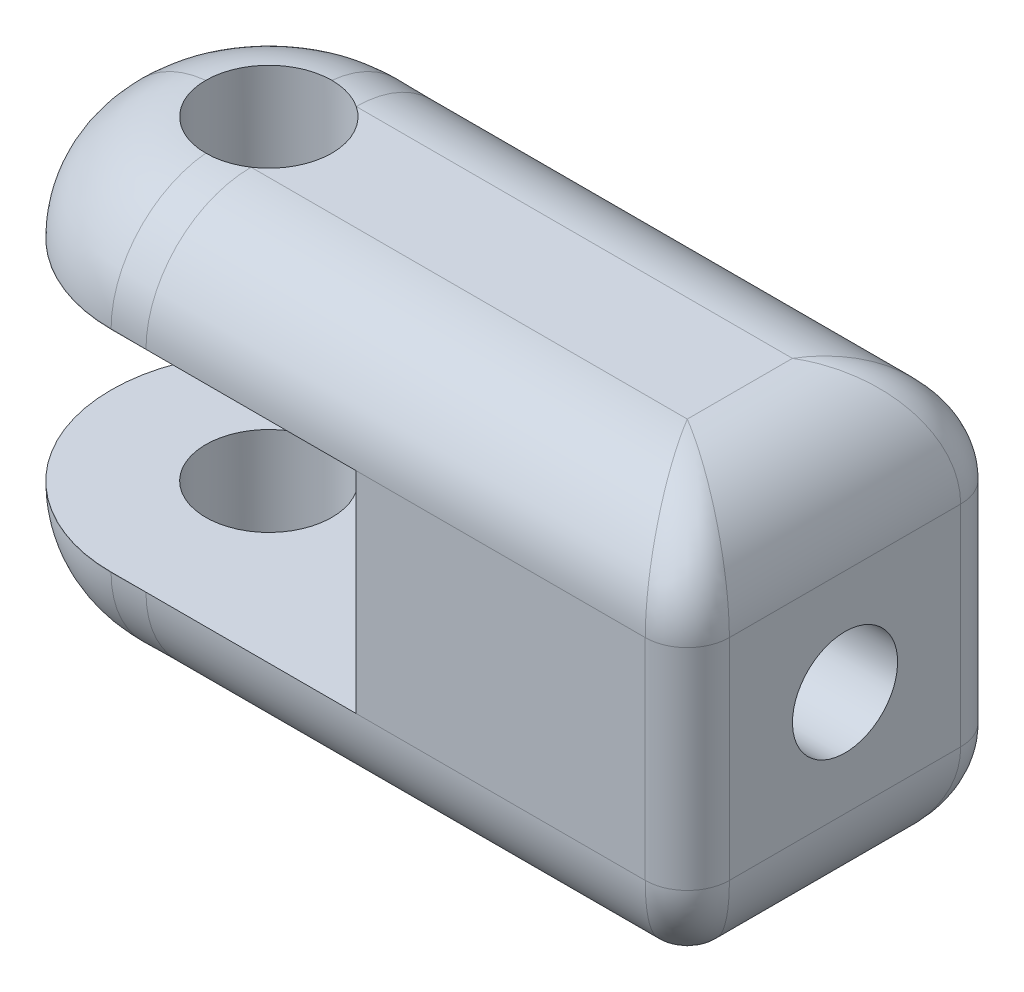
ISO-10303-21;
HEADER;
FILE_DESCRIPTION(('STEP AP214'),'2;1');
FILE_NAME('part.step','',(''),(''),'','','');
FILE_SCHEMA(('AUTOMOTIVE_DESIGN { 1 0 10303 214 1 1 1 1 }'));
ENDSEC;
DATA;
#1=APPLICATION_CONTEXT('core data for automotive mechanical design processes');
#2=APPLICATION_PROTOCOL_DEFINITION('international standard','automotive_design',2000,#1);
#3=PRODUCT_CONTEXT('',#1,'mechanical');
#4=PRODUCT('Part','Part','',(#3));
#5=PRODUCT_RELATED_PRODUCT_CATEGORY('part','',(#4));
#6=PRODUCT_DEFINITION_FORMATION('','',#4);
#7=PRODUCT_DEFINITION_CONTEXT('part definition',#1,'design');
#8=PRODUCT_DEFINITION('design','',#6,#7);
#9=PRODUCT_DEFINITION_SHAPE('','',#8);
#10=(LENGTH_UNIT() NAMED_UNIT(*) SI_UNIT(.MILLI.,.METRE.));
#11=(NAMED_UNIT(*) PLANE_ANGLE_UNIT() SI_UNIT($,.RADIAN.));
#12=(NAMED_UNIT(*) SI_UNIT($,.STERADIAN.) SOLID_ANGLE_UNIT());
#13=UNCERTAINTY_MEASURE_WITH_UNIT(LENGTH_MEASURE(1.E-05),#10,'distance_accuracy_value','');
#14=(GEOMETRIC_REPRESENTATION_CONTEXT(3) GLOBAL_UNCERTAINTY_ASSIGNED_CONTEXT((#13)) GLOBAL_UNIT_ASSIGNED_CONTEXT((#10,
#11,#12)) REPRESENTATION_CONTEXT('',''));
#15=CARTESIAN_POINT('',(0.,0.,0.));
#16=DIRECTION('',(0.,0.,1.));
#17=DIRECTION('',(1.,0.,0.));
#18=AXIS2_PLACEMENT_3D('',#15,#16,#17);
#19=CARTESIAN_POINT('',(-36.1162149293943,1.23740245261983,30.));
#20=DIRECTION('',(0.,0.,1.));
#21=DIRECTION('',(1.,0.,0.));
#22=AXIS2_PLACEMENT_3D('',#19,#20,#21);
#23=PLANE('',#22);
#24=DIRECTION('',(1.,0.,0.));
#25=VECTOR('',#24,1.);
#26=CARTESIAN_POINT('',(23.6842310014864,-18.7625975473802,30.));
#27=LINE('',#26,#25);
#28=CARTESIAN_POINT('',(2.15368473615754,-18.7625975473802,30.));
#29=VERTEX_POINT('',#28);
#30=CARTESIAN_POINT('',(29.6842310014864,-18.7625975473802,30.));
#31=VERTEX_POINT('',#30);
#32=EDGE_CURVE('E451',#29,#31,#27,.T.);
#33=ORIENTED_EDGE('',*,*,#32,.T.);
#34=DIRECTION('',(0.,1.,0.));
#35=VECTOR('',#34,1.);
#36=CARTESIAN_POINT('',(29.6842310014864,1.23740245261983,30.));
#37=LINE('',#36,#35);
#38=CARTESIAN_POINT('',(29.6842310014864,1.23740245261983,30.));
#39=VERTEX_POINT('',#38);
#40=EDGE_CURVE('E11',#31,#39,#37,.T.);
#41=ORIENTED_EDGE('',*,*,#40,.T.);
#42=DIRECTION('',(-1.,0.,0.));
#43=VECTOR('',#42,1.);
#44=CARTESIAN_POINT('',(-21.1162149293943,1.23740245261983,30.));
#45=LINE('',#44,#43);
#46=CARTESIAN_POINT('',(2.15368473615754,1.23740245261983,30.));
#47=VERTEX_POINT('',#46);
#48=EDGE_CURVE('E181',#39,#47,#45,.T.);
#49=ORIENTED_EDGE('',*,*,#48,.T.);
#50=DIRECTION('',(0.,-1.,0.));
#51=VECTOR('',#50,1.);
#52=CARTESIAN_POINT('',(2.15368473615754,1.23740245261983,30.));
#53=LINE('',#52,#51);
#54=EDGE_CURVE('E184',#47,#29,#53,.T.);
#55=ORIENTED_EDGE('',*,*,#54,.T.);
#56=EDGE_LOOP('',(#33,#41,#49,#55));
#57=FACE_BOUND('',#56,.T.);
#58=ADVANCED_FACE('F36',(#57),#23,.T.);
#59=DIRECTION('',(0.,-1.,0.));
#60=VECTOR('',#59,1.);
#61=CARTESIAN_POINT('',(-21.1162149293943,-28.7625975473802,30.));
#62=LINE('',#61,#60);
#63=CARTESIAN_POINT('',(-21.1162149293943,-18.7625975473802,30.));
#64=VERTEX_POINT('',#63);
#65=CARTESIAN_POINT('',(-21.1162149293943,-18.812723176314,30.));
#66=VERTEX_POINT('',#65);
#67=EDGE_CURVE('E238',#64,#66,#62,.T.);
#68=ORIENTED_EDGE('',*,*,#67,.T.);
#69=CARTESIAN_POINT('',(-26.0419651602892,-28.7625975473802,18.4259282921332));
#70=CARTESIAN_POINT('',(-25.6191744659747,-30.5583377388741,30.));
#71=CARTESIAN_POINT('',(-28.3051429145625,-19.1500887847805,30.));
#72=CARTESIAN_POINT('',(-25.9970732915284,-28.7625975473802,18.4903329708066));
#73=CARTESIAN_POINT('',(-25.6239448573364,-30.4802778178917,30.));
#74=CARTESIAN_POINT('',(-28.1044781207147,-19.1028194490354,30.));
#75=CARTESIAN_POINT('',(-25.9482592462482,-28.7625975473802,18.5579483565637));
#76=CARTESIAN_POINT('',(-25.6205698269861,-30.3973873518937,30.));
#77=CARTESIAN_POINT('',(-27.9026709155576,-19.0605566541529,30.));
#78=CARTESIAN_POINT('',(-25.8407081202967,-28.7625975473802,18.6996401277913));
#79=CARTESIAN_POINT('',(-25.5946605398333,-30.2239677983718,30.));
#80=CARTESIAN_POINT('',(-27.4974075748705,-18.98544298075,30.));
#81=CARTESIAN_POINT('',(-25.7819758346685,-28.7625975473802,18.7737133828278));
#82=CARTESIAN_POINT('',(-25.5722998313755,-30.1335611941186,30.));
#83=CARTESIAN_POINT('',(-27.2939522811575,-18.9525875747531,30.));
#84=CARTESIAN_POINT('',(-25.6527741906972,-28.7625975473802,18.9280594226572));
#85=CARTESIAN_POINT('',(-25.5062249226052,-29.9470964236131,30.));
#86=CARTESIAN_POINT('',(-26.8867917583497,-18.8957767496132,30.));
#87=CARTESIAN_POINT('',(-25.5823612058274,-28.7625975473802,19.0083014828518));
#88=CARTESIAN_POINT('',(-25.4628172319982,-29.8511800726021,30.));
#89=CARTESIAN_POINT('',(-26.6830921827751,-18.8717802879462,30.));
#90=CARTESIAN_POINT('',(-25.4270295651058,-28.7625975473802,19.1749104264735));
#91=CARTESIAN_POINT('',(-25.35238290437,-29.6554167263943,30.));
#92=CARTESIAN_POINT('',(-26.2749073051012,-18.8316539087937,30.));
#93=CARTESIAN_POINT('',(-25.3421092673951,-28.7625975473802,19.2612780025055));
#94=CARTESIAN_POINT('',(-25.2855978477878,-29.5556577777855,30.));
#95=CARTESIAN_POINT('',(-26.0704219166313,-18.8155248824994,30.));
#96=CARTESIAN_POINT('',(-25.155171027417,-28.7625975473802,19.438851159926));
#97=CARTESIAN_POINT('',(-25.1266022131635,-29.3551186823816,30.));
#98=CARTESIAN_POINT('',(-25.6616949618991,-18.7901944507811,30.));
#99=CARTESIAN_POINT('',(-25.0532089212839,-28.7625975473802,19.530040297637));
#100=CARTESIAN_POINT('',(-25.0347486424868,-29.2543990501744,30.));
#101=CARTESIAN_POINT('',(-25.4574547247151,-18.7809709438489,30.));
#102=CARTESIAN_POINT('',(-24.8289226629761,-28.7625975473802,19.7156107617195));
#103=CARTESIAN_POINT('',(-24.8239357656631,-29.0547350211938,30.));
#104=CARTESIAN_POINT('',(-25.0488129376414,-18.7682032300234,30.));
#105=CARTESIAN_POINT('',(-24.7065989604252,-28.7625975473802,19.8099920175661));
#106=CARTESIAN_POINT('',(-24.7052559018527,-28.9557925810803,30.));
#107=CARTESIAN_POINT('',(-24.8444113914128,-18.7646588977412,30.));
#108=CARTESIAN_POINT('',(-24.4384894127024,-28.7625975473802,19.9989402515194));
#109=CARTESIAN_POINT('',(-24.439799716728,-28.7632184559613,30.));
#110=CARTESIAN_POINT('',(-24.4353283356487,-18.7619021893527,30.));
#111=CARTESIAN_POINT('',(-24.2926738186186,-28.7625975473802,20.0935073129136));
#112=CARTESIAN_POINT('',(-24.293233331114,-28.6695284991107,30.));
#113=CARTESIAN_POINT('',(-24.2306468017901,-18.7626953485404,30.));
#114=CARTESIAN_POINT('',(-23.9755279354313,-28.7625975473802,20.2780623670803));
#115=CARTESIAN_POINT('',(-23.9724772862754,-28.4917637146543,30.));
#116=CARTESIAN_POINT('',(-23.8213186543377,-18.7671208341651,30.));
#117=CARTESIAN_POINT('',(-23.8041972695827,-28.7625975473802,20.368050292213));
#118=CARTESIAN_POINT('',(-23.7984438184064,-28.407552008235,30.));
#119=CARTESIAN_POINT('',(-23.6166720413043,-18.7707532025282,30.));
#120=CARTESIAN_POINT('',(-23.4365921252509,-28.7625975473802,20.5368264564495));
#121=CARTESIAN_POINT('',(-23.4258606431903,-28.2536292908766,30.));
#122=CARTESIAN_POINT('',(-23.2085281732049,-18.7792451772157,30.));
#123=CARTESIAN_POINT('',(-23.2404593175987,-28.7625975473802,20.6156733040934));
#124=CARTESIAN_POINT('',(-23.2274547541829,-28.1836480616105,30.));
#125=CARTESIAN_POINT('',(-23.0050307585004,-18.7840979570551,30.));
#126=CARTESIAN_POINT('',(-22.8248548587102,-28.7625975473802,20.7557381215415));
#127=CARTESIAN_POINT('',(-22.809565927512,-28.0619029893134,30.));
#128=CARTESIAN_POINT('',(-22.5980310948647,-18.793527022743,30.));
#129=CARTESIAN_POINT('',(-22.6053834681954,-28.7625975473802,20.8169562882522));
#130=CARTESIAN_POINT('',(-22.5898643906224,-28.0099165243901,30.));
#131=CARTESIAN_POINT('',(-22.3945288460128,-18.7981033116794,30.));
#132=CARTESIAN_POINT('',(-22.1490963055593,-28.7625975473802,20.9150198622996));
#133=CARTESIAN_POINT('',(-22.1359661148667,-27.9277865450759,30.));
#134=CARTESIAN_POINT('',(-21.987624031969,-18.8057055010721,30.));
#135=CARTESIAN_POINT('',(-21.9122918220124,-28.7625975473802,20.9518809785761));
#136=CARTESIAN_POINT('',(-21.9013327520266,-27.8974384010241,30.));
#137=CARTESIAN_POINT('',(-21.7842214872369,-18.8087324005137,30.));
#138=CARTESIAN_POINT('',(-21.4303804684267,-28.7625975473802,20.9966487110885));
#139=CARTESIAN_POINT('',(-21.4257510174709,-27.8607693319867,30.));
#140=CARTESIAN_POINT('',(-21.3773958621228,-18.8124316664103,30.));
#141=CARTESIAN_POINT('',(-21.1852737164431,-28.7625975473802,21.0045557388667));
#142=CARTESIAN_POINT('',(-21.1841881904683,-27.8543507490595,30.));
#143=CARTESIAN_POINT('',(-21.1739727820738,-18.8131040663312,30.));
#144=CARTESIAN_POINT('',(-20.6974006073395,-28.7625975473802,20.9903461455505));
#145=CARTESIAN_POINT('',(-20.7036066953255,-27.8659344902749,30.));
#146=CARTESIAN_POINT('',(-20.7668702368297,-18.8119155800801,30.));
#147=CARTESIAN_POINT('',(-20.4546377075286,-28.7625975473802,20.9681904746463));
#148=CARTESIAN_POINT('',(-20.4639359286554,-27.884000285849,30.));
#149=CARTESIAN_POINT('',(-20.5631907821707,-18.8100513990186,30.));
#150=CARTESIAN_POINT('',(-19.9821819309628,-28.7625975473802,20.8967066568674));
#151=CARTESIAN_POINT('',(-19.9961909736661,-27.9430572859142,30.));
#152=CARTESIAN_POINT('',(-20.1558587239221,-18.8042797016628,30.));
#153=CARTESIAN_POINT('',(-19.7524893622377,-28.7625975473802,20.8473778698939));
#154=CARTESIAN_POINT('',(-19.7675682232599,-27.9841983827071,30.));
#155=CARTESIAN_POINT('',(-19.952206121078,-18.8003721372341,30.));
#156=CARTESIAN_POINT('',(-19.3138204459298,-28.7625975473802,20.7274086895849));
#157=CARTESIAN_POINT('',(-19.3289641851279,-28.0863130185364,30.));
#158=CARTESIAN_POINT('',(-19.544864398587,-18.7915720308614,30.));
#159=CARTESIAN_POINT('',(-19.1048502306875,-28.7625975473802,20.6567620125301));
#160=CARTESIAN_POINT('',(-19.1186474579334,-28.1475071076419,30.));
#161=CARTESIAN_POINT('',(-19.3411752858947,-18.7866791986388,30.));
#162=CARTESIAN_POINT('',(-18.7118351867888,-28.7625975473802,20.5012486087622));
#163=CARTESIAN_POINT('',(-18.7216612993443,-28.2856891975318,30.));
#164=CARTESIAN_POINT('',(-18.9337888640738,-18.7773287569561,30.));
#165=CARTESIAN_POINT('',(-18.5277899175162,-28.7625975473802,20.4163821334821));
#166=CARTESIAN_POINT('',(-18.5348811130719,-28.362893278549,30.));
#167=CARTESIAN_POINT('',(-18.7300915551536,-18.7728711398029,30.));
#168=CARTESIAN_POINT('',(-18.2775484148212,-28.7625975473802,20.2867675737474));
#169=CARTESIAN_POINT('',(-18.2816454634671,-28.4838850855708,30.));
#170=CARTESIAN_POINT('',(-18.4322622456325,-18.7678122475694,30.));
#171=CARTESIAN_POINT('',(-18.2012212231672,-28.7625975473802,20.2450005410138));
#172=CARTESIAN_POINT('',(-18.2042605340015,-28.5234592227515,30.));
#173=CARTESIAN_POINT('',(-18.33814447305,-18.7664265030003,30.));
#174=CARTESIAN_POINT('',(-18.0539478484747,-28.7625975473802,20.1603996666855));
#175=CARTESIAN_POINT('',(-18.0552262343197,-28.6046667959,30.));
#176=CARTESIAN_POINT('',(-18.1499020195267,-18.7642338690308,30.));
#177=CARTESIAN_POINT('',(-17.9830016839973,-28.7625975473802,20.1175658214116));
#178=CARTESIAN_POINT('',(-17.9835910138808,-28.6463141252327,30.));
#179=CARTESIAN_POINT('',(-18.0557773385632,-18.7634269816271,30.));
#180=CARTESIAN_POINT('',(-17.7780278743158,-28.7625975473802,19.9882516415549));
#181=CARTESIAN_POINT('',(-17.7770069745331,-28.773987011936,30.));
#182=CARTESIAN_POINT('',(-17.7734117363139,-18.7621014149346,30.));
#183=CARTESIAN_POINT('',(-17.6518510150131,-28.7625975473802,19.9009512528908));
#184=CARTESIAN_POINT('',(-17.6513670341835,-28.8622680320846,30.));
#185=CARTESIAN_POINT('',(-17.585162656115,-18.7626774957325,30.));
#186=CARTESIAN_POINT('',(-17.4186826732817,-28.7625975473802,19.7275088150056));
#187=CARTESIAN_POINT('',(-17.4233905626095,-29.0421931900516,30.));
#188=CARTESIAN_POINT('',(-17.2090100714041,-18.7678787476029,30.));
#189=CARTESIAN_POINT('',(-17.3116612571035,-28.7625975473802,19.6413651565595));
#190=CARTESIAN_POINT('',(-17.3212198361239,-29.1338655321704,30.));
#191=CARTESIAN_POINT('',(-17.0211064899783,-18.7724975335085,30.));
#192=CARTESIAN_POINT('',(-17.1142041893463,-28.7625975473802,19.4722264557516));
#193=CARTESIAN_POINT('',(-17.139052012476,-29.3180802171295,30.));
#194=CARTESIAN_POINT('',(-16.6454749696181,-18.786782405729,30.));
#195=CARTESIAN_POINT('',(-17.0237692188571,-28.7625975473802,19.3892315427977));
#196=CARTESIAN_POINT('',(-17.0592733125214,-29.4106106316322,30.));
#197=CARTESIAN_POINT('',(-16.4577470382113,-18.7964486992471,30.));
#198=CARTESIAN_POINT('',(-16.8569738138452,-28.7625975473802,19.2275733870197));
#199=CARTESIAN_POINT('',(-16.9204740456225,-29.5944383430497,30.));
#200=CARTESIAN_POINT('',(-16.0823584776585,-18.8217259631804,30.));
#201=CARTESIAN_POINT('',(-16.7806378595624,-28.7625975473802,19.1489178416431));
#202=CARTESIAN_POINT('',(-16.8616997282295,-29.6856855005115,30.));
#203=CARTESIAN_POINT('',(-15.8946985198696,-18.8373471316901,30.));
#204=CARTESIAN_POINT('',(-16.6400247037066,-28.7625975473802,18.9968023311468));
#205=CARTESIAN_POINT('',(-16.7635305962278,-29.864873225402,30.));
#206=CARTESIAN_POINT('',(-15.5200662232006,-18.875275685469,30.));
#207=CARTESIAN_POINT('',(-16.5757463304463,-28.7625975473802,18.9233418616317));
#208=CARTESIAN_POINT('',(-16.7243206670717,-29.952744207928,30.));
#209=CARTESIAN_POINT('',(-15.3330938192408,-18.8975824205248,30.));
#210=CARTESIAN_POINT('',(-16.4569184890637,-28.7625975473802,18.7814828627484));
#211=CARTESIAN_POINT('',(-16.6633662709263,-30.1241002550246,30.));
#212=CARTESIAN_POINT('',(-14.9590709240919,-18.9496597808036,30.));
#213=CARTESIAN_POINT('',(-16.4024278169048,-28.7625975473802,18.7131162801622));
#214=CARTESIAN_POINT('',(-16.641886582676,-30.2074672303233,30.));
#215=CARTESIAN_POINT('',(-14.7720263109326,-18.9794730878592,30.));
#216=CARTESIAN_POINT('',(-16.3019675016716,-28.7625975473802,18.581851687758));
#217=CARTESIAN_POINT('',(-16.6149992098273,-30.3680492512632,30.));
#218=CARTESIAN_POINT('',(-14.399298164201,-19.0469986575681,30.));
#219=CARTESIAN_POINT('',(-16.2560011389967,-28.7625975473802,18.5189557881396));
#220=CARTESIAN_POINT('',(-16.6097282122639,-30.4451699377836,30.));
#221=CARTESIAN_POINT('',(-14.2136151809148,-19.0847139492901,30.));
#222=CARTESIAN_POINT('',(-16.2134817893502,-28.7625975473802,18.4587870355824));
#223=CARTESIAN_POINT('',(-16.6115262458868,-30.5182977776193,30.));
#224=CARTESIAN_POINT('',(-14.0288561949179,-19.1266194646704,30.));
#225=(BOUNDED_SURFACE() B_SPLINE_SURFACE(3,2,((#69,#70,#71),(#72,#73,#74),(#75,#76,#77),(#78,
#79,#80),(#81,#82,#83),(#84,#85,#86),(#87,#88,#89),(#90,#91,#92),(#93,#94,#95),(#96,#97,#98),
(#99,#100,#101),(#102,#103,#104),(#105,#106,#107),(#108,#109,#110),(#111,#112,#113),(#114,#115,
#116),(#117,#118,#119),(#120,#121,#122),(#123,#124,#125),(#126,#127,#128),(#129,#130,#131),
(#132,#133,#134),(#135,#136,#137),(#138,#139,#140),(#141,#142,#143),(#144,#145,#146),(#147,#148,
#149),(#150,#151,#152),(#153,#154,#155),(#156,#157,#158),(#159,#160,#161),(#162,#163,#164),
(#165,#166,#167),(#168,#169,#170),(#171,#172,#173),(#174,#175,#176),(#177,#178,#179),(#180,#181,
#182),(#183,#184,#185),(#186,#187,#188),(#189,#190,#191),(#192,#193,#194),(#195,#196,#197),
(#198,#199,#200),(#201,#202,#203),(#204,#205,#206),(#207,#208,#209),(#210,#211,#212),(#213,#214,
#215),(#216,#217,#218),(#219,#220,#221),(#222,#223,#224)),.UNSPECIFIED.,.F.,.F.,
.F.) B_SPLINE_SURFACE_WITH_KNOTS((4,2,2,2,2,2,2,2,2,2,2,2,2,2,2,2,2,2,2,2,2,2,2,2,2,4),(3,3),
(0.,0.618355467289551,1.23641283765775,1.85156977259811,2.46679637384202,3.08004538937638,
3.69328086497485,4.30729910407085,4.92132641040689,5.53199265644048,6.14265208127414,
6.75291727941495,7.36317380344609,7.97422377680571,8.58528814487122,9.19653280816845,
9.80776666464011,10.0901488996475,10.3725321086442,10.9372487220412,11.5010750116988,
12.0649244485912,12.6297438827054,13.1945084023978,13.7625596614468,14.3308290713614),(0.,1.),
.UNSPECIFIED.) GEOMETRIC_REPRESENTATION_ITEM() RATIONAL_B_SPLINE_SURFACE(((1.,0.649073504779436,
1.),(1.,0.651554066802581,1.),(1.,0.654144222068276,1.),(1.,0.659537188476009,1.),(1.,
0.662339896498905,1.),(1.,0.66814019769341,1.),(1.,0.671136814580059,1.),(1.,0.677314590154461,
1.),(1.,0.680495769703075,1.),(1.,0.686988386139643,1.),(1.,0.690299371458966,1.),(1.,
0.696987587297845,1.),(1.,0.700364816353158,1.),(1.,0.707077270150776,1.),(1.,0.71041243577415,
1.),(1.,0.716877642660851,1.),(1.,0.720007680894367,1.),(1.,0.725844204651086,1.),(1.,
0.728552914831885,1.),(1.,0.733343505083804,1.),(1.,0.735425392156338,1.),(1.,0.738751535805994,
1.),(1.,0.739996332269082,1.),(1.,0.741507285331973,1.),(1.,0.741773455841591,1.),(1.,
0.741294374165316,1.),(1.,0.740547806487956,1.),(1.,0.738130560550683,1.),(1.,0.736459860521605,
1.),(1.,0.732375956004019,1.),(1.,0.729962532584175,1.),(1.,0.724616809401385,1.),(1.,
0.721684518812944,1.),(1.,0.717175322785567,1.),(1.,0.715717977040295,1.),(1.,0.712756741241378,
1.),(1.,0.711252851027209,1.),(1.,0.706697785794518,1.),(1.,0.703602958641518,1.),(1.,
0.697413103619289,1.),(1.,0.69431808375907,1.),(1.,0.688201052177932,1.),(1.,0.685179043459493,
1.),(1.,0.679255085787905,1.),(1.,0.676353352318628,1.),(1.,0.670707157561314,1.),(1.,
0.667962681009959,1.),(1.,0.662632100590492,1.),(1.,0.660047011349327,1.),(1.,0.655056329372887,
1.),(1.,0.652650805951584,1.),(1.,0.650337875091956,1.))) REPRESENTATION_ITEM('') SURFACE());
#226=CARTESIAN_POINT('',(-28.3051429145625,-19.1500887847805,30.));
#227=CARTESIAN_POINT('',(-28.1044781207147,-19.1028194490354,30.));
#228=CARTESIAN_POINT('',(-27.9026709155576,-19.0605566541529,30.));
#229=CARTESIAN_POINT('',(-27.4974075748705,-18.98544298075,30.));
#230=CARTESIAN_POINT('',(-27.2939522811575,-18.9525875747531,30.));
#231=CARTESIAN_POINT('',(-26.8867917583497,-18.8957767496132,30.));
#232=CARTESIAN_POINT('',(-26.6830921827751,-18.8717802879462,30.));
#233=CARTESIAN_POINT('',(-26.2749073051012,-18.8316539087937,30.));
#234=CARTESIAN_POINT('',(-26.0704219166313,-18.8155248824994,30.));
#235=CARTESIAN_POINT('',(-25.6616949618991,-18.7901944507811,30.));
#236=CARTESIAN_POINT('',(-25.4574547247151,-18.7809709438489,30.));
#237=CARTESIAN_POINT('',(-25.0488129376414,-18.7682032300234,30.));
#238=CARTESIAN_POINT('',(-24.8444113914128,-18.7646588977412,30.));
#239=CARTESIAN_POINT('',(-24.4353283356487,-18.7619021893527,30.));
#240=CARTESIAN_POINT('',(-24.2306468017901,-18.7626953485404,30.));
#241=CARTESIAN_POINT('',(-23.8213186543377,-18.7671208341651,30.));
#242=CARTESIAN_POINT('',(-23.6166720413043,-18.7707532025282,30.));
#243=CARTESIAN_POINT('',(-23.2085281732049,-18.7792451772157,30.));
#244=CARTESIAN_POINT('',(-23.0050307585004,-18.7840979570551,30.));
#245=CARTESIAN_POINT('',(-22.5980310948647,-18.793527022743,30.));
#246=CARTESIAN_POINT('',(-22.3945288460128,-18.7981033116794,30.));
#247=CARTESIAN_POINT('',(-21.987624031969,-18.8057055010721,30.));
#248=CARTESIAN_POINT('',(-21.7842214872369,-18.8087324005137,30.));
#249=CARTESIAN_POINT('',(-21.3773958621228,-18.8124316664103,30.));
#250=CARTESIAN_POINT('',(-21.1739727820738,-18.8131040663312,30.));
#251=CARTESIAN_POINT('',(-20.7668702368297,-18.8119155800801,30.));
#252=CARTESIAN_POINT('',(-20.5631907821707,-18.8100513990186,30.));
#253=CARTESIAN_POINT('',(-20.1558587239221,-18.8042797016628,30.));
#254=CARTESIAN_POINT('',(-19.952206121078,-18.8003721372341,30.));
#255=CARTESIAN_POINT('',(-19.544864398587,-18.7915720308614,30.));
#256=CARTESIAN_POINT('',(-19.3411752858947,-18.7866791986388,30.));
#257=CARTESIAN_POINT('',(-18.9337888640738,-18.7773287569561,30.));
#258=CARTESIAN_POINT('',(-18.7300915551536,-18.7728711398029,30.));
#259=CARTESIAN_POINT('',(-18.4322622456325,-18.7678122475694,30.));
#260=CARTESIAN_POINT('',(-18.33814447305,-18.7664265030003,30.));
#261=CARTESIAN_POINT('',(-18.1499020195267,-18.7642338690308,30.));
#262=CARTESIAN_POINT('',(-18.0557773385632,-18.7634269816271,30.));
#263=CARTESIAN_POINT('',(-17.7734117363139,-18.7621014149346,30.));
#264=CARTESIAN_POINT('',(-17.585162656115,-18.7626774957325,30.));
#265=CARTESIAN_POINT('',(-17.2090100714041,-18.7678787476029,30.));
#266=CARTESIAN_POINT('',(-17.0211064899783,-18.7724975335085,30.));
#267=CARTESIAN_POINT('',(-16.6454749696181,-18.786782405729,30.));
#268=CARTESIAN_POINT('',(-16.4577470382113,-18.7964486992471,30.));
#269=CARTESIAN_POINT('',(-16.0823584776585,-18.8217259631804,30.));
#270=CARTESIAN_POINT('',(-15.8946985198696,-18.8373471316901,30.));
#271=CARTESIAN_POINT('',(-15.5200662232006,-18.875275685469,30.));
#272=CARTESIAN_POINT('',(-15.3330938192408,-18.8975824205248,30.));
#273=CARTESIAN_POINT('',(-14.9590709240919,-18.9496597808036,30.));
#274=CARTESIAN_POINT('',(-14.7720263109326,-18.9794730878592,30.));
#275=CARTESIAN_POINT('',(-14.399298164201,-19.0469986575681,30.));
#276=CARTESIAN_POINT('',(-14.2136151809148,-19.0847139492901,30.));
#277=CARTESIAN_POINT('',(-14.0288561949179,-19.1266194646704,30.));
#278=B_SPLINE_CURVE_WITH_KNOTS('',3,(#226,#227,#228,#229,#230,#231,#232,#233,#234,#235,#236,
#237,#238,#239,#240,#241,#242,#243,#244,#245,#246,#247,#248,#249,#250,#251,#252,#253,#254,#255,
#256,#257,#258,#259,#260,#261,#262,#263,#264,#265,#266,#267,#268,#269,#270,#271,#272,#273,#274,
#275,#276,#277),.UNSPECIFIED.,.F.,.F.,(4,2,2,2,2,2,2,2,2,2,2,2,2,2,2,2,2,2,2,2,2,2,2,2,2,4),(0.,
0.618355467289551,1.23641283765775,1.85156977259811,2.46679637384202,3.08004538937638,
3.69328086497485,4.30729910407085,4.92132641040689,5.53199265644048,6.14265208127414,
6.75291727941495,7.36317380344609,7.97422377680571,8.58528814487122,9.19653280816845,
9.80776666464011,10.0901488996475,10.3725321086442,10.9372487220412,11.5010750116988,
12.0649244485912,12.6297438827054,13.1945084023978,13.7625596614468,14.3308290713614),.UNSPECIFIED.);
#279=CARTESIAN_POINT('',(-17.7995901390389,-18.7625975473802,30.));
#280=VERTEX_POINT('',#279);
#281=EDGE_CURVE('E453',#66,#280,#278,.T.);
#282=ORIENTED_EDGE('',*,*,#281,.T.);
#283=DIRECTION('',(-1.,0.,0.));
#284=VECTOR('',#283,1.);
#285=CARTESIAN_POINT('',(-36.1162149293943,-18.7625975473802,30.));
#286=LINE('',#285,#284);
#287=EDGE_CURVE('E211',#280,#64,#286,.T.);
#288=ORIENTED_EDGE('',*,*,#287,.T.);
#289=EDGE_LOOP('',(#68,#282,#288));
#290=FACE_BOUND('',#289,.T.);
#291=ADVANCED_FACE('F395',(#290),#23,.T.);
#292=CARTESIAN_POINT('',(-36.1162149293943,1.23740245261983,0.));
#293=DIRECTION('',(0.,0.,1.));
#294=DIRECTION('',(1.,0.,0.));
#295=AXIS2_PLACEMENT_3D('',#292,#293,#294);
#296=PLANE('',#295);
#297=DIRECTION('',(0.,-1.,0.));
#298=VECTOR('',#297,1.);
#299=CARTESIAN_POINT('',(-21.1162149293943,1.23740245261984,0.));
#300=LINE('',#299,#298);
#301=CARTESIAN_POINT('',(-21.1162149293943,1.23740245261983,0.));
#302=VERTEX_POINT('',#301);
#303=CARTESIAN_POINT('',(-21.1162149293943,1.28752808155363,0.));
#304=VERTEX_POINT('',#303);
#305=EDGE_CURVE('E246',#302,#304,#300,.F.);
#306=ORIENTED_EDGE('',*,*,#305,.T.);
#307=CARTESIAN_POINT('',(-26.0419651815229,11.2374024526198,11.5740717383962));
#308=CARTESIAN_POINT('',(-25.6191744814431,13.033142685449,0.));
#309=CARTESIAN_POINT('',(-28.3051429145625,1.62489369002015,0.));
#310=CARTESIAN_POINT('',(-25.9970732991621,11.2374024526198,11.5096670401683));
#311=CARTESIAN_POINT('',(-25.6239448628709,12.9550827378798,0.));
#312=CARTESIAN_POINT('',(-28.1044781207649,1.5776243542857,0.));
#313=CARTESIAN_POINT('',(-25.948259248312,11.2374024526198,11.4420516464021));
#314=CARTESIAN_POINT('',(-25.6205698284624,12.8721922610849,0.));
#315=CARTESIAN_POINT('',(-27.9026709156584,1.53536155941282,0.));
#316=CARTESIAN_POINT('',(-25.8407081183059,11.2374024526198,11.3003598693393));
#317=CARTESIAN_POINT('',(-25.5946605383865,12.6987726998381,0.));
#318=CARTESIAN_POINT('',(-27.4974075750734,1.46024788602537,0.));
#319=CARTESIAN_POINT('',(-25.7819758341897,11.2374024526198,11.2262866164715));
#320=CARTESIAN_POINT('',(-25.5722998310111,12.6083660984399,0.));
#321=CARTESIAN_POINT('',(-27.293952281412,1.42739248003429,0.));
#322=CARTESIAN_POINT('',(-25.6527741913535,11.2374024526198,11.071940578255));
#323=CARTESIAN_POINT('',(-25.5062249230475,12.4219013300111,0.));
#324=CARTESIAN_POINT('',(-26.8867917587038,1.37058165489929,0.));
#325=CARTESIAN_POINT('',(-25.5823612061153,11.2374024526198,10.991698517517));
#326=CARTESIAN_POINT('',(-25.4628172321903,12.3259849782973,0.));
#327=CARTESIAN_POINT('',(-26.6830921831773,1.3465851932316,0.));
#328=CARTESIAN_POINT('',(-25.4270295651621,11.2374024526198,10.8250895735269));
#329=CARTESIAN_POINT('',(-25.3523829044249,12.1302216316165,0.));
#330=CARTESIAN_POINT('',(-26.2749073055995,1.30645881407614,0.));
#331=CARTESIAN_POINT('',(-25.3421092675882,11.2374024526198,10.73872199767));
#332=CARTESIAN_POINT('',(-25.2855978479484,12.0304626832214,0.));
#333=CARTESIAN_POINT('',(-26.0704219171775,1.29032978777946,0.));
#334=CARTESIAN_POINT('',(-25.1551710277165,11.2374024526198,10.5611488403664));
#335=CARTESIAN_POINT('',(-25.1266022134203,11.8299235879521,0.));
#336=CARTESIAN_POINT('',(-25.6616949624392,1.26499935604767,0.));
#337=CARTESIAN_POINT('',(-25.0532089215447,11.2374024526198,10.4699597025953));
#338=CARTESIAN_POINT('',(-25.0347486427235,11.7292039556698,0.));
#339=CARTESIAN_POINT('',(-25.4574547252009,1.2557758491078,0.));
#340=CARTESIAN_POINT('',(-24.8289226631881,11.2374024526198,10.2843892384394));
#341=CARTESIAN_POINT('',(-24.8239357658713,11.5295399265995,0.));
#342=CARTESIAN_POINT('',(-25.0488129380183,1.24300813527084,0.));
#343=CARTESIAN_POINT('',(-24.7065989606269,11.2374024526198,10.1900079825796));
#344=CARTESIAN_POINT('',(-24.7052559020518,11.4305974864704,0.));
#345=CARTESIAN_POINT('',(-24.8444113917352,1.23946380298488,0.));
#346=CARTESIAN_POINT('',(-24.4384894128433,11.2374024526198,10.0010597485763));
#347=CARTESIAN_POINT('',(-24.4397997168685,11.2380233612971,0.));
#348=CARTESIAN_POINT('',(-24.4353283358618,1.23670709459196,0.));
#349=CARTESIAN_POINT('',(-24.292673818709,11.2374024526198,9.90649268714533));
#350=CARTESIAN_POINT('',(-24.2932333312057,11.1443334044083,0.));
#351=CARTESIAN_POINT('',(-24.2306468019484,1.23750025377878,0.));
#352=CARTESIAN_POINT('',(-23.9755279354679,11.2374024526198,9.7219376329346));
#353=CARTESIAN_POINT('',(-23.9724772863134,10.9665686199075,0.));
#354=CARTESIAN_POINT('',(-23.8213186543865,1.24192573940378,0.));
#355=CARTESIAN_POINT('',(-23.8041972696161,11.2374024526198,9.63194970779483));
#356=CARTESIAN_POINT('',(-23.7984438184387,10.8823569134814,0.));
#357=CARTESIAN_POINT('',(-23.6166720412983,1.24555810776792,0.));
#358=CARTESIAN_POINT('',(-23.4365921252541,11.2374024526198,9.46317354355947));
#359=CARTESIAN_POINT('',(-23.4258606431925,10.7284341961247,0.));
#360=CARTESIAN_POINT('',(-23.2085281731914,1.2540500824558,0.));
#361=CARTESIAN_POINT('',(-23.2404593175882,11.2374024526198,9.3843266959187));
#362=CARTESIAN_POINT('',(-23.227454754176,10.6584529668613,0.));
#363=CARTESIAN_POINT('',(-23.0050307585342,1.25890286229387,0.));
#364=CARTESIAN_POINT('',(-22.8248548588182,11.2374024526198,9.24426187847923));
#365=CARTESIAN_POINT('',(-22.8095659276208,10.5367078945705,0.));
#366=CARTESIAN_POINT('',(-22.598031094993,1.26833192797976,0.));
#367=CARTESIAN_POINT('',(-22.6053834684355,11.2374024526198,9.18304371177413));
#368=CARTESIAN_POINT('',(-22.589864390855,10.4847214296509,0.));
#369=CARTESIAN_POINT('',(-22.3945288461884,1.27290821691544,0.));
#370=CARTESIAN_POINT('',(-22.1490963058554,11.2374024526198,9.08498013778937));
#371=CARTESIAN_POINT('',(-22.1359661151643,10.4025914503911,0.));
#372=CARTESIAN_POINT('',(-21.9876240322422,1.28051040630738,0.));
#373=CARTESIAN_POINT('',(-21.9122918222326,11.2374024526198,9.04811902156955));
#374=CARTESIAN_POINT('',(-21.9013327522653,10.3722433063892,0.));
#375=CARTESIAN_POINT('',(-21.7842214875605,1.28353730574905,0.));
#376=CARTESIAN_POINT('',(-21.4303804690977,11.2374024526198,9.00335128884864));
#377=CARTESIAN_POINT('',(-21.4257510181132,10.3355742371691,0.));
#378=CARTESIAN_POINT('',(-21.3773958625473,1.28723657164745,0.));
#379=CARTESIAN_POINT('',(-21.1852737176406,11.2374024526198,8.99544426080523));
#380=CARTESIAN_POINT('',(-21.1841881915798,10.3291556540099,0.));
#381=CARTESIAN_POINT('',(-21.1739727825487,1.28790897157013,0.));
#382=CARTESIAN_POINT('',(-20.6974006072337,11.2374024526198,9.0096538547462));
#383=CARTESIAN_POINT('',(-20.703606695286,10.3407393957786,0.));
#384=CARTESIAN_POINT('',(-20.7668702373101,1.28672048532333,0.));
#385=CARTESIAN_POINT('',(-20.4546377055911,11.2374024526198,9.031809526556));
#386=CARTESIAN_POINT('',(-20.4639359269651,10.3588051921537,0.));
#387=CARTESIAN_POINT('',(-20.5631907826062,1.28485630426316,0.));
#388=CARTESIAN_POINT('',(-19.982181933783,11.2374024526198,9.10329334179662));
#389=CARTESIAN_POINT('',(-19.996190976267,10.4178621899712,0.));
#390=CARTESIAN_POINT('',(-20.1558587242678,1.2790846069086,0.));
#391=CARTESIAN_POINT('',(-19.7524893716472,11.2374024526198,9.15262212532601));
#392=CARTESIAN_POINT('',(-19.7675682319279,10.459003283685,0.));
#393=CARTESIAN_POINT('',(-19.9522061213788,1.27517704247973,0.));
#394=CARTESIAN_POINT('',(-19.31382043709,11.2374024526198,9.27259131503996));
#395=CARTESIAN_POINT('',(-19.3289641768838,10.5611179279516,0.));
#396=CARTESIAN_POINT('',(-19.5448643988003,1.26637693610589,0.));
#397=CARTESIAN_POINT('',(-19.1048501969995,11.2374024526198,9.34323800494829));
#398=CARTESIAN_POINT('',(-19.1186474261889,10.6223120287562,0.));
#399=CARTESIAN_POINT('',(-19.3411752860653,1.26148410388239,0.));
#400=CARTESIAN_POINT('',(-18.7118352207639,11.2374024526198,9.49875137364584));
#401=CARTESIAN_POINT('',(-18.721661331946,10.760494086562,0.));
#402=CARTESIAN_POINT('',(-18.933788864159,1.25213366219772,0.));
#403=CARTESIAN_POINT('',(-18.5277900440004,11.2374024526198,9.58361780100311));
#404=CARTESIAN_POINT('',(-18.5348812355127,10.8376981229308,0.));
#405=CARTESIAN_POINT('',(-18.7300915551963,1.24767604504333,0.));
#406=CARTESIAN_POINT('',(-18.2775484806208,11.2374024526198,9.71323239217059));
#407=CARTESIAN_POINT('',(-18.2816455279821,10.958689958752,0.));
#408=CARTESIAN_POINT('',(-18.4322622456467,1.24261715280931,0.));
#409=CARTESIAN_POINT('',(-18.2012212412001,11.2374024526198,9.75499944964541));
#410=CARTESIAN_POINT('',(-18.2042605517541,10.9982641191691,0.));
#411=CARTESIAN_POINT('',(-18.3381444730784,1.24123140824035,0.));
#412=CARTESIAN_POINT('',(-18.0539478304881,11.2374024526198,9.83960034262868));
#413=CARTESIAN_POINT('',(-18.055226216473,11.0794717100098,0.));
#414=CARTESIAN_POINT('',(-18.1499020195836,1.23903877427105,0.));
#415=CARTESIAN_POINT('',(-17.9830016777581,11.2374024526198,9.88243418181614));
#416=CARTESIAN_POINT('',(-17.9835910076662,11.1211190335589,0.));
#417=CARTESIAN_POINT('',(-18.0557773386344,1.23823188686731,0.));
#418=CARTESIAN_POINT('',(-17.7780278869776,11.2374024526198,10.0117483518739));
#419=CARTESIAN_POINT('',(-17.777006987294,11.2487919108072,0.));
#420=CARTESIAN_POINT('',(-17.7734117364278,1.23690632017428,0.));
#421=CARTESIAN_POINT('',(-17.6518510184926,11.2374024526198,10.0990487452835));
#422=CARTESIAN_POINT('',(-17.6513670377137,11.3370729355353,0.));
#423=CARTESIAN_POINT('',(-17.5851626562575,1.23748240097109,0.));
#424=CARTESIAN_POINT('',(-17.4186826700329,11.2374024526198,10.2724911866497));
#425=CARTESIAN_POINT('',(-17.4233905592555,11.5169980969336,0.));
#426=CARTESIAN_POINT('',(-17.2090100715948,1.24268365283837,0.));
#427=CARTESIAN_POINT('',(-17.3116612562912,11.2374024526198,10.3586348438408));
#428=CARTESIAN_POINT('',(-17.3212198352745,11.6086704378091,0.));
#429=CARTESIAN_POINT('',(-17.0211064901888,1.24730243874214,0.));
#430=CARTESIAN_POINT('',(-17.1142041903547,11.2374024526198,10.5277735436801));
#431=CARTESIAN_POINT('',(-17.139052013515,11.7928851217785,0.));
#432=CARTESIAN_POINT('',(-16.6454749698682,1.26158731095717,0.));
#433=CARTESIAN_POINT('',(-17.0237692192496,11.2374024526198,10.6107684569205));
#434=CARTESIAN_POINT('',(-17.0592733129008,11.8854155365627,0.));
#435=CARTESIAN_POINT('',(-16.457747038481,1.27125360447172,0.));
#436=CARTESIAN_POINT('',(-16.8569738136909,11.2374024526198,10.772426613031));
#437=CARTESIAN_POINT('',(-16.9204740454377,12.069243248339,0.));
#438=CARTESIAN_POINT('',(-16.0823584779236,1.2965308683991,0.));
#439=CARTESIAN_POINT('',(-16.7806378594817,11.2374024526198,10.8510821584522));
#440=CARTESIAN_POINT('',(-16.8616997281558,12.1604904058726,0.));
#441=CARTESIAN_POINT('',(-15.8946985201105,1.31215203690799,0.));
#442=CARTESIAN_POINT('',(-16.640024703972,11.2374024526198,11.0031976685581));
#443=CARTESIAN_POINT('',(-16.7635305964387,12.3396781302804,0.));
#444=CARTESIAN_POINT('',(-15.5200662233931,1.35008059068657,0.));
#445=CARTESIAN_POINT('',(-16.575746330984,11.2374024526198,11.0766581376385));
#446=CARTESIAN_POINT('',(-16.724320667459,12.4275491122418,0.));
#447=CARTESIAN_POINT('',(-15.3330938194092,1.37238732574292,0.));
#448=CARTESIAN_POINT('',(-16.4569184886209,11.2374024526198,11.2185171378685));
#449=CARTESIAN_POINT('',(-16.6633662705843,12.5989051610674,0.));
#450=CARTESIAN_POINT('',(-14.9590709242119,1.42446468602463,0.));
#451=CARTESIAN_POINT('',(-16.4024278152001,11.2374024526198,11.2868837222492));
#452=CARTESIAN_POINT('',(-16.641886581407,12.6822721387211,0.));
#453=CARTESIAN_POINT('',(-14.7720263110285,1.45427799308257,0.));
#454=CARTESIAN_POINT('',(-16.3019675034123,11.2374024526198,11.4181483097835));
#455=CARTESIAN_POINT('',(-16.6149992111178,12.8428541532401,0.));
#456=CARTESIAN_POINT('',(-14.3992981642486,1.52180356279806,0.));
#457=CARTESIAN_POINT('',(-16.2560011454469,11.2374024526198,11.4810442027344));
#458=CARTESIAN_POINT('',(-16.6097282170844,12.9199748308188,0.));
#459=CARTESIAN_POINT('',(-14.2136151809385,1.55951885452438,0.));
#460=CARTESIAN_POINT('',(-16.2134818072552,11.2374024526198,11.5412129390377));
#461=CARTESIAN_POINT('',(-16.6115262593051,12.9931026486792,0.));
#462=CARTESIAN_POINT('',(-14.0288561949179,1.60142436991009,0.));
#463=(BOUNDED_SURFACE() B_SPLINE_SURFACE(3,2,((#307,#308,#309),(#310,#311,#312),(#313,#314,
#315),(#316,#317,#318),(#319,#320,#321),(#322,#323,#324),(#325,#326,#327),(#328,#329,#330),
(#331,#332,#333),(#334,#335,#336),(#337,#338,#339),(#340,#341,#342),(#343,#344,#345),(#346,#347,
#348),(#349,#350,#351),(#352,#353,#354),(#355,#356,#357),(#358,#359,#360),(#361,#362,#363),
(#364,#365,#366),(#367,#368,#369),(#370,#371,#372),(#373,#374,#375),(#376,#377,#378),(#379,#380,
#381),(#382,#383,#384),(#385,#386,#387),(#388,#389,#390),(#391,#392,#393),(#394,#395,#396),
(#397,#398,#399),(#400,#401,#402),(#403,#404,#405),(#406,#407,#408),(#409,#410,#411),(#412,#413,
#414),(#415,#416,#417),(#418,#419,#420),(#421,#422,#423),(#424,#425,#426),(#427,#428,#429),
(#430,#431,#432),(#433,#434,#435),(#436,#437,#438),(#439,#440,#441),(#442,#443,#444),(#445,#446,
#447),(#448,#449,#450),(#451,#452,#453),(#454,#455,#456),(#457,#458,#459),(#460,#461,#462)),
.UNSPECIFIED.,.F.,.F.,.F.) B_SPLINE_SURFACE_WITH_KNOTS((4,2,2,2,2,2,2,2,2,2,2,2,2,2,2,2,2,2,2,2,
2,2,2,2,2,4),(3,3),(0.,0.618355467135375,1.23641283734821,1.85156977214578,2.46679637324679,
3.08004538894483,3.69328086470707,4.30729910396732,4.92132641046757,5.53199265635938,
6.14265208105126,6.75291727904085,7.36317380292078,7.97422377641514,8.58528814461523,
9.19653280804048,9.80776666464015,10.0901488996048,10.3725321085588,10.9372487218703,
11.5010750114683,12.0649244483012,12.6297438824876,13.194508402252,13.7625596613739,
14.3308290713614),(0.,1.),
.UNSPECIFIED.) GEOMETRIC_REPRESENTATION_ITEM() RATIONAL_B_SPLINE_SURFACE(((1.,0.649073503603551,
1.),(1.,0.651554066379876,1.),(1.,0.654144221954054,1.),(1.,0.659537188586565,1.),(1.,
0.662339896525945,1.),(1.,0.668140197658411,1.),(1.,0.671136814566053,1.),(1.,0.67731459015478,
1.),(1.,0.680495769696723,1.),(1.,0.686988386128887,1.),(1.,0.690299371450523,1.),(1.,
0.696987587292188,1.),(1.,0.700364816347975,1.),(1.,0.707077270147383,1.),(1.,0.710412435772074,
1.),(1.,0.71687764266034,1.),(1.,0.720007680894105,1.),(1.,0.725844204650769,1.),(1.,
0.728552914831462,1.),(1.,0.733343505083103,1.),(1.,0.735425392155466,1.),(1.,0.738751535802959,
1.),(1.,0.73999633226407,1.),(1.,0.74150728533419,1.),(1.,0.741773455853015,1.),(1.,
0.74129437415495,1.),(1.,0.740547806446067,1.),(1.,0.738130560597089,1.),(1.,0.736459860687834,
1.),(1.,0.732375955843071,1.),(1.,0.729962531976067,1.),(1.,0.724616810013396,1.),(1.,
0.721684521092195,1.),(1.,0.717175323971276,1.),(1.,0.71571797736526,1.),(1.,0.712756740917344,
1.),(1.,0.711252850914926,1.),(1.,0.706697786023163,1.),(1.,0.703602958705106,1.),(1.,
0.697413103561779,1.),(1.,0.69431808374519,1.),(1.,0.688201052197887,1.),(1.,0.685179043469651,
1.),(1.,0.679255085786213,1.),(1.,0.676353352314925,1.),(1.,0.670707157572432,1.),(1.,
0.667962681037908,1.),(1.,0.662632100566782,1.),(1.,0.66004701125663,1.),(1.,0.655056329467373,
1.),(1.,0.652650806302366,1.),(1.,0.650337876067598,1.))) REPRESENTATION_ITEM('') SURFACE());
#464=CARTESIAN_POINT('',(-28.3051429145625,1.62489369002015,0.));
#465=CARTESIAN_POINT('',(-28.1044781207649,1.5776243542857,0.));
#466=CARTESIAN_POINT('',(-27.9026709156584,1.53536155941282,0.));
#467=CARTESIAN_POINT('',(-27.4974075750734,1.46024788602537,0.));
#468=CARTESIAN_POINT('',(-27.293952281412,1.42739248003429,0.));
#469=CARTESIAN_POINT('',(-26.8867917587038,1.37058165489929,0.));
#470=CARTESIAN_POINT('',(-26.6830921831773,1.3465851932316,0.));
#471=CARTESIAN_POINT('',(-26.2749073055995,1.30645881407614,0.));
#472=CARTESIAN_POINT('',(-26.0704219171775,1.29032978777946,0.));
#473=CARTESIAN_POINT('',(-25.6616949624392,1.26499935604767,0.));
#474=CARTESIAN_POINT('',(-25.4574547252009,1.2557758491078,0.));
#475=CARTESIAN_POINT('',(-25.0488129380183,1.24300813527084,0.));
#476=CARTESIAN_POINT('',(-24.8444113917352,1.23946380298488,0.));
#477=CARTESIAN_POINT('',(-24.4353283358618,1.23670709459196,0.));
#478=CARTESIAN_POINT('',(-24.2306468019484,1.23750025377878,0.));
#479=CARTESIAN_POINT('',(-23.8213186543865,1.24192573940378,0.));
#480=CARTESIAN_POINT('',(-23.6166720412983,1.24555810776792,0.));
#481=CARTESIAN_POINT('',(-23.2085281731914,1.2540500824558,0.));
#482=CARTESIAN_POINT('',(-23.0050307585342,1.25890286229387,0.));
#483=CARTESIAN_POINT('',(-22.598031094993,1.26833192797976,0.));
#484=CARTESIAN_POINT('',(-22.3945288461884,1.27290821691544,0.));
#485=CARTESIAN_POINT('',(-21.9876240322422,1.28051040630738,0.));
#486=CARTESIAN_POINT('',(-21.7842214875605,1.28353730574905,0.));
#487=CARTESIAN_POINT('',(-21.3773958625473,1.28723657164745,0.));
#488=CARTESIAN_POINT('',(-21.1739727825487,1.28790897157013,0.));
#489=CARTESIAN_POINT('',(-20.7668702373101,1.28672048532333,0.));
#490=CARTESIAN_POINT('',(-20.5631907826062,1.28485630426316,0.));
#491=CARTESIAN_POINT('',(-20.1558587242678,1.2790846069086,0.));
#492=CARTESIAN_POINT('',(-19.9522061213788,1.27517704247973,0.));
#493=CARTESIAN_POINT('',(-19.5448643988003,1.26637693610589,0.));
#494=CARTESIAN_POINT('',(-19.3411752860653,1.26148410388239,0.));
#495=CARTESIAN_POINT('',(-18.933788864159,1.25213366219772,0.));
#496=CARTESIAN_POINT('',(-18.7300915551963,1.24767604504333,0.));
#497=CARTESIAN_POINT('',(-18.4322622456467,1.24261715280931,0.));
#498=CARTESIAN_POINT('',(-18.3381444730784,1.24123140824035,0.));
#499=CARTESIAN_POINT('',(-18.1499020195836,1.23903877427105,0.));
#500=CARTESIAN_POINT('',(-18.0557773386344,1.23823188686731,0.));
#501=CARTESIAN_POINT('',(-17.7734117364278,1.23690632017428,0.));
#502=CARTESIAN_POINT('',(-17.5851626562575,1.23748240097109,0.));
#503=CARTESIAN_POINT('',(-17.2090100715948,1.24268365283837,0.));
#504=CARTESIAN_POINT('',(-17.0211064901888,1.24730243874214,0.));
#505=CARTESIAN_POINT('',(-16.6454749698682,1.26158731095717,0.));
#506=CARTESIAN_POINT('',(-16.457747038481,1.27125360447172,0.));
#507=CARTESIAN_POINT('',(-16.0823584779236,1.2965308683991,0.));
#508=CARTESIAN_POINT('',(-15.8946985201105,1.31215203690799,0.));
#509=CARTESIAN_POINT('',(-15.5200662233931,1.35008059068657,0.));
#510=CARTESIAN_POINT('',(-15.3330938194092,1.37238732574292,0.));
#511=CARTESIAN_POINT('',(-14.9590709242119,1.42446468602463,0.));
#512=CARTESIAN_POINT('',(-14.7720263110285,1.45427799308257,0.));
#513=CARTESIAN_POINT('',(-14.3992981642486,1.52180356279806,0.));
#514=CARTESIAN_POINT('',(-14.2136151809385,1.55951885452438,0.));
#515=CARTESIAN_POINT('',(-14.0288561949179,1.60142436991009,0.));
#516=B_SPLINE_CURVE_WITH_KNOTS('',3,(#464,#465,#466,#467,#468,#469,#470,#471,#472,#473,#474,
#475,#476,#477,#478,#479,#480,#481,#482,#483,#484,#485,#486,#487,#488,#489,#490,#491,#492,#493,
#494,#495,#496,#497,#498,#499,#500,#501,#502,#503,#504,#505,#506,#507,#508,#509,#510,#511,#512,
#513,#514,#515),.UNSPECIFIED.,.F.,.F.,(4,2,2,2,2,2,2,2,2,2,2,2,2,2,2,2,2,2,2,2,2,2,2,2,2,4),(0.,
0.618355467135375,1.23641283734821,1.85156977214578,2.46679637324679,3.08004538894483,
3.69328086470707,4.30729910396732,4.92132641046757,5.53199265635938,6.14265208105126,
6.75291727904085,7.36317380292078,7.97422377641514,8.58528814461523,9.19653280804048,
9.80776666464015,10.0901488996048,10.3725321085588,10.9372487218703,11.5010750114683,
12.0649244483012,12.6297438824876,13.194508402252,13.7625596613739,14.3308290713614),.UNSPECIFIED.);
#517=CARTESIAN_POINT('',(-17.7995901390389,1.23740245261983,0.));
#518=VERTEX_POINT('',#517);
#519=EDGE_CURVE('E431',#304,#518,#516,.T.);
#520=ORIENTED_EDGE('',*,*,#519,.T.);
#521=DIRECTION('',(1.,0.,0.));
#522=VECTOR('',#521,1.);
#523=CARTESIAN_POINT('',(-36.1162149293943,1.23740245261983,0.));
#524=LINE('',#523,#522);
#525=EDGE_CURVE('E232',#302,#518,#524,.T.);
#526=ORIENTED_EDGE('',*,*,#525,.F.);
#527=EDGE_LOOP('',(#306,#520,#526));
#528=FACE_BOUND('',#527,.T.);
#529=ADVANCED_FACE('F400',(#528),#296,.F.);
#530=DIRECTION('',(-1.,0.,0.));
#531=VECTOR('',#530,1.);
#532=CARTESIAN_POINT('',(-36.1162149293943,1.23740245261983,0.));
#533=LINE('',#532,#531);
#534=CARTESIAN_POINT('',(2.15368473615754,1.23740245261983,0.));
#535=VERTEX_POINT('',#534);
#536=CARTESIAN_POINT('',(29.6842310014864,1.23740245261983,0.));
#537=VERTEX_POINT('',#536);
#538=EDGE_CURVE('E436',#535,#537,#533,.F.);
#539=ORIENTED_EDGE('',*,*,#538,.T.);
#540=DIRECTION('',(0.,1.,0.));
#541=VECTOR('',#540,1.);
#542=CARTESIAN_POINT('',(29.6842310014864,1.23740245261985,0.));
#543=LINE('',#542,#541);
#544=CARTESIAN_POINT('',(29.6842310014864,-18.7625975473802,0.));
#545=VERTEX_POINT('',#544);
#546=EDGE_CURVE('E49',#537,#545,#543,.F.);
#547=ORIENTED_EDGE('',*,*,#546,.T.);
#548=DIRECTION('',(1.,0.,0.));
#549=VECTOR('',#548,1.);
#550=CARTESIAN_POINT('',(-36.1162149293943,-18.7625975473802,0.));
#551=LINE('',#550,#549);
#552=CARTESIAN_POINT('',(2.15368473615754,-18.7625975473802,0.));
#553=VERTEX_POINT('',#552);
#554=EDGE_CURVE('E287',#545,#553,#551,.F.);
#555=ORIENTED_EDGE('',*,*,#554,.T.);
#556=DIRECTION('',(0.,-1.,0.));
#557=VECTOR('',#556,1.);
#558=CARTESIAN_POINT('',(2.15368473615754,1.23740245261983,0.));
#559=LINE('',#558,#557);
#560=EDGE_CURVE('E234',#535,#553,#559,.T.);
#561=ORIENTED_EDGE('',*,*,#560,.F.);
#562=EDGE_LOOP('',(#539,#547,#555,#561));
#563=FACE_BOUND('',#562,.T.);
#564=ADVANCED_FACE('F412',(#563),#296,.F.);
#565=CARTESIAN_POINT('',(-36.1162149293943,1.23740245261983,30.));
#566=DIRECTION('',(0.,1.,0.));
#567=DIRECTION('',(0.,0.,1.));
#568=AXIS2_PLACEMENT_3D('',#565,#566,#567);
#569=PLANE('',#568);
#570=CARTESIAN_POINT('',(-21.1162149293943,1.23740245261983,15.));
#571=DIRECTION('',(0.,1.,0.));
#572=DIRECTION('',(0.,0.,1.));
#573=AXIS2_PLACEMENT_3D('',#570,#571,#572);
#574=CIRCLE('',#573,6.);
#575=CARTESIAN_POINT('',(-21.1162149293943,1.23740245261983,21.));
#576=VERTEX_POINT('',#575);
#577=EDGE_CURVE('E226',#576,#576,#574,.T.);
#578=ORIENTED_EDGE('',*,*,#577,.T.);
#579=EDGE_LOOP('',(#578));
#580=FACE_BOUND('',#579,.T.);
#581=CARTESIAN_POINT('',(-21.1162149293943,1.23740245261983,15.));
#582=DIRECTION('',(0.,1.,0.));
#583=DIRECTION('',(0.,0.,1.));
#584=AXIS2_PLACEMENT_3D('',#581,#582,#583);
#585=CIRCLE('',#584,15.);
#586=CARTESIAN_POINT('',(-21.1162149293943,1.23740245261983,30.));
#587=VERTEX_POINT('',#586);
#588=CARTESIAN_POINT('',(-36.1162149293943,1.23740245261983,15.));
#589=VERTEX_POINT('',#588);
#590=EDGE_CURVE('E252',#587,#589,#585,.F.);
#591=ORIENTED_EDGE('',*,*,#590,.T.);
#592=CARTESIAN_POINT('',(-21.1162149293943,1.23740245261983,15.));
#593=DIRECTION('',(0.,1.,0.));
#594=DIRECTION('',(0.,0.,1.));
#595=AXIS2_PLACEMENT_3D('',#592,#593,#594);
#596=CIRCLE('',#595,15.);
#597=EDGE_CURVE('E254',#589,#302,#596,.F.);
#598=ORIENTED_EDGE('',*,*,#597,.T.);
#599=ORIENTED_EDGE('',*,*,#525,.T.);
#600=EDGE_CURVE('E201',#518,#535,#524,.T.);
#601=ORIENTED_EDGE('',*,*,#600,.T.);
#602=DIRECTION('',(0.,0.,-1.));
#603=VECTOR('',#602,1.);
#604=CARTESIAN_POINT('',(2.15368473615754,1.23740245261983,30.));
#605=LINE('',#604,#603);
#606=EDGE_CURVE('E194',#47,#535,#605,.T.);
#607=ORIENTED_EDGE('',*,*,#606,.F.);
#608=DIRECTION('',(1.,0.,0.));
#609=VECTOR('',#608,1.);
#610=CARTESIAN_POINT('',(-36.1162149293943,1.23740245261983,30.));
#611=LINE('',#610,#609);
#612=CARTESIAN_POINT('',(-17.7995901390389,1.23740245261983,30.));
#613=VERTEX_POINT('',#612);
#614=EDGE_CURVE('E197',#613,#47,#611,.T.);
#615=ORIENTED_EDGE('',*,*,#614,.F.);
#616=EDGE_CURVE('E212',#587,#613,#611,.T.);
#617=ORIENTED_EDGE('',*,*,#616,.F.);
#618=EDGE_LOOP('',(#591,#598,#599,#601,#607,#615,#617));
#619=FACE_BOUND('',#618,.T.);
#620=ADVANCED_FACE('F195',(#580,#619),#569,.F.);
#621=CARTESIAN_POINT('',(2.15368473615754,1.23740245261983,30.));
#622=DIRECTION('',(1.,0.,0.));
#623=DIRECTION('',(0.,1.,0.));
#624=AXIS2_PLACEMENT_3D('',#621,#622,#623);
#625=PLANE('',#624);
#626=CARTESIAN_POINT('',(2.15368473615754,-8.76259754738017,15.));
#627=DIRECTION('',(1.,0.,0.));
#628=DIRECTION('',(0.,1.,0.));
#629=AXIS2_PLACEMENT_3D('',#626,#627,#628);
#630=CIRCLE('',#629,5.);
#631=CARTESIAN_POINT('',(2.15368473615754,-3.76259754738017,15.));
#632=VERTEX_POINT('',#631);
#633=EDGE_CURVE('E866',#632,#632,#630,.T.);
#634=ORIENTED_EDGE('',*,*,#633,.T.);
#635=EDGE_LOOP('',(#634));
#636=FACE_BOUND('',#635,.T.);
#637=ORIENTED_EDGE('',*,*,#560,.T.);
#638=DIRECTION('',(0.,0.,-1.));
#639=VECTOR('',#638,1.);
#640=CARTESIAN_POINT('',(2.15368473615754,-18.7625975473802,30.));
#641=LINE('',#640,#639);
#642=EDGE_CURVE('E206',#29,#553,#641,.T.);
#643=ORIENTED_EDGE('',*,*,#642,.F.);
#644=ORIENTED_EDGE('',*,*,#54,.F.);
#645=ORIENTED_EDGE('',*,*,#606,.T.);
#646=EDGE_LOOP('',(#637,#643,#644,#645));
#647=FACE_BOUND('',#646,.T.);
#648=ADVANCED_FACE('F208',(#636,#647),#625,.F.);
#649=CARTESIAN_POINT('',(-36.1162149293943,-18.7625975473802,30.));
#650=DIRECTION('',(0.,-1.,0.));
#651=DIRECTION('',(0.,0.,-1.));
#652=AXIS2_PLACEMENT_3D('',#649,#650,#651);
#653=PLANE('',#652);
#654=CARTESIAN_POINT('',(-21.1162149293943,-18.7625975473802,15.));
#655=DIRECTION('',(0.,-1.,0.));
#656=DIRECTION('',(0.,0.,-1.));
#657=AXIS2_PLACEMENT_3D('',#654,#655,#656);
#658=CIRCLE('',#657,6.);
#659=CARTESIAN_POINT('',(-21.1162149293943,-18.7625975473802,9.));
#660=VERTEX_POINT('',#659);
#661=EDGE_CURVE('E556',#660,#660,#658,.T.);
#662=ORIENTED_EDGE('',*,*,#661,.T.);
#663=EDGE_LOOP('',(#662));
#664=FACE_BOUND('',#663,.T.);
#665=CARTESIAN_POINT('',(-21.1162149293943,-18.7625975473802,15.));
#666=DIRECTION('',(0.,-1.,0.));
#667=DIRECTION('',(0.,0.,-1.));
#668=AXIS2_PLACEMENT_3D('',#665,#666,#667);
#669=CIRCLE('',#668,15.);
#670=CARTESIAN_POINT('',(-21.1162149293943,-18.7625975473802,0.));
#671=VERTEX_POINT('',#670);
#672=CARTESIAN_POINT('',(-36.1162149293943,-18.7625975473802,15.));
#673=VERTEX_POINT('',#672);
#674=EDGE_CURVE('E241',#671,#673,#669,.F.);
#675=ORIENTED_EDGE('',*,*,#674,.T.);
#676=CARTESIAN_POINT('',(-21.1162149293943,-18.7625975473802,15.));
#677=DIRECTION('',(0.,-1.,0.));
#678=DIRECTION('',(0.,0.,-1.));
#679=AXIS2_PLACEMENT_3D('',#676,#677,#678);
#680=CIRCLE('',#679,15.);
#681=EDGE_CURVE('E243',#673,#64,#680,.F.);
#682=ORIENTED_EDGE('',*,*,#681,.T.);
#683=ORIENTED_EDGE('',*,*,#287,.F.);
#684=EDGE_CURVE('E229',#29,#280,#286,.T.);
#685=ORIENTED_EDGE('',*,*,#684,.F.);
#686=ORIENTED_EDGE('',*,*,#642,.T.);
#687=DIRECTION('',(-1.,0.,0.));
#688=VECTOR('',#687,1.);
#689=CARTESIAN_POINT('',(-36.1162149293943,-18.7625975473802,0.));
#690=LINE('',#689,#688);
#691=CARTESIAN_POINT('',(-17.7995901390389,-18.7625975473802,0.));
#692=VERTEX_POINT('',#691);
#693=EDGE_CURVE('E220',#553,#692,#690,.T.);
#694=ORIENTED_EDGE('',*,*,#693,.T.);
#695=EDGE_CURVE('E223',#692,#671,#690,.T.);
#696=ORIENTED_EDGE('',*,*,#695,.T.);
#697=EDGE_LOOP('',(#675,#682,#683,#685,#686,#694,#696));
#698=FACE_BOUND('',#697,.T.);
#699=ADVANCED_FACE('F537',(#664,#698),#653,.F.);
#700=CARTESIAN_POINT('',(-36.1162149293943,-28.7625975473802,30.));
#701=DIRECTION('',(0.,1.,0.));
#702=DIRECTION('',(0.,0.,1.));
#703=AXIS2_PLACEMENT_3D('',#700,#701,#702);
#704=PLANE('',#703);
#705=CARTESIAN_POINT('',(-21.1162149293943,-28.7625975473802,15.));
#706=DIRECTION('',(0.,-1.,0.));
#707=DIRECTION('',(0.,0.,-1.));
#708=AXIS2_PLACEMENT_3D('',#705,#706,#707);
#709=CIRCLE('',#708,6.);
#710=CARTESIAN_POINT('',(-17.7995901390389,-28.7625975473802,10.));
#711=VERTEX_POINT('',#710);
#712=CARTESIAN_POINT('',(-17.7995901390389,-28.7625975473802,20.));
#713=VERTEX_POINT('',#712);
#714=EDGE_CURVE('E542',#711,#713,#709,.T.);
#715=ORIENTED_EDGE('',*,*,#714,.F.);
#716=DIRECTION('',(1.,0.,0.));
#717=VECTOR('',#716,1.);
#718=CARTESIAN_POINT('',(-36.1162149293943,-28.7625975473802,10.));
#719=LINE('',#718,#717);
#720=CARTESIAN_POINT('',(23.6842310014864,-28.7625975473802,10.));
#721=VERTEX_POINT('',#720);
#722=EDGE_CURVE('E438',#711,#721,#719,.T.);
#723=ORIENTED_EDGE('',*,*,#722,.T.);
#724=DIRECTION('',(0.,0.,-1.));
#725=VECTOR('',#724,1.);
#726=CARTESIAN_POINT('',(23.6842310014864,-28.7625975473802,30.));
#727=LINE('',#726,#725);
#728=CARTESIAN_POINT('',(23.6842310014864,-28.7625975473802,20.));
#729=VERTEX_POINT('',#728);
#730=EDGE_CURVE('E271',#721,#729,#727,.F.);
#731=ORIENTED_EDGE('',*,*,#730,.T.);
#732=DIRECTION('',(1.,0.,0.));
#733=VECTOR('',#732,1.);
#734=CARTESIAN_POINT('',(-21.1162149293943,-28.7625975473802,20.));
#735=LINE('',#734,#733);
#736=EDGE_CURVE('E435',#729,#713,#735,.F.);
#737=ORIENTED_EDGE('',*,*,#736,.T.);
#738=EDGE_LOOP('',(#715,#723,#731,#737));
#739=FACE_BOUND('',#738,.T.);
#740=ADVANCED_FACE('F541',(#739),#704,.F.);
#741=CARTESIAN_POINT('',(33.6842310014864,11.2374024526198,30.));
#742=DIRECTION('',(-1.,0.,0.));
#743=DIRECTION('',(0.,-1.,0.));
#744=AXIS2_PLACEMENT_3D('',#741,#742,#743);
#745=PLANE('',#744);
#746=CARTESIAN_POINT('',(33.6842310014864,-8.76259754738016,15.));
#747=DIRECTION('',(1.,0.,0.));
#748=DIRECTION('',(0.,1.,0.));
#749=AXIS2_PLACEMENT_3D('',#746,#747,#748);
#750=CIRCLE('',#749,5.);
#751=CARTESIAN_POINT('',(33.6842310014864,-3.76259754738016,15.));
#752=VERTEX_POINT('',#751);
#753=EDGE_CURVE('E580',#752,#752,#750,.T.);
#754=ORIENTED_EDGE('',*,*,#753,.F.);
#755=EDGE_LOOP('',(#754));
#756=FACE_BOUND('',#755,.T.);
#757=DIRECTION('',(0.,0.,-1.));
#758=VECTOR('',#757,1.);
#759=CARTESIAN_POINT('',(33.6842310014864,-18.7625975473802,30.));
#760=LINE('',#759,#758);
#761=CARTESIAN_POINT('',(33.6842310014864,-18.7625975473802,26.));
#762=VERTEX_POINT('',#761);
#763=CARTESIAN_POINT('',(33.6842310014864,-18.7625975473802,4.));
#764=VERTEX_POINT('',#763);
#765=EDGE_CURVE('E265',#762,#764,#760,.T.);
#766=ORIENTED_EDGE('',*,*,#765,.T.);
#767=DIRECTION('',(0.,1.,0.));
#768=VECTOR('',#767,1.);
#769=CARTESIAN_POINT('',(33.6842310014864,11.2374024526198,4.));
#770=LINE('',#769,#768);
#771=CARTESIAN_POINT('',(33.6842310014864,1.23740245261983,4.));
#772=VERTEX_POINT('',#771);
#773=EDGE_CURVE('E370',#764,#772,#770,.T.);
#774=ORIENTED_EDGE('',*,*,#773,.T.);
#775=DIRECTION('',(0.,0.,-1.));
#776=VECTOR('',#775,1.);
#777=CARTESIAN_POINT('',(33.6842310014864,1.23740245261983,30.));
#778=LINE('',#777,#776);
#779=CARTESIAN_POINT('',(33.6842310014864,1.23740245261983,26.));
#780=VERTEX_POINT('',#779);
#781=EDGE_CURVE('E268',#772,#780,#778,.F.);
#782=ORIENTED_EDGE('',*,*,#781,.T.);
#783=DIRECTION('',(0.,1.,0.));
#784=VECTOR('',#783,1.);
#785=CARTESIAN_POINT('',(33.6842310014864,-18.7625975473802,26.));
#786=LINE('',#785,#784);
#787=EDGE_CURVE('E367',#780,#762,#786,.F.);
#788=ORIENTED_EDGE('',*,*,#787,.T.);
#789=EDGE_LOOP('',(#766,#774,#782,#788));
#790=FACE_BOUND('',#789,.T.);
#791=ADVANCED_FACE('F413',(#756,#790),#745,.F.);
#792=CARTESIAN_POINT('',(-36.1162149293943,11.2374024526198,30.));
#793=DIRECTION('',(0.,-1.,0.));
#794=DIRECTION('',(0.,0.,-1.));
#795=AXIS2_PLACEMENT_3D('',#792,#793,#794);
#796=PLANE('',#795);
#797=DIRECTION('',(0.,0.,-1.));
#798=VECTOR('',#797,1.);
#799=CARTESIAN_POINT('',(23.6842310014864,11.2374024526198,30.));
#800=LINE('',#799,#798);
#801=CARTESIAN_POINT('',(23.6842310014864,11.2374024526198,20.));
#802=VERTEX_POINT('',#801);
#803=CARTESIAN_POINT('',(23.6842310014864,11.2374024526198,10.));
#804=VERTEX_POINT('',#803);
#805=EDGE_CURVE('E256',#802,#804,#800,.T.);
#806=ORIENTED_EDGE('',*,*,#805,.T.);
#807=DIRECTION('',(-1.,0.,0.));
#808=VECTOR('',#807,1.);
#809=CARTESIAN_POINT('',(-36.1162149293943,11.2374024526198,10.));
#810=LINE('',#809,#808);
#811=CARTESIAN_POINT('',(-17.7995901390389,11.2374024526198,10.));
#812=VERTEX_POINT('',#811);
#813=EDGE_CURVE('E277',#804,#812,#810,.T.);
#814=ORIENTED_EDGE('',*,*,#813,.T.);
#815=CARTESIAN_POINT('',(-21.1162149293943,11.2374024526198,15.));
#816=DIRECTION('',(0.,-1.,0.));
#817=DIRECTION('',(0.,0.,-1.));
#818=AXIS2_PLACEMENT_3D('',#815,#816,#817);
#819=CIRCLE('',#818,6.);
#820=CARTESIAN_POINT('',(-17.7995901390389,11.2374024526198,20.));
#821=VERTEX_POINT('',#820);
#822=EDGE_CURVE('E562',#812,#821,#819,.T.);
#823=ORIENTED_EDGE('',*,*,#822,.T.);
#824=DIRECTION('',(-1.,0.,0.));
#825=VECTOR('',#824,1.);
#826=CARTESIAN_POINT('',(23.6842310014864,11.2374024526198,20.));
#827=LINE('',#826,#825);
#828=EDGE_CURVE('E274',#821,#802,#827,.F.);
#829=ORIENTED_EDGE('',*,*,#828,.T.);
#830=EDGE_LOOP('',(#806,#814,#823,#829));
#831=FACE_BOUND('',#830,.T.);
#832=ADVANCED_FACE('F404',(#831),#796,.F.);
#833=ORIENTED_EDGE('',*,*,#616,.T.);
#834=CARTESIAN_POINT('',(-28.3051429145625,1.62489369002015,30.));
#835=CARTESIAN_POINT('',(-25.6191745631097,13.0331429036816,30.));
#836=CARTESIAN_POINT('',(-26.0419652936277,11.2374024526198,18.4259281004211));
#837=CARTESIAN_POINT('',(-28.1044781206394,1.57762435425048,30.));
#838=CARTESIAN_POINT('',(-25.6239448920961,12.9550828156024,30.));
#839=CARTESIAN_POINT('',(-25.9970733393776,11.2374024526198,18.4903329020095));
#840=CARTESIAN_POINT('',(-27.9026709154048,1.5353615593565,30.));
#841=CARTESIAN_POINT('',(-25.6205698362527,12.8721922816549,30.));
#842=CARTESIAN_POINT('',(-25.9482592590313,11.2374024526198,18.5579483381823));
#843=CARTESIAN_POINT('',(-27.4974075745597,1.46024788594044,30.));
#844=CARTESIAN_POINT('',(-25.5946605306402,12.6987726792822,30.));
#845=CARTESIAN_POINT('',(-25.8407081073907,11.2374024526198,18.6996401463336));
#846=CARTESIAN_POINT('',(-27.2939522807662,1.42739247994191,30.));
#847=CARTESIAN_POINT('',(-25.5722998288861,12.6083660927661,30.));
#848=CARTESIAN_POINT('',(-25.7819758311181,11.2374024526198,18.7737133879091));
#849=CARTESIAN_POINT('',(-26.8867917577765,1.37058165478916,30.));
#850=CARTESIAN_POINT('',(-25.5062249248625,12.4219013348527,30.));
#851=CARTESIAN_POINT('',(-25.6527741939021,11.2374024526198,18.9280594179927));
#852=CARTESIAN_POINT('',(-26.6830921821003,1.34658519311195,30.));
#853=CARTESIAN_POINT('',(-25.4628172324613,12.3259849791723,30.));
#854=CARTESIAN_POINT('',(-25.5823612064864,11.2374024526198,19.008301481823));
#855=CARTESIAN_POINT('',(-26.274907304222,1.30645881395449,30.));
#856=CARTESIAN_POINT('',(-25.3523829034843,12.1302216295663,30.));
#857=CARTESIAN_POINT('',(-25.427029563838,11.2374024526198,19.1749104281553));
#858=CARTESIAN_POINT('',(-26.0704219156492,1.29032978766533,30.));
#859=CARTESIAN_POINT('',(-25.2855978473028,12.0304626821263,30.));
#860=CARTESIAN_POINT('',(-25.3421092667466,11.2374024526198,19.2612780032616));
#861=CARTESIAN_POINT('',(-25.6616949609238,1.26499935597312,30.));
#862=CARTESIAN_POINT('',(-25.1266022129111,11.8299235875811,30.));
#863=CARTESIAN_POINT('',(-25.155171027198,11.2374024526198,19.4388511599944));
#864=CARTESIAN_POINT('',(-25.45745472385,1.25577584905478,30.));
#865=CARTESIAN_POINT('',(-25.0347486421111,11.7292039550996,30.));
#866=CARTESIAN_POINT('',(-25.053208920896,11.2374024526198,19.530040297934));
#867=CARTESIAN_POINT('',(-25.048812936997,1.24300813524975,30.));
#868=CARTESIAN_POINT('',(-24.8239357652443,11.5295399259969,30.));
#869=CARTESIAN_POINT('',(-24.8289226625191,11.2374024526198,19.7156107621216));
#870=CARTESIAN_POINT('',(-24.8444113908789,1.2394638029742,30.));
#871=CARTESIAN_POINT('',(-24.7052559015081,11.4305974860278,30.));
#872=CARTESIAN_POINT('',(-24.7065989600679,11.2374024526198,19.8099920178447));
#873=CARTESIAN_POINT('',(-24.4353283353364,1.23670709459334,30.));
#874=CARTESIAN_POINT('',(-24.4397997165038,11.2380233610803,30.));
#875=CARTESIAN_POINT('',(-24.4384894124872,11.2374024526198,19.9989402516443));
#876=CARTESIAN_POINT('',(-24.2306468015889,1.2375002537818,30.));
#877=CARTESIAN_POINT('',(-24.2932333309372,11.1443334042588,30.));
#878=CARTESIAN_POINT('',(-24.2926738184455,11.2374024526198,20.0935073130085));
#879=CARTESIAN_POINT('',(-23.8213186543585,1.24192573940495,30.));
#880=CARTESIAN_POINT('',(-23.9724772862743,10.9665686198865,30.));
#881=CARTESIAN_POINT('',(-23.9755279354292,11.2374024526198,20.2780623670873));
#882=CARTESIAN_POINT('',(-23.6166720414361,1.24555810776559,30.));
#883=CARTESIAN_POINT('',(-23.7984438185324,10.8823569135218,30.));
#884=CARTESIAN_POINT('',(-23.8041972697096,11.2374024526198,20.368050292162));
#885=CARTESIAN_POINT('',(-23.2085281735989,1.25405008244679,30.));
#886=CARTESIAN_POINT('',(-23.4258606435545,10.7284341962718,30.));
#887=CARTESIAN_POINT('',(-23.4365921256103,11.2374024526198,20.5368264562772));
#888=CARTESIAN_POINT('',(-23.0050307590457,1.25890286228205,30.));
#889=CARTESIAN_POINT('',(-23.2274547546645,10.6584529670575,30.));
#890=CARTESIAN_POINT('',(-23.2404593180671,11.2374024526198,20.6156733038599));
#891=CARTESIAN_POINT('',(-22.5980310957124,1.26833192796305,30.));
#892=CARTESIAN_POINT('',(-22.8095659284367,10.5367078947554,30.));
#893=CARTESIAN_POINT('',(-22.8248548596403,11.2374024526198,20.7557381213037));
#894=CARTESIAN_POINT('',(-22.3945288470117,1.27290821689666,30.));
#895=CARTESIAN_POINT('',(-22.589864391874,10.4847214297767,30.));
#896=CARTESIAN_POINT('',(-22.6053834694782,11.2374024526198,20.8169562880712));
#897=CARTESIAN_POINT('',(-21.9876240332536,1.28051040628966,30.));
#898=CARTESIAN_POINT('',(-22.1359661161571,10.4025914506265,30.));
#899=CARTESIAN_POINT('',(-22.1490963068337,11.2374024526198,20.9150198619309));
#900=CARTESIAN_POINT('',(-21.784221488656,1.28353730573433,30.));
#901=CARTESIAN_POINT('',(-21.9013327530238,10.3722433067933,30.));
#902=CARTESIAN_POINT('',(-21.9122918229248,11.2374024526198,20.9518809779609));
#903=CARTESIAN_POINT('',(-21.3773958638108,1.28723657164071,30.));
#904=CARTESIAN_POINT('',(-21.4257510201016,10.3355742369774,30.));
#905=CARTESIAN_POINT('',(-21.4303804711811,11.2374024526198,20.996648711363));
#906=CARTESIAN_POINT('',(-21.1739727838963,1.28790897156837,30.));
#907=CARTESIAN_POINT('',(-21.1841881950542,10.329155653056,30.));
#908=CARTESIAN_POINT('',(-21.1852737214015,11.2374024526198,21.0045557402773));
#909=CARTESIAN_POINT('',(-20.7668702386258,1.28672048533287,30.));
#910=CARTESIAN_POINT('',(-20.7036066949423,10.3407393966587,30.));
#911=CARTESIAN_POINT('',(-20.697400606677,11.2374024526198,20.9903461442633));
#912=CARTESIAN_POINT('',(-20.563190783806,1.28485630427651,30.));
#913=CARTESIAN_POINT('',(-20.463935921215,10.3588051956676,30.));
#914=CARTESIAN_POINT('',(-20.4546376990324,11.2374024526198,20.968190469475));
#915=CARTESIAN_POINT('',(-20.1558587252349,1.279084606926,30.));
#916=CARTESIAN_POINT('',(-19.9961909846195,10.4178621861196,30.));
#917=CARTESIAN_POINT('',(-19.9821819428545,11.2374024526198,20.8967066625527));
#918=CARTESIAN_POINT('',(-19.9522061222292,1.27517704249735,30.));
#919=CARTESIAN_POINT('',(-19.7675682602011,10.4590032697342,30.));
#920=CARTESIAN_POINT('',(-19.7524894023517,11.2374024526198,20.8473778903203));
#921=CARTESIAN_POINT('',(-19.5448643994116,1.26637693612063,30.));
#922=CARTESIAN_POINT('',(-19.3289641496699,10.5611179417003,30.));
#923=CARTESIAN_POINT('',(-19.3138204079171,11.2374024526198,20.7274086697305));
#924=CARTESIAN_POINT('',(-19.3411752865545,1.26148410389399,30.));
#925=CARTESIAN_POINT('',(-19.118647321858,10.6223120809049,30.));
#926=CARTESIAN_POINT('',(-19.1048500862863,11.2374024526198,20.6567619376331));
#927=CARTESIAN_POINT('',(-18.9337888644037,1.25213366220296,30.));
#928=CARTESIAN_POINT('',(-18.721661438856,10.7604940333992,30.));
#929=CARTESIAN_POINT('',(-18.7118353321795,11.2374024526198,20.5012486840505));
#930=CARTESIAN_POINT('',(-18.7300915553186,1.24767604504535,30.));
#931=CARTESIAN_POINT('',(-18.5348816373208,10.8376979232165,30.));
#932=CARTESIAN_POINT('',(-18.5277904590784,11.2374024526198,20.4163824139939));
#933=CARTESIAN_POINT('',(-18.4322622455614,1.24261715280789,30.));
#934=CARTESIAN_POINT('',(-18.2816457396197,10.9586898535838,30.));
#935=CARTESIAN_POINT('',(-18.2775486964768,11.2374024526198,20.2867677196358));
#936=CARTESIAN_POINT('',(-18.3381444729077,1.24123140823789,30.));
#937=CARTESIAN_POINT('',(-18.2042606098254,10.9982640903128,30.));
#938=CARTESIAN_POINT('',(-18.2012213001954,11.2374024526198,20.245000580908));
#939=CARTESIAN_POINT('',(-18.149902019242,1.23903877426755,30.));
#940=CARTESIAN_POINT('',(-18.0552261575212,11.0794717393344,30.));
#941=CARTESIAN_POINT('',(-18.0539477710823,11.2374024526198,20.1603996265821));
#942=CARTESIAN_POINT('',(-18.0557773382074,1.2382318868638,30.));
#943=CARTESIAN_POINT('',(-17.9835909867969,11.121119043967,30.));
#944=CARTESIAN_POINT('',(-17.9830016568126,11.2374024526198,20.1175658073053));
#945=CARTESIAN_POINT('',(-17.7734117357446,1.23690632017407,30.));
#946=CARTESIAN_POINT('',(-17.7770070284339,11.2487918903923,30.));
#947=CARTESIAN_POINT('',(-17.7780279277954,11.2374024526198,19.9882516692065));
#948=CARTESIAN_POINT('',(-17.5851626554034,1.23748240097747,30.));
#949=CARTESIAN_POINT('',(-17.6513670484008,11.3370729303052,30.));
#950=CARTESIAN_POINT('',(-17.6518510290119,11.2374024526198,19.9009512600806));
#951=CARTESIAN_POINT('',(-17.2090100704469,1.24268365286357,30.));
#952=CARTESIAN_POINT('',(-17.4233905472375,11.5169981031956,30.));
#953=CARTESIAN_POINT('',(-17.4186826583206,11.2374024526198,19.7275088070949));
#954=CARTESIAN_POINT('',(-17.021106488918,1.24730243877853,30.));
#955=CARTESIAN_POINT('',(-17.3212198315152,11.6086704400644,30.));
#956=CARTESIAN_POINT('',(-17.3116612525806,11.2374024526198,19.6413651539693));
#957=CARTESIAN_POINT('',(-16.6454749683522,1.26158731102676,30.));
#958=CARTESIAN_POINT('',(-17.1390520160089,11.7928851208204,30.));
#959=CARTESIAN_POINT('',(-17.1142041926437,11.2374024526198,19.472226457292));
#960=CARTESIAN_POINT('',(-16.4577470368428,1.27125360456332,30.));
#961=CARTESIAN_POINT('',(-17.0592733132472,11.8854155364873,30.));
#962=CARTESIAN_POINT('',(-17.0237692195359,11.2374024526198,19.389231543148));
#963=CARTESIAN_POINT('',(-16.082358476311,1.29653086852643,30.));
#964=CARTESIAN_POINT('',(-16.9204740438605,12.0692432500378,30.));
#965=CARTESIAN_POINT('',(-16.8569738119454,11.2374024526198,19.2275733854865));
#966=CARTESIAN_POINT('',(-15.8946985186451,1.31215203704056,30.));
#967=CARTESIAN_POINT('',(-16.861699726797,12.1604904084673,30.));
#968=CARTESIAN_POINT('',(-16.78063785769,11.2374024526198,19.148917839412));
#969=CARTESIAN_POINT('',(-15.5200662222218,1.35008059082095,30.));
#970=CARTESIAN_POINT('',(-16.763530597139,12.339678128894,30.));
#971=CARTESIAN_POINT('',(-16.6400247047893,11.2374024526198,18.9968023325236));
#972=CARTESIAN_POINT('',(-15.3330938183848,1.37238732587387,30.));
#973=CARTESIAN_POINT('',(-16.7243206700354,12.4275491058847,30.));
#974=CARTESIAN_POINT('',(-16.5757463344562,11.2374024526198,18.9233418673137));
#975=CARTESIAN_POINT('',(-14.9590709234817,1.42446468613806,30.));
#976=CARTESIAN_POINT('',(-16.6633662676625,12.5989051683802,30.));
#977=CARTESIAN_POINT('',(-16.4569184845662,11.2374024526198,18.781482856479));
#978=CARTESIAN_POINT('',(-14.7720263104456,1.45427799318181,30.));
#979=CARTESIAN_POINT('',(-16.6418865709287,12.6822721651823,30.));
#980=CARTESIAN_POINT('',(-16.4024278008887,11.2374024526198,18.7131162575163));
#981=CARTESIAN_POINT('',(-14.3992981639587,1.52180356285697,30.));
#982=CARTESIAN_POINT('',(-16.6149992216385,12.8428541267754,30.));
#983=CARTESIAN_POINT('',(-16.3019675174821,11.2374024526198,18.5818517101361));
#984=CARTESIAN_POINT('',(-14.2136151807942,1.55951885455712,30.));
#985=CARTESIAN_POINT('',(-16.6097282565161,12.9199747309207,30.));
#986=CARTESIAN_POINT('',(-16.2560011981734,11.2374024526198,18.518955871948));
#987=CARTESIAN_POINT('',(-14.0288561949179,1.60142436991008,30.));
#988=CARTESIAN_POINT('',(-16.6115263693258,12.9931023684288,30.));
#989=CARTESIAN_POINT('',(-16.213481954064,11.2374024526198,18.4587872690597));
#990=(BOUNDED_SURFACE() B_SPLINE_SURFACE(3,2,((#834,#835,#836),(#837,#838,#839),(#840,#841,
#842),(#843,#844,#845),(#846,#847,#848),(#849,#850,#851),(#852,#853,#854),(#855,#856,#857),
(#858,#859,#860),(#861,#862,#863),(#864,#865,#866),(#867,#868,#869),(#870,#871,#872),(#873,#874,
#875),(#876,#877,#878),(#879,#880,#881),(#882,#883,#884),(#885,#886,#887),(#888,#889,#890),
(#891,#892,#893),(#894,#895,#896),(#897,#898,#899),(#900,#901,#902),(#903,#904,#905),(#906,#907,
#908),(#909,#910,#911),(#912,#913,#914),(#915,#916,#917),(#918,#919,#920),(#921,#922,#923),
(#924,#925,#926),(#927,#928,#929),(#930,#931,#932),(#933,#934,#935),(#936,#937,#938),(#939,#940,
#941),(#942,#943,#944),(#945,#946,#947),(#948,#949,#950),(#951,#952,#953),(#954,#955,#956),
(#957,#958,#959),(#960,#961,#962),(#963,#964,#965),(#966,#967,#968),(#969,#970,#971),(#972,#973,
#974),(#975,#976,#977),(#978,#979,#980),(#981,#982,#983),(#984,#985,#986),(#987,#988,#989)),
.UNSPECIFIED.,.F.,.F.,.F.) B_SPLINE_SURFACE_WITH_KNOTS((4,2,2,2,2,2,2,2,2,2,2,2,2,2,2,2,2,2,2,2,
2,2,2,2,2,4),(3,3),(0.,0.618355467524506,1.23641283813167,1.85156977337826,2.46679637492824,
3.08004539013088,3.69328086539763,4.30729910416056,4.92132641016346,5.53199265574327,
6.14265208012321,6.75291727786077,7.36317380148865,7.97422377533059,8.58528814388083,
9.19653280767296,9.80776666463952,10.0901488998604,10.3725321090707,10.9372487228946,
11.5010750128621,12.0649244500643,12.629743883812,13.194508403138,13.762559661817,
14.3308290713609),(0.,1.),
.UNSPECIFIED.) GEOMETRIC_REPRESENTATION_ITEM() RATIONAL_B_SPLINE_SURFACE(((1.,0.649073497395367,
1.),(1.,0.651554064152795,1.),(1.,0.654144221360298,1.),(1.,0.659537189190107,1.),(1.,
0.662339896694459,1.),(1.,0.668140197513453,1.),(1.,0.671136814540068,1.),(1.,0.677314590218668,
1.),(1.,0.680495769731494,1.),(1.,0.686988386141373,1.),(1.,0.690299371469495,1.),(1.,
0.696987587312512,1.),(1.,0.700364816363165,1.),(1.,0.707077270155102,1.),(1.,0.710412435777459,
1.),(1.,0.716877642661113,1.),(1.,0.720007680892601,1.),(1.,0.725844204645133,1.),(1.,
0.728552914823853,1.),(1.,0.733343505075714,1.),(1.,0.73542539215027,1.),(1.,0.738751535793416,
1.),(1.,0.73999633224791,1.),(1.,0.741507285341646,1.),(1.,0.741773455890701,1.),(1.,
0.741294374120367,1.),(1.,0.740547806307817,1.),(1.,0.738130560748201,1.),(1.,0.736459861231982,
1.),(1.,0.73237595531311,1.),(1.,0.729962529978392,1.),(1.,0.724616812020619,1.),(1.,
0.721684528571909,1.),(1.,0.717175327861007,1.),(1.,0.715717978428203,1.),(1.,0.712756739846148,
1.),(1.,0.711252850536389,1.),(1.,0.7066977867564,1.),(1.,0.703602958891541,1.),(1.,
0.697413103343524,1.),(1.,0.694318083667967,1.),(1.,0.688201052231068,1.),(1.,0.685179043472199,
1.),(1.,0.67925508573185,1.),(1.,0.676353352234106,1.),(1.,0.670707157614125,1.),(1.,
0.667962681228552,1.),(1.,0.662632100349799,1.),(1.,0.660047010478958,1.),(1.,0.655056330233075,
1.),(1.,0.652650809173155,1.),(1.,0.650337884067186,1.))) REPRESENTATION_ITEM('') SURFACE());
#991=CARTESIAN_POINT('',(-14.0288561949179,1.60142436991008,30.));
#992=CARTESIAN_POINT('',(-14.2136151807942,1.55951885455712,30.));
#993=CARTESIAN_POINT('',(-14.3992981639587,1.52180356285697,30.));
#994=CARTESIAN_POINT('',(-14.7720263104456,1.45427799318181,30.));
#995=CARTESIAN_POINT('',(-14.9590709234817,1.42446468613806,30.));
#996=CARTESIAN_POINT('',(-15.3330938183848,1.37238732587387,30.));
#997=CARTESIAN_POINT('',(-15.5200662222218,1.35008059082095,30.));
#998=CARTESIAN_POINT('',(-15.894698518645,1.31215203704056,30.));
#999=CARTESIAN_POINT('',(-16.082358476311,1.29653086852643,30.));
#1000=CARTESIAN_POINT('',(-16.4577470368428,1.27125360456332,30.));
#1001=CARTESIAN_POINT('',(-16.6454749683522,1.26158731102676,30.));
#1002=CARTESIAN_POINT('',(-17.021106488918,1.24730243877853,30.));
#1003=CARTESIAN_POINT('',(-17.2090100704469,1.24268365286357,30.));
#1004=CARTESIAN_POINT('',(-17.5851626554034,1.23748240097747,30.));
#1005=CARTESIAN_POINT('',(-17.7734117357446,1.23690632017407,30.));
#1006=CARTESIAN_POINT('',(-18.0557773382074,1.2382318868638,30.));
#1007=CARTESIAN_POINT('',(-18.149902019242,1.23903877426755,30.));
#1008=CARTESIAN_POINT('',(-18.3381444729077,1.24123140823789,30.));
#1009=CARTESIAN_POINT('',(-18.4322622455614,1.24261715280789,30.));
#1010=CARTESIAN_POINT('',(-18.7300915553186,1.24767604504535,30.));
#1011=CARTESIAN_POINT('',(-18.9337888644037,1.25213366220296,30.));
#1012=CARTESIAN_POINT('',(-19.3411752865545,1.26148410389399,30.));
#1013=CARTESIAN_POINT('',(-19.5448643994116,1.26637693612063,30.));
#1014=CARTESIAN_POINT('',(-19.9522061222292,1.27517704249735,30.));
#1015=CARTESIAN_POINT('',(-20.1558587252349,1.279084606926,30.));
#1016=CARTESIAN_POINT('',(-20.563190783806,1.28485630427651,30.));
#1017=CARTESIAN_POINT('',(-20.7668702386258,1.28672048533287,30.));
#1018=CARTESIAN_POINT('',(-21.1739727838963,1.28790897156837,30.));
#1019=CARTESIAN_POINT('',(-21.3773958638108,1.28723657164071,30.));
#1020=CARTESIAN_POINT('',(-21.784221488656,1.28353730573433,30.));
#1021=CARTESIAN_POINT('',(-21.9876240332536,1.28051040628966,30.));
#1022=CARTESIAN_POINT('',(-22.3945288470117,1.27290821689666,30.));
#1023=CARTESIAN_POINT('',(-22.5980310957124,1.26833192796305,30.));
#1024=CARTESIAN_POINT('',(-23.0050307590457,1.25890286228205,30.));
#1025=CARTESIAN_POINT('',(-23.2085281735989,1.25405008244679,30.));
#1026=CARTESIAN_POINT('',(-23.6166720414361,1.24555810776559,30.));
#1027=CARTESIAN_POINT('',(-23.8213186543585,1.24192573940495,30.));
#1028=CARTESIAN_POINT('',(-24.2306468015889,1.2375002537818,30.));
#1029=CARTESIAN_POINT('',(-24.4353283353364,1.23670709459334,30.));
#1030=CARTESIAN_POINT('',(-24.8444113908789,1.2394638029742,30.));
#1031=CARTESIAN_POINT('',(-25.048812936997,1.24300813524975,30.));
#1032=CARTESIAN_POINT('',(-25.45745472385,1.25577584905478,30.));
#1033=CARTESIAN_POINT('',(-25.6616949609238,1.26499935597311,30.));
#1034=CARTESIAN_POINT('',(-26.0704219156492,1.29032978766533,30.));
#1035=CARTESIAN_POINT('',(-26.274907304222,1.30645881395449,30.));
#1036=CARTESIAN_POINT('',(-26.6830921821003,1.34658519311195,30.));
#1037=CARTESIAN_POINT('',(-26.8867917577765,1.37058165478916,30.));
#1038=CARTESIAN_POINT('',(-27.2939522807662,1.42739247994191,30.));
#1039=CARTESIAN_POINT('',(-27.4974075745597,1.46024788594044,30.));
#1040=CARTESIAN_POINT('',(-27.9026709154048,1.5353615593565,30.));
#1041=CARTESIAN_POINT('',(-28.1044781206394,1.57762435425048,30.));
#1042=CARTESIAN_POINT('',(-28.3051429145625,1.62489369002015,30.));
#1043=B_SPLINE_CURVE_WITH_KNOTS('',3,(#991,#992,#993,#994,#995,#996,#997,#998,#999,#1000,#1001,
#1002,#1003,#1004,#1005,#1006,#1007,#1008,#1009,#1010,#1011,#1012,#1013,#1014,#1015,#1016,#1017,
#1018,#1019,#1020,#1021,#1022,#1023,#1024,#1025,#1026,#1027,#1028,#1029,#1030,#1031,#1032,#1033,
#1034,#1035,#1036,#1037,#1038,#1039,#1040,#1041,#1042),.UNSPECIFIED.,.F.,.F.,(4,2,2,2,2,2,2,2,2,
2,2,2,2,2,2,2,2,2,2,2,2,2,2,2,2,4),(0.,0.568269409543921,1.13632066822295,1.70108518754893,
2.26590462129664,2.82975405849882,3.39358034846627,3.95829696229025,4.24068017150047,
4.52306240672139,5.13429626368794,5.74554092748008,6.35660529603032,6.96765526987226,
7.57791179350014,8.18817699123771,8.79883641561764,9.40950266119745,10.0235299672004,
10.6375482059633,11.25078368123,11.8640326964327,12.4792592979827,13.0944162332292,
13.7124736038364,14.3308290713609),.UNSPECIFIED.);
#1044=CARTESIAN_POINT('',(-21.1162149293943,1.28752808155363,30.));
#1045=VERTEX_POINT('',#1044);
#1046=EDGE_CURVE('E190',#613,#1045,#1043,.T.);
#1047=ORIENTED_EDGE('',*,*,#1046,.T.);
#1048=DIRECTION('',(0.,-1.,0.));
#1049=VECTOR('',#1048,1.);
#1050=CARTESIAN_POINT('',(-21.1162149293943,1.23740245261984,30.));
#1051=LINE('',#1050,#1049);
#1052=EDGE_CURVE('E205',#1045,#587,#1051,.T.);
#1053=ORIENTED_EDGE('',*,*,#1052,.T.);
#1054=EDGE_LOOP('',(#833,#1047,#1053));
#1055=FACE_BOUND('',#1054,.T.);
#1056=ADVANCED_FACE('F396',(#1055),#23,.T.);
#1057=ORIENTED_EDGE('',*,*,#695,.F.);
#1058=CARTESIAN_POINT('',(-28.3051429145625,-19.1500887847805,0.));
#1059=CARTESIAN_POINT('',(-25.6191744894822,-30.5583378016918,0.));
#1060=CARTESIAN_POINT('',(-26.0419651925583,-28.7625975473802,11.5740717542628));
#1061=CARTESIAN_POINT('',(-28.1044781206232,-19.1028194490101,0.));
#1062=CARTESIAN_POINT('',(-25.6239448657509,-30.4802778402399,0.));
#1063=CARTESIAN_POINT('',(-25.9970733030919,-28.7625975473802,11.5096670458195));
#1064=CARTESIAN_POINT('',(-27.9026709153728,-19.0605566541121,0.));
#1065=CARTESIAN_POINT('',(-25.6205698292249,-30.3973873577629,0.));
#1066=CARTESIAN_POINT('',(-25.9482592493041,-28.7625975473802,11.4420516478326));
#1067=CARTESIAN_POINT('',(-27.4974075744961,-18.985442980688,0.));
#1068=CARTESIAN_POINT('',(-25.5946605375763,-30.2239677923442,0.));
#1069=CARTESIAN_POINT('',(-25.8407081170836,-28.7625975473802,11.3003598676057));
#1070=CARTESIAN_POINT('',(-27.2939522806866,-18.9525875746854,0.));
#1071=CARTESIAN_POINT('',(-25.5722998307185,-30.1335611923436,0.));
#1072=CARTESIAN_POINT('',(-25.7819758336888,-28.7625975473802,11.226286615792));
#1073=CARTESIAN_POINT('',(-26.8867917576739,-18.8957767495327,0.));
#1074=CARTESIAN_POINT('',(-25.5062249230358,-29.9470964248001,0.));
#1075=CARTESIAN_POINT('',(-25.6527741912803,-28.7625975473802,11.0719405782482));
#1076=CARTESIAN_POINT('',(-26.6830921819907,-18.871780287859,0.));
#1077=CARTESIAN_POINT('',(-25.4628172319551,-29.8511800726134,0.));
#1078=CARTESIAN_POINT('',(-25.5823612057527,-28.7625975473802,10.9916985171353));
#1079=CARTESIAN_POINT('',(-26.2749073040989,-18.8316539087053,0.));
#1080=CARTESIAN_POINT('',(-25.3523829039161,-29.6554167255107,0.));
#1081=CARTESIAN_POINT('',(-25.4270295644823,-28.7625975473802,10.8250895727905));
#1082=CARTESIAN_POINT('',(-26.0704219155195,-18.8155248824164,0.));
#1083=CARTESIAN_POINT('',(-25.2855978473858,-29.5556577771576,0.));
#1084=CARTESIAN_POINT('',(-25.3421092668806,-28.7625975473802,10.7387219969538));
#1085=CARTESIAN_POINT('',(-25.6616949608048,-18.7901944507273,0.));
#1086=CARTESIAN_POINT('',(-25.1266022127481,-29.3551186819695,0.));
#1087=CARTESIAN_POINT('',(-25.1551710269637,-28.7625975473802,10.5611488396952));
#1088=CARTESIAN_POINT('',(-25.4574547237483,-18.7809709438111,0.));
#1089=CARTESIAN_POINT('',(-25.0347486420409,-29.2543990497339,0.));
#1090=CARTESIAN_POINT('',(-25.0532089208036,-28.7625975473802,10.4699597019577));
#1091=CARTESIAN_POINT('',(-25.04881293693,-18.7682032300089,0.));
#1092=CARTESIAN_POINT('',(-24.8239357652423,-29.0547350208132,0.));
#1093=CARTESIAN_POINT('',(-24.8289226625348,-28.7625975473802,10.2843892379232));
#1094=CARTESIAN_POINT('',(-24.8444113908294,-18.764658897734,0.));
#1095=CARTESIAN_POINT('',(-24.7052559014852,-28.9557925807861,0.));
#1096=CARTESIAN_POINT('',(-24.7065989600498,-28.7625975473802,10.190007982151));
#1097=CARTESIAN_POINT('',(-24.4353283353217,-18.7619021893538,0.));
#1098=CARTESIAN_POINT('',(-24.4397997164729,-28.7632184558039,0.));
#1099=CARTESIAN_POINT('',(-24.4384894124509,-28.7625975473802,10.0010597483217));
#1100=CARTESIAN_POINT('',(-24.2306468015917,-18.7626953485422,0.));
#1101=CARTESIAN_POINT('',(-24.2932333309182,-28.6695284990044,0.));
#1102=CARTESIAN_POINT('',(-24.2926738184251,-28.7625975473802,9.90649268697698));
#1103=CARTESIAN_POINT('',(-23.8213186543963,-18.7671208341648,0.));
#1104=CARTESIAN_POINT('',(-23.9724772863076,-28.4917637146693,0.));
#1105=CARTESIAN_POINT('',(-23.9755279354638,-28.7625975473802,9.72193763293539));
#1106=CARTESIAN_POINT('',(-23.6166720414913,-18.7707532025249,0.));
#1107=CARTESIAN_POINT('',(-23.7984438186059,-28.4075520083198,0.));
#1108=CARTESIAN_POINT('',(-23.8041972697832,-28.7625975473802,9.63194970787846));
#1109=CARTESIAN_POINT('',(-23.2085281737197,-18.7792451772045,0.));
#1110=CARTESIAN_POINT('',(-23.4258606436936,-28.2536292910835,0.));
#1111=CARTESIAN_POINT('',(-23.4365921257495,-28.7625975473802,9.46317354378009));
#1112=CARTESIAN_POINT('',(-23.0050307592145,-18.7840979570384,0.));
#1113=CARTESIAN_POINT('',(-23.2274547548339,-28.1836480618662,0.));
#1114=CARTESIAN_POINT('',(-23.2404593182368,-28.7625975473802,9.38432669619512));
#1115=CARTESIAN_POINT('',(-22.5980310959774,-18.7935270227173,0.));
#1116=CARTESIAN_POINT('',(-22.8095659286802,-28.0619029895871,0.));
#1117=CARTESIAN_POINT('',(-22.8248548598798,-28.7625975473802,9.24426187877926));
#1118=CARTESIAN_POINT('',(-22.3945288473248,-18.7981033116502,0.));
#1119=CARTESIAN_POINT('',(-22.5898643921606,-28.0099165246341,0.));
#1120=CARTESIAN_POINT('',(-22.6053834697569,-28.7625975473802,9.18304371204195));
#1121=CARTESIAN_POINT('',(-21.9876240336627,-18.8057055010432,0.));
#1122=CARTESIAN_POINT('',(-22.1359661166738,-27.9277865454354,0.));
#1123=CARTESIAN_POINT('',(-22.1490963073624,-28.7625975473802,9.08498013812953));
#1124=CARTESIAN_POINT('',(-21.7842214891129,-18.8087324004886,0.));
#1125=CARTESIAN_POINT('',(-21.9013327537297,-27.897438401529,0.));
#1126=CARTESIAN_POINT('',(-21.912291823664,-28.7625975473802,9.04811902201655));
#1127=CARTESIAN_POINT('',(-21.3773958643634,-18.8124316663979,0.));
#1128=CARTESIAN_POINT('',(-21.4257510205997,-27.8607693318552,0.));
#1129=CARTESIAN_POINT('',(-21.4303804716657,-28.7625975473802,9.00335128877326));
#1130=CARTESIAN_POINT('',(-21.1739727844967,-18.8131040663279,0.));
#1131=CARTESIAN_POINT('',(-21.1841881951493,-27.8543507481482,0.));
#1132=CARTESIAN_POINT('',(-21.1852737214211,-28.7625975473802,8.99544426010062));
#1133=CARTESIAN_POINT('',(-20.766870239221,-18.8119155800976,0.));
#1134=CARTESIAN_POINT('',(-20.7036066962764,-27.865934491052,0.));
#1135=CARTESIAN_POINT('',(-20.6974006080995,-28.7625975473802,9.00965385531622));
#1136=CARTESIAN_POINT('',(-20.5631907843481,-18.8100513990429,0.));
#1137=CARTESIAN_POINT('',(-20.4639359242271,-27.8840002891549,0.));
#1138=CARTESIAN_POINT('',(-20.4546377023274,-28.7625975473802,9.03180952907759));
#1139=CARTESIAN_POINT('',(-20.1558587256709,-18.8042797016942,0.));
#1140=CARTESIAN_POINT('',(-19.9961909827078,-27.9430572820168,0.));
#1141=CARTESIAN_POINT('',(-19.9821819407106,-28.7625975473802,9.1032933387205));
#1142=CARTESIAN_POINT('',(-19.9522061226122,-18.8003721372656,0.));
#1143=CARTESIAN_POINT('',(-19.7675682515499,-27.9841983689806,0.));
#1144=CARTESIAN_POINT('',(-19.7524893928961,-28.7625975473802,9.15262211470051));
#1145=CARTESIAN_POINT('',(-19.5448643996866,-18.7915720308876,0.));
#1146=CARTESIAN_POINT('',(-19.3289641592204,-28.0863130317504,0.));
#1147=CARTESIAN_POINT('',(-19.3138204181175,-28.7625975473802,9.27259132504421));
#1148=CARTESIAN_POINT('',(-19.3411752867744,-18.7866791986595,0.));
#1149=CARTESIAN_POINT('',(-19.1186473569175,-28.1475071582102,0.));
#1150=CARTESIAN_POINT('',(-19.1048501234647,-28.7625975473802,9.34323804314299));
#1151=CARTESIAN_POINT('',(-18.9337888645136,-18.7773287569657,0.));
#1152=CARTESIAN_POINT('',(-18.7216614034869,-28.2856891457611,0.));
#1153=CARTESIAN_POINT('',(-18.7118352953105,-28.7625975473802,9.49875133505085));
#1154=CARTESIAN_POINT('',(-18.7300915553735,-18.7728711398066,0.));
#1155=CARTESIAN_POINT('',(-18.53488150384,-28.362893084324,0.));
#1156=CARTESIAN_POINT('',(-18.5277903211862,-28.7625975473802,9.58361765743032));
#1157=CARTESIAN_POINT('',(-18.4322622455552,-18.7678122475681,0.));
#1158=CARTESIAN_POINT('',(-18.2816456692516,-28.483884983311,0.));
#1159=CARTESIAN_POINT('',(-18.2775486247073,-28.7625975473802,9.7132323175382));
#1160=CARTESIAN_POINT('',(-18.3381444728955,-18.7664265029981,0.));
#1161=CARTESIAN_POINT('',(-18.204260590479,-28.5234591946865,0.));
#1162=CARTESIAN_POINT('',(-18.201221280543,-28.7625975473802,9.75499942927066));
#1163=CARTESIAN_POINT('',(-18.1499020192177,-18.7642338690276,0.));
#1164=CARTESIAN_POINT('',(-18.0552261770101,-28.6046668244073,0.));
#1165=CARTESIAN_POINT('',(-18.0539477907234,-28.7625975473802,9.83960036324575));
#1166=CARTESIAN_POINT('',(-18.0557773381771,-18.7634269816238,0.));
#1167=CARTESIAN_POINT('',(-17.9835909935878,-28.6463141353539,0.));
#1168=CARTESIAN_POINT('',(-17.9830016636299,-28.7625975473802,9.88243418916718));
#1169=CARTESIAN_POINT('',(-17.7734117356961,-18.7621014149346,0.));
#1170=CARTESIAN_POINT('',(-17.7770070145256,-28.7739869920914,0.));
#1171=CARTESIAN_POINT('',(-17.7780279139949,-28.7625975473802,10.0117483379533));
#1172=CARTESIAN_POINT('',(-17.5851626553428,-18.7626774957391,0.));
#1173=CARTESIAN_POINT('',(-17.6513670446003,-28.8622680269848,0.));
#1174=CARTESIAN_POINT('',(-17.6518510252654,-28.7625975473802,10.0990487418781));
#1175=CARTESIAN_POINT('',(-17.2090100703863,-18.7678787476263,0.));
#1176=CARTESIAN_POINT('',(-17.4233905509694,-29.0421931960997,0.));
#1177=CARTESIAN_POINT('',(-17.4186826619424,-28.7625975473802,10.2724911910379));
#1178=CARTESIAN_POINT('',(-17.0211064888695,-18.7724975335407,0.));
#1179=CARTESIAN_POINT('',(-17.3212198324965,-29.1338655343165,0.));
#1180=CARTESIAN_POINT('',(-17.3116612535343,-28.7625975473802,10.3586348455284));
#1181=CARTESIAN_POINT('',(-16.6454749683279,-18.7867824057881,0.));
#1182=CARTESIAN_POINT('',(-17.1390520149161,-29.3180802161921,0.));
#1183=CARTESIAN_POINT('',(-17.1142041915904,-28.7625975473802,10.5277735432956));
#1184=CARTESIAN_POINT('',(-16.4577470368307,-18.7964486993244,0.));
#1185=CARTESIAN_POINT('',(-17.0592733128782,-29.4106106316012,0.));
#1186=CARTESIAN_POINT('',(-17.0237692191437,-28.7625975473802,10.6107684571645));
#1187=CARTESIAN_POINT('',(-16.0823584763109,-18.8217259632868,0.));
#1188=CARTESIAN_POINT('',(-16.9204740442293,-29.5944383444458,0.));
#1189=CARTESIAN_POINT('',(-16.8569738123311,-28.7625975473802,10.7724266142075));
#1190=CARTESIAN_POINT('',(-15.894698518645,-18.8373471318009,0.));
#1191=CARTESIAN_POINT('',(-16.861699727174,-29.6856855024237,0.));
#1192=CARTESIAN_POINT('',(-16.7806378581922,-28.7625975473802,10.8510821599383));
#1193=CARTESIAN_POINT('',(-15.5200662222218,-18.8752756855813,0.));
#1194=CARTESIAN_POINT('',(-16.763530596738,-29.8648732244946,0.));
#1195=CARTESIAN_POINT('',(-16.6400247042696,-28.7625975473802,11.003197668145));
#1196=CARTESIAN_POINT('',(-15.3330938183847,-18.8975824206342,0.));
#1197=CARTESIAN_POINT('',(-16.7243206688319,-29.9527442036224,0.));
#1198=CARTESIAN_POINT('',(-16.5757463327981,-28.7625975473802,11.0766581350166));
#1199=CARTESIAN_POINT('',(-14.9590709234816,-18.9496597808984,0.));
#1200=CARTESIAN_POINT('',(-16.6633662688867,-30.1241002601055,0.));
#1201=CARTESIAN_POINT('',(-16.4569184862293,-28.7625975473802,11.2185171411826));
#1202=CARTESIAN_POINT('',(-14.7720263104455,-18.9794730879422,0.));
#1203=CARTESIAN_POINT('',(-16.6418865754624,-30.2074672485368,0.));
#1204=CARTESIAN_POINT('',(-16.4024278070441,-28.7625975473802,11.2868837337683));
#1205=CARTESIAN_POINT('',(-14.3992981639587,-19.0469986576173,0.));
#1206=CARTESIAN_POINT('',(-16.6149992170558,-30.3680492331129,0.));
#1207=CARTESIAN_POINT('',(-16.3019675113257,-28.7625975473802,11.418148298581));
#1208=CARTESIAN_POINT('',(-14.2136151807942,-19.0847139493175,0.));
#1209=CARTESIAN_POINT('',(-16.6097282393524,-30.4451698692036,0.));
#1210=CARTESIAN_POINT('',(-16.2560011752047,-28.7625975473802,11.4810441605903));
#1211=CARTESIAN_POINT('',(-14.0288561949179,-19.1266194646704,0.));
#1212=CARTESIAN_POINT('',(-16.6115263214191,-30.5182975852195,0.));
#1213=CARTESIAN_POINT('',(-16.2134818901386,-28.7625975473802,11.5412128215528));
#1214=(BOUNDED_SURFACE() B_SPLINE_SURFACE(3,2,((#1058,#1059,#1060),(#1061,#1062,#1063),(#1064,
#1065,#1066),(#1067,#1068,#1069),(#1070,#1071,#1072),(#1073,#1074,#1075),(#1076,#1077,#1078),
(#1079,#1080,#1081),(#1082,#1083,#1084),(#1085,#1086,#1087),(#1088,#1089,#1090),(#1091,#1092,
#1093),(#1094,#1095,#1096),(#1097,#1098,#1099),(#1100,#1101,#1102),(#1103,#1104,#1105),(#1106,
#1107,#1108),(#1109,#1110,#1111),(#1112,#1113,#1114),(#1115,#1116,#1117),(#1118,#1119,#1120),
(#1121,#1122,#1123),(#1124,#1125,#1126),(#1127,#1128,#1129),(#1130,#1131,#1132),(#1133,#1134,
#1135),(#1136,#1137,#1138),(#1139,#1140,#1141),(#1142,#1143,#1144),(#1145,#1146,#1147),(#1148,
#1149,#1150),(#1151,#1152,#1153),(#1154,#1155,#1156),(#1157,#1158,#1159),(#1160,#1161,#1162),
(#1163,#1164,#1165),(#1166,#1167,#1168),(#1169,#1170,#1171),(#1172,#1173,#1174),(#1175,#1176,
#1177),(#1178,#1179,#1180),(#1181,#1182,#1183),(#1184,#1185,#1186),(#1187,#1188,#1189),(#1190,
#1191,#1192),(#1193,#1194,#1195),(#1196,#1197,#1198),(#1199,#1200,#1201),(#1202,#1203,#1204),
(#1205,#1206,#1207),(#1208,#1209,#1210),(#1211,#1212,#1213)),.UNSPECIFIED.,.F.,.F.,
.F.) B_SPLINE_SURFACE_WITH_KNOTS((4,2,2,2,2,2,2,2,2,2,2,2,2,2,2,2,2,2,2,2,2,2,2,2,2,4),(3,3),
(0.,0.618355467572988,1.23641283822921,1.85156977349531,2.46679637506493,3.08004539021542,
3.69328086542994,4.30729910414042,4.92132641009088,5.5319926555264,6.14265207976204,
6.75291727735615,7.36317380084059,7.9742237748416,8.58528814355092,9.19653280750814,
9.80776666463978,10.0901488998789,10.3725321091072,10.9372487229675,11.5010750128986,
12.0649244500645,12.6297438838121,13.1945084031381,13.7625596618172,14.3308290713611),(0.,1.),
.UNSPECIFIED.) GEOMETRIC_REPRESENTATION_ITEM() RATIONAL_B_SPLINE_SURFACE(((1.,0.649073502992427,
1.),(1.,0.65155406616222,1.),(1.,0.654144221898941,1.),(1.,0.659537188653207,1.),(1.,
0.662339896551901,1.),(1.,0.668140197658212,1.),(1.,0.671136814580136,1.),(1.,0.677314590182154,
1.),(1.,0.680495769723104,1.),(1.,0.686988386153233,1.),(1.,0.690299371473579,1.),(1.,
0.696987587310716,1.),(1.,0.700364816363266,1.),(1.,0.707077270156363,1.),(1.,0.710412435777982,
1.),(1.,0.716877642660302,1.),(1.,0.720007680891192,1.),(1.,0.72584420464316,1.),(1.,
0.728552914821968,1.),(1.,0.733343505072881,1.),(1.,0.735425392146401,1.),(1.,0.738751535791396,
1.),(1.,0.739996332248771,1.),(1.,0.741507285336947,1.),(1.,0.741773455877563,1.),(1.,
0.741294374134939,1.),(1.,0.740547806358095,1.),(1.,0.738130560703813,1.),(1.,0.73645986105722,
1.),(1.,0.732375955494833,1.),(1.,0.729962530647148,1.),(1.,0.724616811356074,1.),(1.,
0.72168452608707,1.),(1.,0.717175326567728,1.),(1.,0.71571797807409,1.),(1.,0.712756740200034,
1.),(1.,0.711252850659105,1.),(1.,0.706697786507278,1.),(1.,0.703602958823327,1.),(1.,
0.697413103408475,1.),(1.,0.694318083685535,1.),(1.,0.688201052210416,1.),(1.,0.68517904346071,
1.),(1.,0.679255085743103,1.),(1.,0.676353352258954,1.),(1.,0.670707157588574,1.),(1.,
0.667962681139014,1.),(1.,0.662632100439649,1.),(1.,0.660047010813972,1.),(1.,0.655056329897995,
1.),(1.,0.65265080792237,1.),(1.,0.650337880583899,1.))) REPRESENTATION_ITEM('') SURFACE());
#1215=CARTESIAN_POINT('',(-14.0288561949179,-19.1266194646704,0.));
#1216=CARTESIAN_POINT('',(-14.2136151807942,-19.0847139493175,0.));
#1217=CARTESIAN_POINT('',(-14.3992981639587,-19.0469986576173,0.));
#1218=CARTESIAN_POINT('',(-14.7720263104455,-18.9794730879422,0.));
#1219=CARTESIAN_POINT('',(-14.9590709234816,-18.9496597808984,0.));
#1220=CARTESIAN_POINT('',(-15.3330938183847,-18.8975824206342,0.));
#1221=CARTESIAN_POINT('',(-15.5200662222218,-18.8752756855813,0.));
#1222=CARTESIAN_POINT('',(-15.894698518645,-18.8373471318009,0.));
#1223=CARTESIAN_POINT('',(-16.0823584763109,-18.8217259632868,0.));
#1224=CARTESIAN_POINT('',(-16.4577470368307,-18.7964486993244,0.));
#1225=CARTESIAN_POINT('',(-16.6454749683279,-18.7867824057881,0.));
#1226=CARTESIAN_POINT('',(-17.0211064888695,-18.7724975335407,0.));
#1227=CARTESIAN_POINT('',(-17.2090100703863,-18.7678787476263,0.));
#1228=CARTESIAN_POINT('',(-17.5851626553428,-18.7626774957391,0.));
#1229=CARTESIAN_POINT('',(-17.773411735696,-18.7621014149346,0.));
#1230=CARTESIAN_POINT('',(-18.0557773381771,-18.7634269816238,0.));
#1231=CARTESIAN_POINT('',(-18.1499020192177,-18.7642338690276,0.));
#1232=CARTESIAN_POINT('',(-18.3381444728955,-18.7664265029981,0.));
#1233=CARTESIAN_POINT('',(-18.4322622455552,-18.7678122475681,0.));
#1234=CARTESIAN_POINT('',(-18.7300915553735,-18.7728711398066,0.));
#1235=CARTESIAN_POINT('',(-18.9337888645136,-18.7773287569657,0.));
#1236=CARTESIAN_POINT('',(-19.3411752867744,-18.7866791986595,0.));
#1237=CARTESIAN_POINT('',(-19.5448643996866,-18.7915720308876,0.));
#1238=CARTESIAN_POINT('',(-19.9522061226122,-18.8003721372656,0.));
#1239=CARTESIAN_POINT('',(-20.1558587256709,-18.8042797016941,0.));
#1240=CARTESIAN_POINT('',(-20.5631907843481,-18.8100513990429,0.));
#1241=CARTESIAN_POINT('',(-20.766870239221,-18.8119155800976,0.));
#1242=CARTESIAN_POINT('',(-21.1739727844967,-18.8131040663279,0.));
#1243=CARTESIAN_POINT('',(-21.3773958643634,-18.8124316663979,0.));
#1244=CARTESIAN_POINT('',(-21.7842214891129,-18.8087324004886,0.));
#1245=CARTESIAN_POINT('',(-21.9876240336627,-18.8057055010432,0.));
#1246=CARTESIAN_POINT('',(-22.3945288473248,-18.7981033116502,0.));
#1247=CARTESIAN_POINT('',(-22.5980310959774,-18.7935270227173,0.));
#1248=CARTESIAN_POINT('',(-23.0050307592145,-18.7840979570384,0.));
#1249=CARTESIAN_POINT('',(-23.2085281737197,-18.7792451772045,0.));
#1250=CARTESIAN_POINT('',(-23.6166720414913,-18.7707532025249,0.));
#1251=CARTESIAN_POINT('',(-23.8213186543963,-18.7671208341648,0.));
#1252=CARTESIAN_POINT('',(-24.2306468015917,-18.7626953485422,0.));
#1253=CARTESIAN_POINT('',(-24.4353283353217,-18.7619021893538,0.));
#1254=CARTESIAN_POINT('',(-24.8444113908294,-18.764658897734,0.));
#1255=CARTESIAN_POINT('',(-25.04881293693,-18.7682032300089,0.));
#1256=CARTESIAN_POINT('',(-25.4574547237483,-18.7809709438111,0.));
#1257=CARTESIAN_POINT('',(-25.6616949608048,-18.7901944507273,0.));
#1258=CARTESIAN_POINT('',(-26.0704219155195,-18.8155248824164,0.));
#1259=CARTESIAN_POINT('',(-26.2749073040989,-18.8316539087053,0.));
#1260=CARTESIAN_POINT('',(-26.6830921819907,-18.871780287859,0.));
#1261=CARTESIAN_POINT('',(-26.8867917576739,-18.8957767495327,0.));
#1262=CARTESIAN_POINT('',(-27.2939522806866,-18.9525875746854,0.));
#1263=CARTESIAN_POINT('',(-27.4974075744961,-18.985442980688,0.));
#1264=CARTESIAN_POINT('',(-27.9026709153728,-19.0605566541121,0.));
#1265=CARTESIAN_POINT('',(-28.1044781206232,-19.1028194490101,0.));
#1266=CARTESIAN_POINT('',(-28.3051429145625,-19.1500887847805,0.));
#1267=B_SPLINE_CURVE_WITH_KNOTS('',3,(#1215,#1216,#1217,#1218,#1219,#1220,#1221,#1222,#1223,
#1224,#1225,#1226,#1227,#1228,#1229,#1230,#1231,#1232,#1233,#1234,#1235,#1236,#1237,#1238,#1239,
#1240,#1241,#1242,#1243,#1244,#1245,#1246,#1247,#1248,#1249,#1250,#1251,#1252,#1253,#1254,#1255,
#1256,#1257,#1258,#1259,#1260,#1261,#1262,#1263,#1264,#1265,#1266),.UNSPECIFIED.,.F.,.F.,(4,2,2,
2,2,2,2,2,2,2,2,2,2,2,2,2,2,2,2,2,2,2,2,2,2,4),(0.,0.568269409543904,1.13632066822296,
1.70108518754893,2.26590462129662,2.82975405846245,3.39358034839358,3.95829696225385,
4.24068017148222,4.5230624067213,5.13429626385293,5.74554092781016,6.35660529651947,
6.96765527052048,7.57791179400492,8.18817699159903,8.79883641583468,9.40950266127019,
10.0235299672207,10.6375482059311,11.2507836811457,11.8640326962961,12.4792592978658,
13.0944162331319,13.7124736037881,14.3308290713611),.UNSPECIFIED.);
#1268=CARTESIAN_POINT('',(-21.1162149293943,-18.812723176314,0.));
#1269=VERTEX_POINT('',#1268);
#1270=EDGE_CURVE('E280',#692,#1269,#1267,.T.);
#1271=ORIENTED_EDGE('',*,*,#1270,.T.);
#1272=DIRECTION('',(0.,-1.,0.));
#1273=VECTOR('',#1272,1.);
#1274=CARTESIAN_POINT('',(-21.1162149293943,1.23740245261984,0.));
#1275=LINE('',#1274,#1273);
#1276=EDGE_CURVE('E249',#1269,#671,#1275,.F.);
#1277=ORIENTED_EDGE('',*,*,#1276,.T.);
#1278=EDGE_LOOP('',(#1057,#1271,#1277));
#1279=FACE_BOUND('',#1278,.T.);
#1280=ADVANCED_FACE('F289',(#1279),#296,.F.);
#1281=CARTESIAN_POINT('',(-21.1162149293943,-18.7625975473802,15.));
#1282=DIRECTION('',(0.,-1.,0.));
#1283=DIRECTION('',(1.,0.,0.));
#1284=AXIS2_PLACEMENT_3D('',#1281,#1282,#1283);
#1285=CYLINDRICAL_SURFACE('',#1284,15.);
#1286=ORIENTED_EDGE('',*,*,#1276,.F.);
#1287=CARTESIAN_POINT('',(-21.1162149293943,-18.812723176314,15.));
#1288=DIRECTION('',(0.,-1.,0.));
#1289=DIRECTION('',(0.,0.,-1.));
#1290=AXIS2_PLACEMENT_3D('',#1287,#1288,#1289);
#1291=CIRCLE('',#1290,15.);
#1292=CARTESIAN_POINT('',(-36.1162149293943,-18.812723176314,15.));
#1293=VERTEX_POINT('',#1292);
#1294=EDGE_CURVE('E447',#1269,#1293,#1291,.F.);
#1295=ORIENTED_EDGE('',*,*,#1294,.T.);
#1296=DIRECTION('',(0.,-1.,0.));
#1297=VECTOR('',#1296,1.);
#1298=CARTESIAN_POINT('',(-36.1162149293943,-18.7625975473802,15.));
#1299=LINE('',#1298,#1297);
#1300=EDGE_CURVE('E257',#673,#1293,#1299,.T.);
#1301=ORIENTED_EDGE('',*,*,#1300,.F.);
#1302=ORIENTED_EDGE('',*,*,#674,.F.);
#1303=EDGE_LOOP('',(#1286,#1295,#1301,#1302));
#1304=FACE_BOUND('',#1303,.T.);
#1305=ADVANCED_FACE('F410',(#1304),#1285,.T.);
#1306=CARTESIAN_POINT('',(-21.1162149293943,1.23740245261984,15.));
#1307=DIRECTION('',(0.,1.,0.));
#1308=DIRECTION('',(-1.,0.,0.));
#1309=AXIS2_PLACEMENT_3D('',#1306,#1307,#1308);
#1310=CYLINDRICAL_SURFACE('',#1309,15.);
#1311=ORIENTED_EDGE('',*,*,#1300,.T.);
#1312=CARTESIAN_POINT('',(-21.1162149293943,-18.812723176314,15.));
#1313=DIRECTION('',(0.,-1.,0.));
#1314=DIRECTION('',(0.,0.,-1.));
#1315=AXIS2_PLACEMENT_3D('',#1312,#1313,#1314);
#1316=CIRCLE('',#1315,15.);
#1317=EDGE_CURVE('E449',#1293,#66,#1316,.F.);
#1318=ORIENTED_EDGE('',*,*,#1317,.T.);
#1319=ORIENTED_EDGE('',*,*,#67,.F.);
#1320=ORIENTED_EDGE('',*,*,#681,.F.);
#1321=EDGE_LOOP('',(#1311,#1318,#1319,#1320));
#1322=FACE_BOUND('',#1321,.T.);
#1323=ADVANCED_FACE('F668',(#1322),#1310,.T.);
#1324=CARTESIAN_POINT('',(-21.1162149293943,1.23740245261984,15.));
#1325=DIRECTION('',(0.,1.,0.));
#1326=DIRECTION('',(-1.,0.,0.));
#1327=AXIS2_PLACEMENT_3D('',#1324,#1325,#1326);
#1328=CYLINDRICAL_SURFACE('',#1327,15.);
#1329=ORIENTED_EDGE('',*,*,#1052,.F.);
#1330=CARTESIAN_POINT('',(-21.1162149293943,1.28752808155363,15.));
#1331=DIRECTION('',(0.,1.,0.));
#1332=DIRECTION('',(0.,0.,1.));
#1333=AXIS2_PLACEMENT_3D('',#1330,#1331,#1332);
#1334=CIRCLE('',#1333,15.);
#1335=CARTESIAN_POINT('',(-36.1162149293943,1.28752808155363,15.));
#1336=VERTEX_POINT('',#1335);
#1337=EDGE_CURVE('E189',#1045,#1336,#1334,.F.);
#1338=ORIENTED_EDGE('',*,*,#1337,.T.);
#1339=DIRECTION('',(0.,-1.,0.));
#1340=VECTOR('',#1339,1.);
#1341=CARTESIAN_POINT('',(-36.1162149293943,11.2374024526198,15.));
#1342=LINE('',#1341,#1340);
#1343=EDGE_CURVE('E260',#589,#1336,#1342,.F.);
#1344=ORIENTED_EDGE('',*,*,#1343,.F.);
#1345=ORIENTED_EDGE('',*,*,#590,.F.);
#1346=EDGE_LOOP('',(#1329,#1338,#1344,#1345));
#1347=FACE_BOUND('',#1346,.T.);
#1348=ADVANCED_FACE('F419',(#1347),#1328,.T.);
#1349=CARTESIAN_POINT('',(-21.1162149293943,11.2374024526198,15.));
#1350=DIRECTION('',(0.,-1.,0.));
#1351=DIRECTION('',(1.,0.,0.));
#1352=AXIS2_PLACEMENT_3D('',#1349,#1350,#1351);
#1353=CYLINDRICAL_SURFACE('',#1352,15.);
#1354=ORIENTED_EDGE('',*,*,#1343,.T.);
#1355=CARTESIAN_POINT('',(-21.1162149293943,1.28752808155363,15.));
#1356=DIRECTION('',(0.,1.,0.));
#1357=DIRECTION('',(0.,0.,1.));
#1358=AXIS2_PLACEMENT_3D('',#1355,#1356,#1357);
#1359=CIRCLE('',#1358,15.);
#1360=EDGE_CURVE('E642',#1336,#304,#1359,.F.);
#1361=ORIENTED_EDGE('',*,*,#1360,.T.);
#1362=ORIENTED_EDGE('',*,*,#305,.F.);
#1363=ORIENTED_EDGE('',*,*,#597,.F.);
#1364=EDGE_LOOP('',(#1354,#1361,#1362,#1363));
#1365=FACE_BOUND('',#1364,.T.);
#1366=ADVANCED_FACE('F426',(#1365),#1353,.T.);
#1367=CARTESIAN_POINT('',(23.6842310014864,1.23740245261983,30.));
#1368=DIRECTION('',(0.,0.,-1.));
#1369=DIRECTION('',(-1.,0.,0.));
#1370=AXIS2_PLACEMENT_3D('',#1367,#1368,#1369);
#1371=CYLINDRICAL_SURFACE('',#1370,10.);
#1372=ORIENTED_EDGE('',*,*,#781,.F.);
#1373=CARTESIAN_POINT('',(23.6842310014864,1.23740245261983,10.));
#1374=DIRECTION('',(0.514495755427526,0.,0.857492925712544));
#1375=DIRECTION('',(0.857492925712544,0.,-0.514495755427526));
#1376=AXIS2_PLACEMENT_3D('',#1373,#1374,#1375);
#1377=ELLIPSE('',#1376,11.6619037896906,10.);
#1378=EDGE_CURVE('E630',#772,#804,#1377,.T.);
#1379=ORIENTED_EDGE('',*,*,#1378,.T.);
#1380=ORIENTED_EDGE('',*,*,#805,.F.);
#1381=CARTESIAN_POINT('',(23.6842310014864,1.23740245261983,20.));
#1382=DIRECTION('',(-0.514495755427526,0.,0.857492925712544));
#1383=DIRECTION('',(-0.857492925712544,0.,-0.514495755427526));
#1384=AXIS2_PLACEMENT_3D('',#1381,#1382,#1383);
#1385=ELLIPSE('',#1384,11.6619037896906,10.);
#1386=EDGE_CURVE('E633',#802,#780,#1385,.F.);
#1387=ORIENTED_EDGE('',*,*,#1386,.T.);
#1388=EDGE_LOOP('',(#1372,#1379,#1380,#1387));
#1389=FACE_BOUND('',#1388,.T.);
#1390=ADVANCED_FACE('F650',(#1389),#1371,.T.);
#1391=CARTESIAN_POINT('',(23.6842310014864,-18.7625975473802,30.));
#1392=DIRECTION('',(0.,0.,-1.));
#1393=DIRECTION('',(-1.,0.,0.));
#1394=AXIS2_PLACEMENT_3D('',#1391,#1392,#1393);
#1395=CYLINDRICAL_SURFACE('',#1394,10.);
#1396=ORIENTED_EDGE('',*,*,#730,.F.);
#1397=CARTESIAN_POINT('',(23.6842310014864,-18.7625975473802,10.));
#1398=DIRECTION('',(0.514495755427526,0.,0.857492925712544));
#1399=DIRECTION('',(0.857492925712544,0.,-0.514495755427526));
#1400=AXIS2_PLACEMENT_3D('',#1397,#1398,#1399);
#1401=ELLIPSE('',#1400,11.6619037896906,10.);
#1402=EDGE_CURVE('E638',#721,#764,#1401,.T.);
#1403=ORIENTED_EDGE('',*,*,#1402,.T.);
#1404=ORIENTED_EDGE('',*,*,#765,.F.);
#1405=CARTESIAN_POINT('',(23.6842310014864,-18.7625975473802,20.));
#1406=DIRECTION('',(-0.514495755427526,0.,0.857492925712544));
#1407=DIRECTION('',(-0.857492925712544,0.,-0.514495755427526));
#1408=AXIS2_PLACEMENT_3D('',#1405,#1406,#1407);
#1409=ELLIPSE('',#1408,11.6619037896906,10.);
#1410=EDGE_CURVE('E326',#762,#729,#1409,.F.);
#1411=ORIENTED_EDGE('',*,*,#1410,.T.);
#1412=EDGE_LOOP('',(#1396,#1403,#1404,#1411));
#1413=FACE_BOUND('',#1412,.T.);
#1414=ADVANCED_FACE('F297',(#1413),#1395,.T.);
#1415=CARTESIAN_POINT('',(-21.1162149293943,11.2374024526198,15.));
#1416=DIRECTION('',(0.,-1.,0.));
#1417=DIRECTION('',(0.,0.,-1.));
#1418=AXIS2_PLACEMENT_3D('',#1415,#1416,#1417);
#1419=CYLINDRICAL_SURFACE('',#1418,6.);
#1420=CARTESIAN_POINT('',(-21.1162149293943,11.2374024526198,9.));
#1421=VERTEX_POINT('',#1420);
#1422=EDGE_CURVE('E554',#1421,#812,#819,.T.);
#1423=ORIENTED_EDGE('',*,*,#1422,.F.);
#1424=CARTESIAN_POINT('',(-27.1162149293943,11.2374024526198,15.));
#1425=VERTEX_POINT('',#1424);
#1426=EDGE_CURVE('E551',#1425,#1421,#819,.T.);
#1427=ORIENTED_EDGE('',*,*,#1426,.F.);
#1428=CARTESIAN_POINT('',(-21.1162149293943,11.2374024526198,21.));
#1429=VERTEX_POINT('',#1428);
#1430=EDGE_CURVE('E566',#1429,#1425,#819,.T.);
#1431=ORIENTED_EDGE('',*,*,#1430,.F.);
#1432=EDGE_CURVE('E564',#821,#1429,#819,.T.);
#1433=ORIENTED_EDGE('',*,*,#1432,.F.);
#1434=ORIENTED_EDGE('',*,*,#822,.F.);
#1435=EDGE_LOOP('',(#1423,#1427,#1431,#1433,#1434));
#1436=FACE_BOUND('',#1435,.T.);
#1437=ORIENTED_EDGE('',*,*,#577,.F.);
#1438=EDGE_LOOP('',(#1437));
#1439=FACE_BOUND('',#1438,.T.);
#1440=ADVANCED_FACE('F606',(#1436,#1439),#1419,.F.);
#1441=CARTESIAN_POINT('',(-21.1162149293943,-28.7625975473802,9.));
#1442=VERTEX_POINT('',#1441);
#1443=EDGE_CURVE('E548',#1442,#711,#709,.T.);
#1444=ORIENTED_EDGE('',*,*,#1443,.T.);
#1445=ORIENTED_EDGE('',*,*,#714,.T.);
#1446=CARTESIAN_POINT('',(-21.1162149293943,-28.7625975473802,21.));
#1447=VERTEX_POINT('',#1446);
#1448=EDGE_CURVE('E533',#713,#1447,#709,.T.);
#1449=ORIENTED_EDGE('',*,*,#1448,.T.);
#1450=CARTESIAN_POINT('',(-27.1162149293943,-28.7625975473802,15.));
#1451=VERTEX_POINT('',#1450);
#1452=EDGE_CURVE('E532',#1447,#1451,#709,.T.);
#1453=ORIENTED_EDGE('',*,*,#1452,.T.);
#1454=EDGE_CURVE('E552',#1451,#1442,#709,.T.);
#1455=ORIENTED_EDGE('',*,*,#1454,.T.);
#1456=EDGE_LOOP('',(#1444,#1445,#1449,#1453,#1455));
#1457=FACE_BOUND('',#1456,.T.);
#1458=ORIENTED_EDGE('',*,*,#661,.F.);
#1459=EDGE_LOOP('',(#1458));
#1460=FACE_BOUND('',#1459,.T.);
#1461=ADVANCED_FACE('F546',(#1457,#1460),#1419,.F.);
#1462=CARTESIAN_POINT('',(-36.1162149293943,-8.76259754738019,15.));
#1463=DIRECTION('',(1.,0.,0.));
#1464=DIRECTION('',(0.,1.,0.));
#1465=AXIS2_PLACEMENT_3D('',#1462,#1463,#1464);
#1466=CYLINDRICAL_SURFACE('',#1465,5.);
#1467=ORIENTED_EDGE('',*,*,#753,.T.);
#1468=EDGE_LOOP('',(#1467));
#1469=FACE_BOUND('',#1468,.T.);
#1470=ORIENTED_EDGE('',*,*,#633,.F.);
#1471=EDGE_LOOP('',(#1470));
#1472=FACE_BOUND('',#1471,.T.);
#1473=ADVANCED_FACE('F520',(#1469,#1472),#1466,.F.);
#1474=CARTESIAN_POINT('',(-36.1162149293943,1.23740245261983,20.));
#1475=DIRECTION('',(1.,0.,0.));
#1476=DIRECTION('',(0.,0.,-1.));
#1477=AXIS2_PLACEMENT_3D('',#1474,#1475,#1476);
#1478=CYLINDRICAL_SURFACE('',#1477,10.);
#1479=ORIENTED_EDGE('',*,*,#48,.F.);
#1480=CARTESIAN_POINT('',(23.6842310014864,1.23740245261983,20.));
#1481=DIRECTION('',(-0.857492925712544,0.,0.514495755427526));
#1482=DIRECTION('',(-0.514495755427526,0.,-0.857492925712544));
#1483=AXIS2_PLACEMENT_3D('',#1480,#1481,#1482);
#1484=ELLIPSE('',#1483,11.6619037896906,10.);
#1485=EDGE_CURVE('E371',#39,#802,#1484,.T.);
#1486=ORIENTED_EDGE('',*,*,#1485,.T.);
#1487=ORIENTED_EDGE('',*,*,#828,.F.);
#1488=CARTESIAN_POINT('',(-17.7995901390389,1.23740245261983,20.));
#1489=DIRECTION('',(-1.,0.,0.));
#1490=DIRECTION('',(0.,0.,1.));
#1491=AXIS2_PLACEMENT_3D('',#1488,#1489,#1490);
#1492=CIRCLE('',#1491,10.);
#1493=EDGE_CURVE('E218',#613,#821,#1492,.T.);
#1494=ORIENTED_EDGE('',*,*,#1493,.F.);
#1495=ORIENTED_EDGE('',*,*,#614,.T.);
#1496=EDGE_LOOP('',(#1479,#1486,#1487,#1494,#1495));
#1497=FACE_BOUND('',#1496,.T.);
#1498=ADVANCED_FACE('F215',(#1497),#1478,.T.);
#1499=ORIENTED_EDGE('',*,*,#1493,.T.);
#1500=ORIENTED_EDGE('',*,*,#1432,.T.);
#1501=CARTESIAN_POINT('',(-21.1162149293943,1.28752808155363,20.));
#1502=DIRECTION('',(-1.,0.,0.));
#1503=DIRECTION('',(0.,-1.,0.));
#1504=AXIS2_PLACEMENT_3D('',#1501,#1502,#1503);
#1505=CIRCLE('',#1504,10.);
#1506=EDGE_CURVE('E574',#1045,#1429,#1505,.T.);
#1507=ORIENTED_EDGE('',*,*,#1506,.F.);
#1508=ORIENTED_EDGE('',*,*,#1046,.F.);
#1509=EDGE_LOOP('',(#1499,#1500,#1507,#1508));
#1510=FACE_BOUND('',#1509,.T.);
#1511=ADVANCED_FACE('F519',(#1510),#990,.T.);
#1512=CARTESIAN_POINT('',(-21.1162149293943,1.28752808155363,15.));
#1513=DIRECTION('',(0.,1.,0.));
#1514=DIRECTION('',(0.,0.,1.));
#1515=AXIS2_PLACEMENT_3D('',#1512,#1513,#1514);
#1516=DEGENERATE_TOROIDAL_SURFACE('',#1515,5.,10.,.T.);
#1517=ORIENTED_EDGE('',*,*,#1506,.T.);
#1518=ORIENTED_EDGE('',*,*,#1430,.T.);
#1519=CARTESIAN_POINT('',(-26.1162149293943,1.28752808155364,15.));
#1520=DIRECTION('',(0.,0.,-1.));
#1521=DIRECTION('',(-1.,0.,0.));
#1522=AXIS2_PLACEMENT_3D('',#1519,#1520,#1521);
#1523=CIRCLE('',#1522,10.);
#1524=EDGE_CURVE('E578',#1336,#1425,#1523,.T.);
#1525=ORIENTED_EDGE('',*,*,#1524,.F.);
#1526=ORIENTED_EDGE('',*,*,#1337,.F.);
#1527=EDGE_LOOP('',(#1517,#1518,#1525,#1526));
#1528=FACE_BOUND('',#1527,.T.);
#1529=ADVANCED_FACE('F577',(#1528),#1516,.T.);
#1530=CARTESIAN_POINT('',(-21.1162149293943,1.28752808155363,15.));
#1531=DIRECTION('',(0.,1.,0.));
#1532=DIRECTION('',(0.,0.,1.));
#1533=AXIS2_PLACEMENT_3D('',#1530,#1531,#1532);
#1534=DEGENERATE_TOROIDAL_SURFACE('',#1533,5.,10.,.T.);
#1535=ORIENTED_EDGE('',*,*,#1524,.T.);
#1536=ORIENTED_EDGE('',*,*,#1426,.T.);
#1537=CARTESIAN_POINT('',(-21.1162149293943,1.28752808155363,10.));
#1538=DIRECTION('',(1.,0.,0.));
#1539=DIRECTION('',(0.,1.,0.));
#1540=AXIS2_PLACEMENT_3D('',#1537,#1538,#1539);
#1541=CIRCLE('',#1540,10.);
#1542=EDGE_CURVE('E490',#304,#1421,#1541,.T.);
#1543=ORIENTED_EDGE('',*,*,#1542,.F.);
#1544=ORIENTED_EDGE('',*,*,#1360,.F.);
#1545=EDGE_LOOP('',(#1535,#1536,#1543,#1544));
#1546=FACE_BOUND('',#1545,.T.);
#1547=ADVANCED_FACE('F596',(#1546),#1534,.T.);
#1548=ORIENTED_EDGE('',*,*,#1542,.T.);
#1549=ORIENTED_EDGE('',*,*,#1422,.T.);
#1550=CARTESIAN_POINT('',(-17.7995901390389,1.23740245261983,10.));
#1551=DIRECTION('',(-1.,0.,0.));
#1552=DIRECTION('',(0.,-1.,0.));
#1553=AXIS2_PLACEMENT_3D('',#1550,#1551,#1552);
#1554=CIRCLE('',#1553,10.);
#1555=EDGE_CURVE('E485',#518,#812,#1554,.F.);
#1556=ORIENTED_EDGE('',*,*,#1555,.F.);
#1557=ORIENTED_EDGE('',*,*,#519,.F.);
#1558=EDGE_LOOP('',(#1548,#1549,#1556,#1557));
#1559=FACE_BOUND('',#1558,.T.);
#1560=ADVANCED_FACE('F599',(#1559),#463,.T.);
#1561=CARTESIAN_POINT('',(-36.1162149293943,1.23740245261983,10.));
#1562=DIRECTION('',(-1.,0.,0.));
#1563=DIRECTION('',(0.,0.,1.));
#1564=AXIS2_PLACEMENT_3D('',#1561,#1562,#1563);
#1565=CYLINDRICAL_SURFACE('',#1564,10.);
#1566=ORIENTED_EDGE('',*,*,#813,.F.);
#1567=CARTESIAN_POINT('',(23.6842310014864,1.23740245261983,10.));
#1568=DIRECTION('',(0.857492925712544,0.,0.514495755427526));
#1569=DIRECTION('',(0.514495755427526,0.,-0.857492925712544));
#1570=AXIS2_PLACEMENT_3D('',#1567,#1568,#1569);
#1571=ELLIPSE('',#1570,11.6619037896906,10.);
#1572=EDGE_CURVE('E627',#804,#537,#1571,.F.);
#1573=ORIENTED_EDGE('',*,*,#1572,.T.);
#1574=ORIENTED_EDGE('',*,*,#538,.F.);
#1575=ORIENTED_EDGE('',*,*,#600,.F.);
#1576=ORIENTED_EDGE('',*,*,#1555,.T.);
#1577=EDGE_LOOP('',(#1566,#1573,#1574,#1575,#1576));
#1578=FACE_BOUND('',#1577,.T.);
#1579=ADVANCED_FACE('F616',(#1578),#1565,.T.);
#1580=CARTESIAN_POINT('',(-36.1162149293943,-18.7625975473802,10.));
#1581=DIRECTION('',(1.,0.,0.));
#1582=DIRECTION('',(0.,0.,-1.));
#1583=AXIS2_PLACEMENT_3D('',#1580,#1581,#1582);
#1584=CYLINDRICAL_SURFACE('',#1583,10.);
#1585=ORIENTED_EDGE('',*,*,#554,.F.);
#1586=CARTESIAN_POINT('',(23.6842310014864,-18.7625975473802,10.));
#1587=DIRECTION('',(0.857492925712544,0.,0.514495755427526));
#1588=DIRECTION('',(0.514495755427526,0.,-0.857492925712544));
#1589=AXIS2_PLACEMENT_3D('',#1586,#1587,#1588);
#1590=ELLIPSE('',#1589,11.6619037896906,10.);
#1591=EDGE_CURVE('E637',#545,#721,#1590,.F.);
#1592=ORIENTED_EDGE('',*,*,#1591,.T.);
#1593=ORIENTED_EDGE('',*,*,#722,.F.);
#1594=CARTESIAN_POINT('',(-17.7995901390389,-18.7625975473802,10.));
#1595=DIRECTION('',(-1.,0.,0.));
#1596=DIRECTION('',(0.,0.,1.));
#1597=AXIS2_PLACEMENT_3D('',#1594,#1595,#1596);
#1598=CIRCLE('',#1597,10.);
#1599=EDGE_CURVE('E482',#692,#711,#1598,.T.);
#1600=ORIENTED_EDGE('',*,*,#1599,.F.);
#1601=ORIENTED_EDGE('',*,*,#693,.F.);
#1602=EDGE_LOOP('',(#1585,#1592,#1593,#1600,#1601));
#1603=FACE_BOUND('',#1602,.T.);
#1604=ADVANCED_FACE('F334',(#1603),#1584,.T.);
#1605=CARTESIAN_POINT('',(-36.1162149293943,-18.7625975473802,20.));
#1606=DIRECTION('',(-1.,0.,0.));
#1607=DIRECTION('',(0.,0.,1.));
#1608=AXIS2_PLACEMENT_3D('',#1605,#1606,#1607);
#1609=CYLINDRICAL_SURFACE('',#1608,10.);
#1610=ORIENTED_EDGE('',*,*,#736,.F.);
#1611=CARTESIAN_POINT('',(23.6842310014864,-18.7625975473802,20.));
#1612=DIRECTION('',(-0.857492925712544,0.,0.514495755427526));
#1613=DIRECTION('',(-0.514495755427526,0.,-0.857492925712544));
#1614=AXIS2_PLACEMENT_3D('',#1611,#1612,#1613);
#1615=ELLIPSE('',#1614,11.6619037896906,10.);
#1616=EDGE_CURVE('E63',#729,#31,#1615,.T.);
#1617=ORIENTED_EDGE('',*,*,#1616,.T.);
#1618=ORIENTED_EDGE('',*,*,#32,.F.);
#1619=ORIENTED_EDGE('',*,*,#684,.T.);
#1620=CARTESIAN_POINT('',(-17.7995901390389,-18.7625975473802,20.));
#1621=DIRECTION('',(-1.,0.,0.));
#1622=DIRECTION('',(0.,0.,1.));
#1623=AXIS2_PLACEMENT_3D('',#1620,#1621,#1622);
#1624=CIRCLE('',#1623,10.);
#1625=EDGE_CURVE('E486',#713,#280,#1624,.T.);
#1626=ORIENTED_EDGE('',*,*,#1625,.F.);
#1627=EDGE_LOOP('',(#1610,#1617,#1618,#1619,#1626));
#1628=FACE_BOUND('',#1627,.T.);
#1629=ADVANCED_FACE('F309',(#1628),#1609,.T.);
#1630=ORIENTED_EDGE('',*,*,#1599,.T.);
#1631=ORIENTED_EDGE('',*,*,#1443,.F.);
#1632=CARTESIAN_POINT('',(-21.1162149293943,-18.812723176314,10.));
#1633=DIRECTION('',(-1.,0.,0.));
#1634=DIRECTION('',(0.,-1.,0.));
#1635=AXIS2_PLACEMENT_3D('',#1632,#1633,#1634);
#1636=CIRCLE('',#1635,10.);
#1637=EDGE_CURVE('E493',#1269,#1442,#1636,.T.);
#1638=ORIENTED_EDGE('',*,*,#1637,.F.);
#1639=ORIENTED_EDGE('',*,*,#1270,.F.);
#1640=EDGE_LOOP('',(#1630,#1631,#1638,#1639));
#1641=FACE_BOUND('',#1640,.T.);
#1642=ADVANCED_FACE('F302',(#1641),#1214,.T.);
#1643=ORIENTED_EDGE('',*,*,#1625,.T.);
#1644=ORIENTED_EDGE('',*,*,#281,.F.);
#1645=CARTESIAN_POINT('',(-21.1162149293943,-18.812723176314,20.));
#1646=DIRECTION('',(-1.,0.,0.));
#1647=DIRECTION('',(0.,-1.,0.));
#1648=AXIS2_PLACEMENT_3D('',#1645,#1646,#1647);
#1649=CIRCLE('',#1648,10.);
#1650=EDGE_CURVE('E498',#1447,#66,#1649,.T.);
#1651=ORIENTED_EDGE('',*,*,#1650,.F.);
#1652=ORIENTED_EDGE('',*,*,#1448,.F.);
#1653=EDGE_LOOP('',(#1643,#1644,#1651,#1652));
#1654=FACE_BOUND('',#1653,.T.);
#1655=ADVANCED_FACE('F308',(#1654),#225,.T.);
#1656=CARTESIAN_POINT('',(-21.1162149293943,-18.812723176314,15.));
#1657=DIRECTION('',(0.,-1.,0.));
#1658=DIRECTION('',(0.,0.,-1.));
#1659=AXIS2_PLACEMENT_3D('',#1656,#1657,#1658);
#1660=DEGENERATE_TOROIDAL_SURFACE('',#1659,5.,10.,.T.);
#1661=ORIENTED_EDGE('',*,*,#1637,.T.);
#1662=ORIENTED_EDGE('',*,*,#1454,.F.);
#1663=CARTESIAN_POINT('',(-26.1162149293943,-18.812723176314,15.));
#1664=DIRECTION('',(0.,0.,1.));
#1665=DIRECTION('',(1.,0.,0.));
#1666=AXIS2_PLACEMENT_3D('',#1663,#1664,#1665);
#1667=CIRCLE('',#1666,10.);
#1668=EDGE_CURVE('E503',#1293,#1451,#1667,.T.);
#1669=ORIENTED_EDGE('',*,*,#1668,.F.);
#1670=ORIENTED_EDGE('',*,*,#1294,.F.);
#1671=EDGE_LOOP('',(#1661,#1662,#1669,#1670));
#1672=FACE_BOUND('',#1671,.T.);
#1673=ADVANCED_FACE('F471',(#1672),#1660,.T.);
#1674=CARTESIAN_POINT('',(-21.1162149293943,-18.812723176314,15.));
#1675=DIRECTION('',(0.,-1.,0.));
#1676=DIRECTION('',(0.,0.,-1.));
#1677=AXIS2_PLACEMENT_3D('',#1674,#1675,#1676);
#1678=DEGENERATE_TOROIDAL_SURFACE('',#1677,5.,10.,.T.);
#1679=ORIENTED_EDGE('',*,*,#1650,.T.);
#1680=ORIENTED_EDGE('',*,*,#1317,.F.);
#1681=ORIENTED_EDGE('',*,*,#1668,.T.);
#1682=ORIENTED_EDGE('',*,*,#1452,.F.);
#1683=EDGE_LOOP('',(#1679,#1680,#1681,#1682));
#1684=FACE_BOUND('',#1683,.T.);
#1685=ADVANCED_FACE('F391',(#1684),#1678,.T.);
#1686=CARTESIAN_POINT('',(23.6842310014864,11.2374024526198,10.));
#1687=CARTESIAN_POINT('',(23.6842310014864,11.2374024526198,10.));
#1688=CARTESIAN_POINT('',(23.6842310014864,11.2374024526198,10.));
#1689=CARTESIAN_POINT('',(23.9020983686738,11.2373899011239,9.86927957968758));
#1690=CARTESIAN_POINT('',(23.8585251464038,11.2373999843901,9.82570585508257));
#1691=CARTESIAN_POINT('',(23.8149514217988,11.2373899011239,9.78213263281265));
#1692=CARTESIAN_POINT('',(24.1199343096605,11.2302827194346,9.73857801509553));
#1693=CARTESIAN_POINT('',(24.032917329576,11.2331286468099,9.65131367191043));
#1694=CARTESIAN_POINT('',(23.9456529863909,11.2302827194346,9.5642966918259));
#1695=CARTESIAN_POINT('',(24.5551566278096,11.2017945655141,9.47744462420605));
#1696=CARTESIAN_POINT('',(24.3816551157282,11.2160091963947,9.30257588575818));
#1697=CARTESIAN_POINT('',(24.2067863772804,11.2017945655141,9.12907437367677));
#1698=CARTESIAN_POINT('',(24.7725429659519,11.1804124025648,9.34701282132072));
#1699=CARTESIAN_POINT('',(24.5562492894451,11.2031359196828,9.12798171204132));
#1700=CARTESIAN_POINT('',(24.3372181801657,11.1804124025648,8.91168803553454));
#1701=CARTESIAN_POINT('',(25.4195710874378,11.0952315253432,8.95879594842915));
#1702=CARTESIAN_POINT('',(25.0779560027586,11.1516575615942,8.60627499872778));
#1703=CARTESIAN_POINT('',(24.7254350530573,11.0952315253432,8.26465991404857));
#1704=CARTESIAN_POINT('',(25.8479343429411,11.0103989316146,8.70177799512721));
#1705=CARTESIAN_POINT('',(25.42607437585,11.1000305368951,8.25815662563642));
#1706=CARTESIAN_POINT('',(24.9824530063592,11.0103989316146,7.83629665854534));
#1707=CARTESIAN_POINT('',(26.6897886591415,10.784830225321,8.19666540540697));
#1708=CARTESIAN_POINT('',(26.1174182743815,10.9614701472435,7.56681272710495));
#1709=CARTESIAN_POINT('',(25.4875655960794,10.784830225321,6.99444234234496));
#1710=CARTESIAN_POINT('',(27.1034086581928,10.6450556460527,7.94849340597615));
#1711=CARTESIAN_POINT('',(26.4625949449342,10.8743496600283,7.22163605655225));
#1712=CARTESIAN_POINT('',(25.7357375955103,10.6450556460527,6.58082234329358));
#1713=CARTESIAN_POINT('',(27.9086796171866,10.3114996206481,7.46533083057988));
#1714=CARTESIAN_POINT('',(27.1468970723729,10.6628806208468,6.53733392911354));
#1715=CARTESIAN_POINT('',(26.2189001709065,10.3114996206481,5.7755513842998));
#1716=CARTESIAN_POINT('',(28.3006207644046,10.1191334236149,7.23016614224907));
#1717=CARTESIAN_POINT('',(27.4879070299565,10.538272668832,6.19632397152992));
#1718=CARTESIAN_POINT('',(26.4540648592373,10.1191334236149,5.38361023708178));
#1719=CARTESIAN_POINT('',(29.0556308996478,9.68322918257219,6.77716006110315));
#1720=CARTESIAN_POINT('',(28.1626331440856,10.2483460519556,5.52159785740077));
#1721=CARTESIAN_POINT('',(26.9070709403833,9.68322918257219,4.62860010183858));
#1722=CARTESIAN_POINT('',(29.4192217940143,9.44151483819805,6.5590055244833));
#1723=CARTESIAN_POINT('',(28.4981076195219,10.0827399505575,5.18612338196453));
#1724=CARTESIAN_POINT('',(27.1252254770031,9.44151483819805,4.26500920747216));
#1725=CARTESIAN_POINT('',(30.111071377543,8.91063712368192,6.14389577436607));
#1726=CARTESIAN_POINT('',(29.160094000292,9.70507856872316,4.52413700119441));
#1727=CARTESIAN_POINT('',(27.5403352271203,8.91063712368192,3.57315962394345));
#1728=CARTESIAN_POINT('',(30.4401476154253,8.62362542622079,5.94645003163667));
#1729=CARTESIAN_POINT('',(29.48814664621,9.49280117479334,4.19608435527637));
#1730=CARTESIAN_POINT('',(27.7377809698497,8.62362542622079,3.24408338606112));
#1731=CARTESIAN_POINT('',(31.0570239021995,8.00674138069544,5.57632425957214));
#1732=CARTESIAN_POINT('',(30.1321759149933,9.01322525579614,3.5520550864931));
#1733=CARTESIAN_POINT('',(28.1079067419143,8.00674138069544,2.6272070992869));
#1734=CARTESIAN_POINT('',(31.3459851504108,7.67921589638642,5.40294751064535));
#1735=CARTESIAN_POINT('',(30.4493531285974,8.74594600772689,3.23487787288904));
#1736=CARTESIAN_POINT('',(28.2812834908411,7.67921589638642,2.33824585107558));
#1737=CARTESIAN_POINT('',(31.8773277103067,6.98673815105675,5.08414197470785));
#1738=CARTESIAN_POINT('',(31.0653790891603,8.14513391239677,2.61885191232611));
#1739=CARTESIAN_POINT('',(28.6000890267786,6.98673815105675,1.80690329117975));
#1740=CARTESIAN_POINT('',(32.1212189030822,6.62412985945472,4.93780725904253));
#1741=CARTESIAN_POINT('',(31.3649513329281,7.81215881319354,2.31927966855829));
#1742=CARTESIAN_POINT('',(28.7464237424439,6.62412985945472,1.56301209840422));
#1743=CARTESIAN_POINT('',(32.5578908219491,5.86775452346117,4.67580410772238));
#1744=CARTESIAN_POINT('',(31.934131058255,7.0681973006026,1.75009994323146));
#1745=CARTESIAN_POINT('',(29.008426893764,5.86775452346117,1.1263401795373));
#1746=CARTESIAN_POINT('',(32.7524530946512,5.47607083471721,4.55906674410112));
#1747=CARTESIAN_POINT('',(32.2038843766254,6.65874279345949,1.48034662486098));
#1748=CARTESIAN_POINT('',(29.1251642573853,5.47607083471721,0.931777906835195));
#1749=CARTESIAN_POINT('',(33.0868836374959,4.66861771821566,4.35840841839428));
#1750=CARTESIAN_POINT('',(32.6947940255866,5.75503329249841,0.989436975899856));
#1751=CARTESIAN_POINT('',(29.3258225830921,4.66861771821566,0.59734736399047));
#1752=CARTESIAN_POINT('',(33.2286037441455,4.2544038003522,4.27337635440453));
#1753=CARTESIAN_POINT('',(32.9155473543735,5.2637924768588,0.768683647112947));
#1754=CARTESIAN_POINT('',(29.4108546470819,4.2544038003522,0.455627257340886));
#1755=CARTESIAN_POINT('',(33.4549251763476,3.40965769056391,4.13758349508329));
#1756=CARTESIAN_POINT('',(33.2844458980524,4.20326524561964,0.399785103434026));
#1757=CARTESIAN_POINT('',(29.5466475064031,3.40965769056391,0.229305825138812));
#1758=CARTESIAN_POINT('',(33.5411138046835,2.9799889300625,4.08587031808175));
#1759=CARTESIAN_POINT('',(33.4318935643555,3.63881953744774,0.252337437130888));
#1760=CARTESIAN_POINT('',(29.5983606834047,2.9799889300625,0.143117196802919));
#1761=CARTESIAN_POINT('',(33.655300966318,2.11251483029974,4.01735802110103));
#1762=CARTESIAN_POINT('',(33.6320566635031,2.4589291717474,0.05217433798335));
#1763=CARTESIAN_POINT('',(29.6668729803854,2.11251483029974,0.0289300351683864));
#1764=CARTESIAN_POINT('',(33.6842310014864,1.67495864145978,4.));
#1765=CARTESIAN_POINT('',(33.6842310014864,1.84994807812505,0.));
#1766=CARTESIAN_POINT('',(29.6842310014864,1.67495864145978,0.));
#1767=CARTESIAN_POINT('',(33.6842310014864,0.799846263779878,4.));
#1768=CARTESIAN_POINT('',(33.6842310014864,0.624856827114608,0.));
#1769=CARTESIAN_POINT('',(29.6842310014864,0.799846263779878,0.));
#1770=CARTESIAN_POINT('',(33.655300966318,0.362290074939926,4.01735802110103));
#1771=CARTESIAN_POINT('',(33.6320566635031,0.0158757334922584,0.0521743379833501));
#1772=CARTESIAN_POINT('',(29.6668729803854,0.362290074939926,0.0289300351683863));
#1773=CARTESIAN_POINT('',(33.5411138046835,-0.505184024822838,4.08587031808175));
#1774=CARTESIAN_POINT('',(33.4318935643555,-1.16401463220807,0.252337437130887));
#1775=CARTESIAN_POINT('',(29.5983606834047,-0.505184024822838,0.143117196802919));
#1776=CARTESIAN_POINT('',(33.4549251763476,-0.934852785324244,4.13758349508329));
#1777=CARTESIAN_POINT('',(33.2844458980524,-1.72846034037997,0.399785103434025));
#1778=CARTESIAN_POINT('',(29.5466475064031,-0.934852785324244,0.229305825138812));
#1779=CARTESIAN_POINT('',(33.2286037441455,-1.77959889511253,4.27337635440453));
#1780=CARTESIAN_POINT('',(32.9155473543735,-2.78898757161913,0.768683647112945));
#1781=CARTESIAN_POINT('',(29.4108546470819,-1.77959889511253,0.455627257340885));
#1782=CARTESIAN_POINT('',(33.086883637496,-2.19381281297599,4.35840841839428));
#1783=CARTESIAN_POINT('',(32.6947940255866,-3.28022838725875,0.989436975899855));
#1784=CARTESIAN_POINT('',(29.3258225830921,-2.19381281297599,0.597347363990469));
#1785=CARTESIAN_POINT('',(32.7524530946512,-3.00126592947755,4.55906674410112));
#1786=CARTESIAN_POINT('',(32.2038843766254,-4.18393788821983,1.48034662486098));
#1787=CARTESIAN_POINT('',(29.1251642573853,-3.00126592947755,0.931777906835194));
#1788=CARTESIAN_POINT('',(32.5578908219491,-3.3929496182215,4.67580410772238));
#1789=CARTESIAN_POINT('',(31.9341310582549,-4.59339239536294,1.75009994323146));
#1790=CARTESIAN_POINT('',(29.008426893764,-3.3929496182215,1.1263401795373));
#1791=CARTESIAN_POINT('',(32.1212189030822,-4.14932495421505,4.93780725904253));
#1792=CARTESIAN_POINT('',(31.3649513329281,-5.33735390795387,2.31927966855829));
#1793=CARTESIAN_POINT('',(28.7464237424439,-4.14932495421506,1.56301209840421));
#1794=CARTESIAN_POINT('',(31.8773277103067,-4.51193324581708,5.08414197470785));
#1795=CARTESIAN_POINT('',(31.0653790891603,-5.6703290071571,2.61885191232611));
#1796=CARTESIAN_POINT('',(28.6000890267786,-4.51193324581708,1.80690329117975));
#1797=CARTESIAN_POINT('',(31.3459851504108,-5.20441099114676,5.40294751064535));
#1798=CARTESIAN_POINT('',(30.4493531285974,-6.27114110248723,3.23487787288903));
#1799=CARTESIAN_POINT('',(28.2812834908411,-5.20441099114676,2.33824585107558));
#1800=CARTESIAN_POINT('',(31.0570239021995,-5.53193647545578,5.57632425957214));
#1801=CARTESIAN_POINT('',(30.1321759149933,-6.53842035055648,3.5520550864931));
#1802=CARTESIAN_POINT('',(28.1079067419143,-5.53193647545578,2.6272070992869));
#1803=CARTESIAN_POINT('',(30.4401476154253,-6.14882052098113,5.94645003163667));
#1804=CARTESIAN_POINT('',(29.48814664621,-7.01799626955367,4.19608435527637));
#1805=CARTESIAN_POINT('',(27.7377809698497,-6.14882052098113,3.24408338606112));
#1806=CARTESIAN_POINT('',(30.111071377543,-6.43583221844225,6.14389577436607));
#1807=CARTESIAN_POINT('',(29.160094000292,-7.23027366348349,4.52413700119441));
#1808=CARTESIAN_POINT('',(27.5403352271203,-6.43583221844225,3.57315962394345));
#1809=CARTESIAN_POINT('',(29.4192217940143,-6.96670993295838,6.55900552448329));
#1810=CARTESIAN_POINT('',(28.4981076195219,-7.60793504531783,5.18612338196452));
#1811=CARTESIAN_POINT('',(27.1252254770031,-6.96670993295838,4.26500920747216));
#1812=CARTESIAN_POINT('',(29.0556308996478,-7.20842427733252,6.77716006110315));
#1813=CARTESIAN_POINT('',(28.1626331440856,-7.77354114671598,5.52159785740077));
#1814=CARTESIAN_POINT('',(26.9070709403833,-7.20842427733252,4.62860010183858));
#1815=CARTESIAN_POINT('',(28.3006207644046,-7.64432851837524,7.23016614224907));
#1816=CARTESIAN_POINT('',(27.4879070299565,-8.06346776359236,6.19632397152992));
#1817=CARTESIAN_POINT('',(26.4540648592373,-7.64432851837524,5.38361023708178));
#1818=CARTESIAN_POINT('',(27.9086796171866,-7.83669471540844,7.46533083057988));
#1819=CARTESIAN_POINT('',(27.1468970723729,-8.1880757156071,6.53733392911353));
#1820=CARTESIAN_POINT('',(26.2189001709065,-7.83669471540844,5.77555138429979));
#1821=CARTESIAN_POINT('',(27.1034086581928,-8.17025074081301,7.94849340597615));
#1822=CARTESIAN_POINT('',(26.4625949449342,-8.3995447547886,7.22163605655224));
#1823=CARTESIAN_POINT('',(25.7357375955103,-8.17025074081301,6.58082234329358));
#1824=CARTESIAN_POINT('',(26.6897886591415,-8.31002532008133,8.19666540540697));
#1825=CARTESIAN_POINT('',(26.1174182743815,-8.48666524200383,7.56681272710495));
#1826=CARTESIAN_POINT('',(25.4875655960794,-8.31002532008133,6.99444234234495));
#1827=CARTESIAN_POINT('',(25.8479343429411,-8.53559402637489,8.7017779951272));
#1828=CARTESIAN_POINT('',(25.42607437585,-8.62522563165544,8.25815662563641));
#1829=CARTESIAN_POINT('',(24.9824530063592,-8.53559402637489,7.83629665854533));
#1830=CARTESIAN_POINT('',(25.4195710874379,-8.62042662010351,8.95879594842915));
#1831=CARTESIAN_POINT('',(25.0779560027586,-8.67685265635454,8.60627499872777));
#1832=CARTESIAN_POINT('',(24.7254350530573,-8.62042662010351,8.26465991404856));
#1833=CARTESIAN_POINT('',(24.7725429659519,-8.70560749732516,9.34701282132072));
#1834=CARTESIAN_POINT('',(24.5562492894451,-8.72833101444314,9.12798171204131));
#1835=CARTESIAN_POINT('',(24.3372181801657,-8.70560749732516,8.91168803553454));
#1836=CARTESIAN_POINT('',(24.5551566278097,-8.72698966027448,9.47744462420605));
#1837=CARTESIAN_POINT('',(24.3816551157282,-8.74120429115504,9.30257588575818));
#1838=CARTESIAN_POINT('',(24.2067863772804,-8.72698966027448,9.12907437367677));
#1839=CARTESIAN_POINT('',(24.1199343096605,-8.75547781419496,9.73857801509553));
#1840=CARTESIAN_POINT('',(24.032917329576,-8.7583237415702,9.65131367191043));
#1841=CARTESIAN_POINT('',(23.9456529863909,-8.75547781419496,9.5642966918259));
#1842=CARTESIAN_POINT('',(23.9020983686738,-8.76258499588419,9.86927957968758));
#1843=CARTESIAN_POINT('',(23.8585251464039,-8.76259507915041,9.82570585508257));
#1844=CARTESIAN_POINT('',(23.8149514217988,-8.76258499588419,9.78213263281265));
#1845=CARTESIAN_POINT('',(23.6842310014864,-8.76259754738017,10.));
#1846=CARTESIAN_POINT('',(23.6842310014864,-8.76259754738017,10.));
#1847=CARTESIAN_POINT('',(23.6842310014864,-8.76259754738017,10.));
#1848=(BOUNDED_SURFACE() B_SPLINE_SURFACE(3,2,((#1686,#1687,#1688),(#1689,#1690,#1691),(#1692,
#1693,#1694),(#1695,#1696,#1697),(#1698,#1699,#1700),(#1701,#1702,#1703),(#1704,#1705,#1706),
(#1707,#1708,#1709),(#1710,#1711,#1712),(#1713,#1714,#1715),(#1716,#1717,#1718),(#1719,#1720,
#1721),(#1722,#1723,#1724),(#1725,#1726,#1727),(#1728,#1729,#1730),(#1731,#1732,#1733),(#1734,
#1735,#1736),(#1737,#1738,#1739),(#1740,#1741,#1742),(#1743,#1744,#1745),(#1746,#1747,#1748),
(#1749,#1750,#1751),(#1752,#1753,#1754),(#1755,#1756,#1757),(#1758,#1759,#1760),(#1761,#1762,
#1763),(#1764,#1765,#1766),(#1767,#1768,#1769),(#1770,#1771,#1772),(#1773,#1774,#1775),(#1776,
#1777,#1778),(#1779,#1780,#1781),(#1782,#1783,#1784),(#1785,#1786,#1787),(#1788,#1789,#1790),
(#1791,#1792,#1793),(#1794,#1795,#1796),(#1797,#1798,#1799),(#1800,#1801,#1802),(#1803,#1804,
#1805),(#1806,#1807,#1808),(#1809,#1810,#1811),(#1812,#1813,#1814),(#1815,#1816,#1817),(#1818,
#1819,#1820),(#1821,#1822,#1823),(#1824,#1825,#1826),(#1827,#1828,#1829),(#1830,#1831,#1832),
(#1833,#1834,#1835),(#1836,#1837,#1838),(#1839,#1840,#1841),(#1842,#1843,#1844),(#1845,#1846,
#1847)),.UNSPECIFIED.,.F.,.F.,.F.) B_SPLINE_SURFACE_WITH_KNOTS((4,2,2,2,2,2,2,2,2,2,2,2,2,2,2,2,
2,2,2,2,2,2,2,2,2,2,4),(3,3),(0.,0.554496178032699,1.10903861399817,2.20835476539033,
3.28923213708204,4.34348274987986,5.36417649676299,6.34609048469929,7.28617285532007,
8.18400035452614,9.04217608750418,9.86656316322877,10.6661967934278,11.4527111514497,
12.2392255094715,13.0388591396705,13.8632462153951,14.7214219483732,15.6192494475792,
16.5593318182,17.5412458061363,18.5619395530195,19.6161901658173,20.697067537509,
21.7963836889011,22.3509261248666,22.9054223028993),(0.,1.),
.UNSPECIFIED.) GEOMETRIC_REPRESENTATION_ITEM() RATIONAL_B_SPLINE_SURFACE(((1.,1.,1.),(1.,
0.999999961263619,1.),(1.,0.999643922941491,1.),(1.,0.998220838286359,1.),(1.,0.997153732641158,
1.),(1.,0.992912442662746,1.),(1.,0.988698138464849,1.),(1.,0.977616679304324,1.),(1.,
0.970795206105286,1.),(1.,0.954789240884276,1.),(1.,0.945667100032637,1.),(1.,0.925487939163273,
1.),(1.,0.914501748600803,1.),(1.,0.891170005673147,1.),(1.,0.878891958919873,1.),(1.,
0.85370699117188,1.),(1.,0.840849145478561,1.),(1.,0.815387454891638,1.),(1.,0.802798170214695,
1.),(1.,0.778880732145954,1.),(1.,0.767521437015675,1.),(1.,0.747118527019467,1.),(1.,
0.738001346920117,1.),(1.,0.723039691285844,1.),(1.,0.717105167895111,1.),(1.,0.709170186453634,
1.),(1.,0.707106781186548,1.),(1.,0.707106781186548,1.),(1.,0.709170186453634,1.),(1.,
0.717105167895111,1.),(1.,0.723039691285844,1.),(1.,0.738001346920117,1.),(1.,0.747118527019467,
1.),(1.,0.767521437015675,1.),(1.,0.778880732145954,1.),(1.,0.802798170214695,1.),(1.,
0.815387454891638,1.),(1.,0.840849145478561,1.),(1.,0.85370699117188,1.),(1.,0.878891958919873,
1.),(1.,0.891170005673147,1.),(1.,0.914501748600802,1.),(1.,0.925487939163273,1.),(1.,
0.945667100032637,1.),(1.,0.954789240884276,1.),(1.,0.970795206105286,1.),(1.,0.977616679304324,
1.),(1.,0.988698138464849,1.),(1.,0.992912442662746,1.),(1.,0.997153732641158,1.),(1.,
0.998220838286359,1.),(1.,0.999643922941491,1.),(1.,0.999999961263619,1.),(1.,1.,1.))) REPRESENTATION_ITEM('') SURFACE());
#1849=ORIENTED_EDGE('',*,*,#1572,.F.);
#1850=ORIENTED_EDGE('',*,*,#1378,.F.);
#1851=CARTESIAN_POINT('',(29.6842310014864,1.23740245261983,4.));
#1852=DIRECTION('',(0.,-1.,0.));
#1853=DIRECTION('',(1.,0.,0.));
#1854=AXIS2_PLACEMENT_3D('',#1851,#1852,#1853);
#1855=CIRCLE('',#1854,4.);
#1856=EDGE_CURVE('E361',#537,#772,#1855,.T.);
#1857=ORIENTED_EDGE('',*,*,#1856,.F.);
#1858=EDGE_LOOP('',(#1849,#1850,#1857));
#1859=FACE_BOUND('',#1858,.T.);
#1860=ADVANCED_FACE('F346',(#1859),#1848,.T.);
#1861=CARTESIAN_POINT('',(29.6842310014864,11.2374024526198,4.));
#1862=DIRECTION('',(0.,1.,0.));
#1863=DIRECTION('',(-1.,0.,0.));
#1864=AXIS2_PLACEMENT_3D('',#1861,#1862,#1863);
#1865=CYLINDRICAL_SURFACE('',#1864,4.);
#1866=ORIENTED_EDGE('',*,*,#1856,.T.);
#1867=ORIENTED_EDGE('',*,*,#773,.F.);
#1868=CARTESIAN_POINT('',(29.6842310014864,-18.7625975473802,4.));
#1869=DIRECTION('',(0.,-1.,0.));
#1870=DIRECTION('',(1.,0.,0.));
#1871=AXIS2_PLACEMENT_3D('',#1868,#1869,#1870);
#1872=CIRCLE('',#1871,4.);
#1873=EDGE_CURVE('E357',#545,#764,#1872,.T.);
#1874=ORIENTED_EDGE('',*,*,#1873,.F.);
#1875=ORIENTED_EDGE('',*,*,#546,.F.);
#1876=EDGE_LOOP('',(#1866,#1867,#1874,#1875));
#1877=FACE_BOUND('',#1876,.T.);
#1878=ADVANCED_FACE('F384',(#1877),#1865,.T.);
#1879=CARTESIAN_POINT('',(23.6842310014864,-8.76259754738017,10.));
#1880=CARTESIAN_POINT('',(23.6842310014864,-8.76259754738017,10.));
#1881=CARTESIAN_POINT('',(23.6842310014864,-8.76259754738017,10.));
#1882=CARTESIAN_POINT('',(23.9020983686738,-8.76261009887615,9.86927957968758));
#1883=CARTESIAN_POINT('',(23.8585251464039,-8.76260001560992,9.82570585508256));
#1884=CARTESIAN_POINT('',(23.8149514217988,-8.76261009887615,9.78213263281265));
#1885=CARTESIAN_POINT('',(24.1199343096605,-8.76971728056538,9.73857801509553));
#1886=CARTESIAN_POINT('',(24.032917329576,-8.76687135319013,9.65131367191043));
#1887=CARTESIAN_POINT('',(23.9456529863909,-8.76971728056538,9.5642966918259));
#1888=CARTESIAN_POINT('',(24.5551566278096,-8.79820543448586,9.47744462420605));
#1889=CARTESIAN_POINT('',(24.3816551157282,-8.78399080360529,9.30257588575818));
#1890=CARTESIAN_POINT('',(24.2067863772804,-8.79820543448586,9.12907437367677));
#1891=CARTESIAN_POINT('',(24.7725429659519,-8.81958759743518,9.34701282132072));
#1892=CARTESIAN_POINT('',(24.5562492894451,-8.7968640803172,9.12798171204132));
#1893=CARTESIAN_POINT('',(24.3372181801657,-8.81958759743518,8.91168803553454));
#1894=CARTESIAN_POINT('',(25.4195710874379,-8.90476847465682,8.95879594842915));
#1895=CARTESIAN_POINT('',(25.0779560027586,-8.8483424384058,8.60627499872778));
#1896=CARTESIAN_POINT('',(24.7254350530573,-8.90476847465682,8.26465991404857));
#1897=CARTESIAN_POINT('',(25.8479343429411,-8.98960106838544,8.70177799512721));
#1898=CARTESIAN_POINT('',(25.42607437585,-8.89996946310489,8.25815662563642));
#1899=CARTESIAN_POINT('',(24.9824530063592,-8.98960106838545,7.83629665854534));
#1900=CARTESIAN_POINT('',(26.6897886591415,-9.215169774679,8.19666540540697));
#1901=CARTESIAN_POINT('',(26.1174182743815,-9.03852985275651,7.56681272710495));
#1902=CARTESIAN_POINT('',(25.4875655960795,-9.215169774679,6.99444234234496));
#1903=CARTESIAN_POINT('',(27.1034086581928,-9.35494435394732,7.94849340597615));
#1904=CARTESIAN_POINT('',(26.4625949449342,-9.12565033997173,7.22163605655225));
#1905=CARTESIAN_POINT('',(25.7357375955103,-9.35494435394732,6.58082234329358));
#1906=CARTESIAN_POINT('',(27.9086796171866,-9.68850037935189,7.46533083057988));
#1907=CARTESIAN_POINT('',(27.1468970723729,-9.33711937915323,6.53733392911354));
#1908=CARTESIAN_POINT('',(26.2189001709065,-9.68850037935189,5.7755513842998));
#1909=CARTESIAN_POINT('',(28.3006207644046,-9.88086657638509,7.23016614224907));
#1910=CARTESIAN_POINT('',(27.4879070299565,-9.46172733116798,6.19632397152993));
#1911=CARTESIAN_POINT('',(26.4540648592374,-9.88086657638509,5.38361023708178));
#1912=CARTESIAN_POINT('',(29.0556308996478,-10.3167708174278,6.77716006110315));
#1913=CARTESIAN_POINT('',(28.1626331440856,-9.75165394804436,5.52159785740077));
#1914=CARTESIAN_POINT('',(26.9070709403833,-10.3167708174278,4.62860010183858));
#1915=CARTESIAN_POINT('',(29.4192217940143,-10.558485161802,6.5590055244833));
#1916=CARTESIAN_POINT('',(28.4981076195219,-9.9172600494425,5.18612338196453));
#1917=CARTESIAN_POINT('',(27.1252254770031,-10.558485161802,4.26500920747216));
#1918=CARTESIAN_POINT('',(30.111071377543,-11.0893628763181,6.14389577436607));
#1919=CARTESIAN_POINT('',(29.160094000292,-10.2949214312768,4.52413700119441));
#1920=CARTESIAN_POINT('',(27.5403352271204,-11.0893628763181,3.57315962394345));
#1921=CARTESIAN_POINT('',(30.4401476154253,-11.3763745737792,5.94645003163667));
#1922=CARTESIAN_POINT('',(29.4881466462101,-10.5071988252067,4.19608435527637));
#1923=CARTESIAN_POINT('',(27.7377809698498,-11.3763745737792,3.24408338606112));
#1924=CARTESIAN_POINT('',(31.0570239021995,-11.9932586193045,5.57632425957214));
#1925=CARTESIAN_POINT('',(30.1321759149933,-10.9867747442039,3.5520550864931));
#1926=CARTESIAN_POINT('',(28.1079067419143,-11.9932586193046,2.6272070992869));
#1927=CARTESIAN_POINT('',(31.3459851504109,-12.3207841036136,5.40294751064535));
#1928=CARTESIAN_POINT('',(30.4493531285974,-11.2540539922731,3.23487787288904));
#1929=CARTESIAN_POINT('',(28.2812834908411,-12.3207841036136,2.33824585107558));
#1930=CARTESIAN_POINT('',(31.8773277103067,-13.0132618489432,5.08414197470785));
#1931=CARTESIAN_POINT('',(31.0653790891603,-11.8548660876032,2.61885191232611));
#1932=CARTESIAN_POINT('',(28.6000890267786,-13.0132618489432,1.80690329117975));
#1933=CARTESIAN_POINT('',(32.1212189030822,-13.3758701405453,4.93780725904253));
#1934=CARTESIAN_POINT('',(31.3649513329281,-12.1878411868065,2.31927966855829));
#1935=CARTESIAN_POINT('',(28.7464237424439,-13.3758701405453,1.56301209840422));
#1936=CARTESIAN_POINT('',(32.5578908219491,-14.1322454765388,4.67580410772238));
#1937=CARTESIAN_POINT('',(31.934131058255,-12.9318026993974,1.75009994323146));
#1938=CARTESIAN_POINT('',(29.008426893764,-14.1322454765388,1.1263401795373));
#1939=CARTESIAN_POINT('',(32.7524530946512,-14.5239291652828,4.55906674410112));
#1940=CARTESIAN_POINT('',(32.2038843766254,-13.3412572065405,1.48034662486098));
#1941=CARTESIAN_POINT('',(29.1251642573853,-14.5239291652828,0.931777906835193));
#1942=CARTESIAN_POINT('',(33.086883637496,-15.3313822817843,4.35840841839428));
#1943=CARTESIAN_POINT('',(32.6947940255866,-14.2449667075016,0.989436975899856));
#1944=CARTESIAN_POINT('',(29.3258225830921,-15.3313822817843,0.597347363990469));
#1945=CARTESIAN_POINT('',(33.2286037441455,-15.7455961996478,4.27337635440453));
#1946=CARTESIAN_POINT('',(32.9155473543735,-14.7362075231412,0.768683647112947));
#1947=CARTESIAN_POINT('',(29.4108546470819,-15.7455961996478,0.455627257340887));
#1948=CARTESIAN_POINT('',(33.4549251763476,-16.5903423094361,4.13758349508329));
#1949=CARTESIAN_POINT('',(33.2844458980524,-15.7967347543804,0.399785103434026));
#1950=CARTESIAN_POINT('',(29.5466475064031,-16.5903423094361,0.229305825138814));
#1951=CARTESIAN_POINT('',(33.5411138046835,-17.0200110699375,4.08587031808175));
#1952=CARTESIAN_POINT('',(33.4318935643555,-16.3611804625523,0.252337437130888));
#1953=CARTESIAN_POINT('',(29.5983606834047,-17.0200110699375,0.143117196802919));
#1954=CARTESIAN_POINT('',(33.655300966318,-17.8874851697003,4.01735802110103));
#1955=CARTESIAN_POINT('',(33.6320566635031,-17.5410708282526,0.0521743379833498));
#1956=CARTESIAN_POINT('',(29.6668729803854,-17.8874851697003,0.0289300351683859));
#1957=CARTESIAN_POINT('',(33.6842310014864,-18.3250413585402,4.));
#1958=CARTESIAN_POINT('',(33.6842310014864,-18.1500519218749,0.));
#1959=CARTESIAN_POINT('',(29.6842310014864,-18.3250413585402,0.));
#1960=CARTESIAN_POINT('',(33.6842310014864,-19.2001537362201,4.));
#1961=CARTESIAN_POINT('',(33.6842310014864,-19.3751431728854,0.));
#1962=CARTESIAN_POINT('',(29.6842310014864,-19.2001537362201,0.));
#1963=CARTESIAN_POINT('',(33.655300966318,-19.6377099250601,4.01735802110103));
#1964=CARTESIAN_POINT('',(33.6320566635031,-19.9841242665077,0.0521743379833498));
#1965=CARTESIAN_POINT('',(29.6668729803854,-19.6377099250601,0.0289300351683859));
#1966=CARTESIAN_POINT('',(33.5411138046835,-20.5051840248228,4.08587031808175));
#1967=CARTESIAN_POINT('',(33.4318935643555,-21.1640146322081,0.252337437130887));
#1968=CARTESIAN_POINT('',(29.5983606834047,-20.5051840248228,0.143117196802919));
#1969=CARTESIAN_POINT('',(33.4549251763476,-20.9348527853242,4.13758349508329));
#1970=CARTESIAN_POINT('',(33.2844458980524,-21.72846034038,0.399785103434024));
#1971=CARTESIAN_POINT('',(29.5466475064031,-20.9348527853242,0.229305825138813));
#1972=CARTESIAN_POINT('',(33.2286037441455,-21.7795988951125,4.27337635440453));
#1973=CARTESIAN_POINT('',(32.9155473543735,-22.7889875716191,0.768683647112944));
#1974=CARTESIAN_POINT('',(29.4108546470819,-21.7795988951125,0.455627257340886));
#1975=CARTESIAN_POINT('',(33.086883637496,-22.193812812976,4.35840841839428));
#1976=CARTESIAN_POINT('',(32.6947940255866,-23.2802283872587,0.989436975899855));
#1977=CARTESIAN_POINT('',(29.3258225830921,-22.193812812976,0.597347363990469));
#1978=CARTESIAN_POINT('',(32.7524530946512,-23.0012659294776,4.55906674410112));
#1979=CARTESIAN_POINT('',(32.2038843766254,-24.1839378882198,1.48034662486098));
#1980=CARTESIAN_POINT('',(29.1251642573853,-23.0012659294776,0.931777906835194));
#1981=CARTESIAN_POINT('',(32.5578908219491,-23.3929496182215,4.67580410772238));
#1982=CARTESIAN_POINT('',(31.934131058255,-24.5933923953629,1.75009994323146));
#1983=CARTESIAN_POINT('',(29.008426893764,-23.3929496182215,1.1263401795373));
#1984=CARTESIAN_POINT('',(32.1212189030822,-24.1493249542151,4.93780725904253));
#1985=CARTESIAN_POINT('',(31.3649513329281,-25.3373539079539,2.31927966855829));
#1986=CARTESIAN_POINT('',(28.7464237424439,-24.1493249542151,1.56301209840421));
#1987=CARTESIAN_POINT('',(31.8773277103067,-24.5119332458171,5.08414197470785));
#1988=CARTESIAN_POINT('',(31.0653790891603,-25.6703290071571,2.61885191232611));
#1989=CARTESIAN_POINT('',(28.6000890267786,-24.5119332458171,1.80690329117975));
#1990=CARTESIAN_POINT('',(31.3459851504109,-25.2044109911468,5.40294751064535));
#1991=CARTESIAN_POINT('',(30.4493531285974,-26.2711411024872,3.23487787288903));
#1992=CARTESIAN_POINT('',(28.2812834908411,-25.2044109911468,2.33824585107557));
#1993=CARTESIAN_POINT('',(31.0570239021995,-25.5319364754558,5.57632425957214));
#1994=CARTESIAN_POINT('',(30.1321759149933,-26.5384203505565,3.5520550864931));
#1995=CARTESIAN_POINT('',(28.1079067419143,-25.5319364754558,2.6272070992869));
#1996=CARTESIAN_POINT('',(30.4401476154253,-26.1488205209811,5.94645003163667));
#1997=CARTESIAN_POINT('',(29.4881466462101,-27.0179962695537,4.19608435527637));
#1998=CARTESIAN_POINT('',(27.7377809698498,-26.1488205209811,3.24408338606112));
#1999=CARTESIAN_POINT('',(30.111071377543,-26.4358322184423,6.14389577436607));
#2000=CARTESIAN_POINT('',(29.160094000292,-27.2302736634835,4.52413700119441));
#2001=CARTESIAN_POINT('',(27.5403352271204,-26.4358322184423,3.57315962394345));
#2002=CARTESIAN_POINT('',(29.4192217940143,-26.9667099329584,6.55900552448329));
#2003=CARTESIAN_POINT('',(28.4981076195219,-27.6079350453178,5.18612338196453));
#2004=CARTESIAN_POINT('',(27.1252254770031,-26.9667099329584,4.26500920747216));
#2005=CARTESIAN_POINT('',(29.0556308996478,-27.2084242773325,6.77716006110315));
#2006=CARTESIAN_POINT('',(28.1626331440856,-27.773541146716,5.52159785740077));
#2007=CARTESIAN_POINT('',(26.9070709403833,-27.2084242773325,4.62860010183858));
#2008=CARTESIAN_POINT('',(28.3006207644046,-27.6443285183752,7.23016614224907));
#2009=CARTESIAN_POINT('',(27.4879070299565,-28.0634677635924,6.19632397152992));
#2010=CARTESIAN_POINT('',(26.4540648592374,-27.6443285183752,5.38361023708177));
#2011=CARTESIAN_POINT('',(27.9086796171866,-27.8366947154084,7.46533083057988));
#2012=CARTESIAN_POINT('',(27.1468970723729,-28.1880757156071,6.53733392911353));
#2013=CARTESIAN_POINT('',(26.2189001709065,-27.8366947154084,5.77555138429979));
#2014=CARTESIAN_POINT('',(27.1034086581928,-28.170250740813,7.94849340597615));
#2015=CARTESIAN_POINT('',(26.4625949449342,-28.3995447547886,7.22163605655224));
#2016=CARTESIAN_POINT('',(25.7357375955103,-28.170250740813,6.58082234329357));
#2017=CARTESIAN_POINT('',(26.6897886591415,-28.3100253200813,8.19666540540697));
#2018=CARTESIAN_POINT('',(26.1174182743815,-28.4866652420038,7.56681272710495));
#2019=CARTESIAN_POINT('',(25.4875655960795,-28.3100253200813,6.99444234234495));
#2020=CARTESIAN_POINT('',(25.8479343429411,-28.5355940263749,8.7017779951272));
#2021=CARTESIAN_POINT('',(25.42607437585,-28.6252256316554,8.25815662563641));
#2022=CARTESIAN_POINT('',(24.9824530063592,-28.5355940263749,7.83629665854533));
#2023=CARTESIAN_POINT('',(25.4195710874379,-28.6204266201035,8.95879594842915));
#2024=CARTESIAN_POINT('',(25.0779560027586,-28.6768526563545,8.60627499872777));
#2025=CARTESIAN_POINT('',(24.7254350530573,-28.6204266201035,8.26465991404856));
#2026=CARTESIAN_POINT('',(24.7725429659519,-28.7056074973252,9.34701282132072));
#2027=CARTESIAN_POINT('',(24.5562492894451,-28.7283310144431,9.12798171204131));
#2028=CARTESIAN_POINT('',(24.3372181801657,-28.7056074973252,8.91168803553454));
#2029=CARTESIAN_POINT('',(24.5551566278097,-28.7269896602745,9.47744462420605));
#2030=CARTESIAN_POINT('',(24.3816551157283,-28.7412042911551,9.30257588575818));
#2031=CARTESIAN_POINT('',(24.2067863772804,-28.7269896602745,9.12907437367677));
#2032=CARTESIAN_POINT('',(24.1199343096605,-28.755477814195,9.73857801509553));
#2033=CARTESIAN_POINT('',(24.032917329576,-28.7583237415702,9.65131367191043));
#2034=CARTESIAN_POINT('',(23.9456529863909,-28.755477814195,9.5642966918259));
#2035=CARTESIAN_POINT('',(23.9020983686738,-28.7625849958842,9.86927957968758));
#2036=CARTESIAN_POINT('',(23.8585251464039,-28.7625950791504,9.82570585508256));
#2037=CARTESIAN_POINT('',(23.8149514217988,-28.7625849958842,9.78213263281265));
#2038=CARTESIAN_POINT('',(23.6842310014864,-28.7625975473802,10.));
#2039=CARTESIAN_POINT('',(23.6842310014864,-28.7625975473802,10.));
#2040=CARTESIAN_POINT('',(23.6842310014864,-28.7625975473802,10.));
#2041=(BOUNDED_SURFACE() B_SPLINE_SURFACE(3,2,((#1879,#1880,#1881),(#1882,#1883,#1884),(#1885,
#1886,#1887),(#1888,#1889,#1890),(#1891,#1892,#1893),(#1894,#1895,#1896),(#1897,#1898,#1899),
(#1900,#1901,#1902),(#1903,#1904,#1905),(#1906,#1907,#1908),(#1909,#1910,#1911),(#1912,#1913,
#1914),(#1915,#1916,#1917),(#1918,#1919,#1920),(#1921,#1922,#1923),(#1924,#1925,#1926),(#1927,
#1928,#1929),(#1930,#1931,#1932),(#1933,#1934,#1935),(#1936,#1937,#1938),(#1939,#1940,#1941),
(#1942,#1943,#1944),(#1945,#1946,#1947),(#1948,#1949,#1950),(#1951,#1952,#1953),(#1954,#1955,
#1956),(#1957,#1958,#1959),(#1960,#1961,#1962),(#1963,#1964,#1965),(#1966,#1967,#1968),(#1969,
#1970,#1971),(#1972,#1973,#1974),(#1975,#1976,#1977),(#1978,#1979,#1980),(#1981,#1982,#1983),
(#1984,#1985,#1986),(#1987,#1988,#1989),(#1990,#1991,#1992),(#1993,#1994,#1995),(#1996,#1997,
#1998),(#1999,#2000,#2001),(#2002,#2003,#2004),(#2005,#2006,#2007),(#2008,#2009,#2010),(#2011,
#2012,#2013),(#2014,#2015,#2016),(#2017,#2018,#2019),(#2020,#2021,#2022),(#2023,#2024,#2025),
(#2026,#2027,#2028),(#2029,#2030,#2031),(#2032,#2033,#2034),(#2035,#2036,#2037),(#2038,#2039,
#2040)),.UNSPECIFIED.,.F.,.F.,.F.) B_SPLINE_SURFACE_WITH_KNOTS((4,2,2,2,2,2,2,2,2,2,2,2,2,2,2,2,
2,2,2,2,2,2,2,2,2,2,4),(3,3),(0.,0.554496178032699,1.10903861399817,2.20835476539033,
3.28923213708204,4.34348274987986,5.36417649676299,6.34609048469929,7.28617285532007,
8.18400035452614,9.04217608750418,9.86656316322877,10.6661967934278,11.4527111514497,
12.2392255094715,13.0388591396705,13.8632462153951,14.7214219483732,15.6192494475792,
16.5593318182,17.5412458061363,18.5619395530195,19.6161901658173,20.697067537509,
21.7963836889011,22.3509261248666,22.9054223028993),(0.,1.),
.UNSPECIFIED.) GEOMETRIC_REPRESENTATION_ITEM() RATIONAL_B_SPLINE_SURFACE(((1.,1.,1.),(1.,
0.999999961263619,1.),(1.,0.999643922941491,1.),(1.,0.998220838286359,1.),(1.,0.997153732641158,
1.),(1.,0.992912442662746,1.),(1.,0.988698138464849,1.),(1.,0.977616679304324,1.),(1.,
0.970795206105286,1.),(1.,0.954789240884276,1.),(1.,0.945667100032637,1.),(1.,0.925487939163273,
1.),(1.,0.914501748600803,1.),(1.,0.891170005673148,1.),(1.,0.878891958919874,1.),(1.,
0.85370699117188,1.),(1.,0.840849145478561,1.),(1.,0.815387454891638,1.),(1.,0.802798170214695,
1.),(1.,0.778880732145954,1.),(1.,0.767521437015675,1.),(1.,0.747118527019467,1.),(1.,
0.738001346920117,1.),(1.,0.723039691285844,1.),(1.,0.717105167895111,1.),(1.,0.709170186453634,
1.),(1.,0.707106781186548,1.),(1.,0.707106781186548,1.),(1.,0.709170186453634,1.),(1.,
0.717105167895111,1.),(1.,0.723039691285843,1.),(1.,0.738001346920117,1.),(1.,0.747118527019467,
1.),(1.,0.767521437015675,1.),(1.,0.778880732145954,1.),(1.,0.802798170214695,1.),(1.,
0.815387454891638,1.),(1.,0.840849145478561,1.),(1.,0.85370699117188,1.),(1.,0.878891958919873,
1.),(1.,0.891170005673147,1.),(1.,0.914501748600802,1.),(1.,0.925487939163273,1.),(1.,
0.945667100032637,1.),(1.,0.954789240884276,1.),(1.,0.970795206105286,1.),(1.,0.977616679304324,
1.),(1.,0.988698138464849,1.),(1.,0.992912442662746,1.),(1.,0.997153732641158,1.),(1.,
0.998220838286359,1.),(1.,0.999643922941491,1.),(1.,0.999999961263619,1.),(1.,1.,1.))) REPRESENTATION_ITEM('') SURFACE());
#2042=ORIENTED_EDGE('',*,*,#1402,.F.);
#2043=ORIENTED_EDGE('',*,*,#1591,.F.);
#2044=ORIENTED_EDGE('',*,*,#1873,.T.);
#2045=EDGE_LOOP('',(#2042,#2043,#2044));
#2046=FACE_BOUND('',#2045,.T.);
#2047=ADVANCED_FACE('F380',(#2046),#2041,.T.);
#2048=CARTESIAN_POINT('',(23.6842310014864,11.2374024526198,20.));
#2049=CARTESIAN_POINT('',(23.6842310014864,11.2374024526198,20.));
#2050=CARTESIAN_POINT('',(23.6842310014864,11.2374024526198,20.));
#2051=CARTESIAN_POINT('',(23.8149514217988,11.2373899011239,20.2178673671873));
#2052=CARTESIAN_POINT('',(23.8585251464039,11.2373999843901,20.1742941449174));
#2053=CARTESIAN_POINT('',(23.9020983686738,11.2373899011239,20.1307204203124));
#2054=CARTESIAN_POINT('',(23.9456529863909,11.2302827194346,20.4357033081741));
#2055=CARTESIAN_POINT('',(24.032917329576,11.2331286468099,20.3486863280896));
#2056=CARTESIAN_POINT('',(24.1199343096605,11.2302827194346,20.2614219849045));
#2057=CARTESIAN_POINT('',(24.2067863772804,11.2017945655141,20.8709256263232));
#2058=CARTESIAN_POINT('',(24.3816551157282,11.2160091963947,20.6974241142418));
#2059=CARTESIAN_POINT('',(24.5551566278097,11.2017945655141,20.5225553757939));
#2060=CARTESIAN_POINT('',(24.3372181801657,11.1804124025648,21.0883119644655));
#2061=CARTESIAN_POINT('',(24.5562492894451,11.2031359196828,20.8720182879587));
#2062=CARTESIAN_POINT('',(24.7725429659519,11.1804124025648,20.6529871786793));
#2063=CARTESIAN_POINT('',(24.7254350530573,11.0952315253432,21.7353400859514));
#2064=CARTESIAN_POINT('',(25.0779560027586,11.1516575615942,21.3937250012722));
#2065=CARTESIAN_POINT('',(25.4195710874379,11.0952315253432,21.0412040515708));
#2066=CARTESIAN_POINT('',(24.9824530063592,11.0103989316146,22.1637033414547));
#2067=CARTESIAN_POINT('',(25.42607437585,11.1000305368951,21.7418433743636));
#2068=CARTESIAN_POINT('',(25.8479343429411,11.0103989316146,21.2982220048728));
#2069=CARTESIAN_POINT('',(25.4875655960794,10.784830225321,23.005557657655));
#2070=CARTESIAN_POINT('',(26.1174182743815,10.9614701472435,22.4331872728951));
#2071=CARTESIAN_POINT('',(26.6897886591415,10.784830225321,21.803334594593));
#2072=CARTESIAN_POINT('',(25.7357375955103,10.6450556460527,23.4191776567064));
#2073=CARTESIAN_POINT('',(26.4625949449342,10.8743496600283,22.7783639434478));
#2074=CARTESIAN_POINT('',(27.1034086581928,10.6450556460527,22.0515065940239));
#2075=CARTESIAN_POINT('',(26.2189001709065,10.3114996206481,24.2244486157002));
#2076=CARTESIAN_POINT('',(27.1468970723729,10.6628806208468,23.4626660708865));
#2077=CARTESIAN_POINT('',(27.9086796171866,10.3114996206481,22.5346691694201));
#2078=CARTESIAN_POINT('',(26.4540648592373,10.1191334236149,24.6163897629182));
#2079=CARTESIAN_POINT('',(27.4879070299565,10.538272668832,23.8036760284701));
#2080=CARTESIAN_POINT('',(28.3006207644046,10.1191334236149,22.7698338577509));
#2081=CARTESIAN_POINT('',(26.9070709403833,9.68322918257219,25.3713998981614));
#2082=CARTESIAN_POINT('',(28.1626331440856,10.2483460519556,24.4784021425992));
#2083=CARTESIAN_POINT('',(29.0556308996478,9.68322918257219,23.2228399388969));
#2084=CARTESIAN_POINT('',(27.1252254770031,9.44151483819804,25.7349907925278));
#2085=CARTESIAN_POINT('',(28.4981076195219,10.0827399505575,24.8138766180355));
#2086=CARTESIAN_POINT('',(29.4192217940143,9.44151483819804,23.4409944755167));
#2087=CARTESIAN_POINT('',(27.5403352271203,8.91063712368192,26.4268403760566));
#2088=CARTESIAN_POINT('',(29.160094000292,9.70507856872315,25.4758629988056));
#2089=CARTESIAN_POINT('',(30.111071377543,8.91063712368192,23.8561042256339));
#2090=CARTESIAN_POINT('',(27.7377809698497,8.62362542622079,26.7559166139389));
#2091=CARTESIAN_POINT('',(29.48814664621,9.49280117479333,25.8039156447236));
#2092=CARTESIAN_POINT('',(30.4401476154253,8.62362542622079,24.0535499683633));
#2093=CARTESIAN_POINT('',(28.1079067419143,8.00674138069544,27.3727929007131));
#2094=CARTESIAN_POINT('',(30.1321759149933,9.01322525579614,26.4479449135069));
#2095=CARTESIAN_POINT('',(31.0570239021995,8.00674138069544,24.4236757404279));
#2096=CARTESIAN_POINT('',(28.2812834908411,7.67921589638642,27.6617541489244));
#2097=CARTESIAN_POINT('',(30.4493531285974,8.74594600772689,26.765122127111));
#2098=CARTESIAN_POINT('',(31.3459851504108,7.67921589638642,24.5970524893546));
#2099=CARTESIAN_POINT('',(28.6000890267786,6.98673815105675,28.1930967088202));
#2100=CARTESIAN_POINT('',(31.0653790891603,8.14513391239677,27.3811480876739));
#2101=CARTESIAN_POINT('',(31.8773277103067,6.98673815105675,24.9158580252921));
#2102=CARTESIAN_POINT('',(28.7464237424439,6.62412985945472,28.4369879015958));
#2103=CARTESIAN_POINT('',(31.3649513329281,7.81215881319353,27.6807203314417));
#2104=CARTESIAN_POINT('',(32.1212189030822,6.62412985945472,25.0621927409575));
#2105=CARTESIAN_POINT('',(29.008426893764,5.86775452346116,28.8736598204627));
#2106=CARTESIAN_POINT('',(31.9341310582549,7.0681973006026,28.2499000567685));
#2107=CARTESIAN_POINT('',(32.5578908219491,5.86775452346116,25.3241958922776));
#2108=CARTESIAN_POINT('',(29.1251642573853,5.47607083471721,29.0682220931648));
#2109=CARTESIAN_POINT('',(32.2038843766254,6.65874279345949,28.519653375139));
#2110=CARTESIAN_POINT('',(32.7524530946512,5.47607083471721,25.4409332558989));
#2111=CARTESIAN_POINT('',(29.3258225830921,4.66861771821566,29.4026526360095));
#2112=CARTESIAN_POINT('',(32.6947940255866,5.75503329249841,29.0105630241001));
#2113=CARTESIAN_POINT('',(33.086883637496,4.66861771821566,25.6415915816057));
#2114=CARTESIAN_POINT('',(29.4108546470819,4.2544038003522,29.5443727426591));
#2115=CARTESIAN_POINT('',(32.9155473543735,5.2637924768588,29.231316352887));
#2116=CARTESIAN_POINT('',(33.2286037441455,4.2544038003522,25.7266236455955));
#2117=CARTESIAN_POINT('',(29.5466475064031,3.40965769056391,29.7706941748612));
#2118=CARTESIAN_POINT('',(33.2844458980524,4.20326524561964,29.600214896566));
#2119=CARTESIAN_POINT('',(33.4549251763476,3.40965769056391,25.8624165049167));
#2120=CARTESIAN_POINT('',(29.5983606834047,2.9799889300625,29.8568828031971));
#2121=CARTESIAN_POINT('',(33.4318935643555,3.63881953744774,29.7476625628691));
#2122=CARTESIAN_POINT('',(33.5411138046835,2.9799889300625,25.9141296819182));
#2123=CARTESIAN_POINT('',(29.6668729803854,2.11251483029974,29.9710699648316));
#2124=CARTESIAN_POINT('',(33.6320566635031,2.45892917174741,29.9478256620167));
#2125=CARTESIAN_POINT('',(33.655300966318,2.11251483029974,25.982641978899));
#2126=CARTESIAN_POINT('',(29.6842310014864,1.67495864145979,30.));
#2127=CARTESIAN_POINT('',(33.6842310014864,1.84994807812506,30.));
#2128=CARTESIAN_POINT('',(33.6842310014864,1.67495864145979,26.));
#2129=CARTESIAN_POINT('',(29.6842310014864,0.799846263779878,30.));
#2130=CARTESIAN_POINT('',(33.6842310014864,0.624856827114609,30.));
#2131=CARTESIAN_POINT('',(33.6842310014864,0.799846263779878,26.));
#2132=CARTESIAN_POINT('',(29.6668729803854,0.362290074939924,29.9710699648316));
#2133=CARTESIAN_POINT('',(33.6320566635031,0.0158757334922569,29.9478256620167));
#2134=CARTESIAN_POINT('',(33.655300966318,0.362290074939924,25.982641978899));
#2135=CARTESIAN_POINT('',(29.5983606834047,-0.505184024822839,29.8568828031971));
#2136=CARTESIAN_POINT('',(33.4318935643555,-1.16401463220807,29.7476625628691));
#2137=CARTESIAN_POINT('',(33.5411138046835,-0.505184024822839,25.9141296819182));
#2138=CARTESIAN_POINT('',(29.5466475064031,-0.934852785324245,29.7706941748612));
#2139=CARTESIAN_POINT('',(33.2844458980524,-1.72846034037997,29.600214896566));
#2140=CARTESIAN_POINT('',(33.4549251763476,-0.934852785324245,25.8624165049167));
#2141=CARTESIAN_POINT('',(29.4108546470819,-1.77959889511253,29.5443727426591));
#2142=CARTESIAN_POINT('',(32.9155473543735,-2.78898757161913,29.231316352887));
#2143=CARTESIAN_POINT('',(33.2286037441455,-1.77959889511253,25.7266236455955));
#2144=CARTESIAN_POINT('',(29.3258225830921,-2.19381281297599,29.4026526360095));
#2145=CARTESIAN_POINT('',(32.6947940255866,-3.28022838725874,29.0105630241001));
#2146=CARTESIAN_POINT('',(33.086883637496,-2.19381281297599,25.6415915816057));
#2147=CARTESIAN_POINT('',(29.1251642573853,-3.00126592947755,29.0682220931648));
#2148=CARTESIAN_POINT('',(32.2038843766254,-4.18393788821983,28.519653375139));
#2149=CARTESIAN_POINT('',(32.7524530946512,-3.00126592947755,25.4409332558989));
#2150=CARTESIAN_POINT('',(29.008426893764,-3.3929496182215,28.8736598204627));
#2151=CARTESIAN_POINT('',(31.9341310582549,-4.59339239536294,28.2499000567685));
#2152=CARTESIAN_POINT('',(32.5578908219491,-3.3929496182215,25.3241958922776));
#2153=CARTESIAN_POINT('',(28.7464237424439,-4.14932495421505,28.4369879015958));
#2154=CARTESIAN_POINT('',(31.3649513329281,-5.33735390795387,27.6807203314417));
#2155=CARTESIAN_POINT('',(32.1212189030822,-4.14932495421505,25.0621927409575));
#2156=CARTESIAN_POINT('',(28.6000890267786,-4.51193324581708,28.1930967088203));
#2157=CARTESIAN_POINT('',(31.0653790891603,-5.6703290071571,27.3811480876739));
#2158=CARTESIAN_POINT('',(31.8773277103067,-4.51193324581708,24.9158580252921));
#2159=CARTESIAN_POINT('',(28.2812834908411,-5.20441099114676,27.6617541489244));
#2160=CARTESIAN_POINT('',(30.4493531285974,-6.27114110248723,26.765122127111));
#2161=CARTESIAN_POINT('',(31.3459851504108,-5.20441099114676,24.5970524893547));
#2162=CARTESIAN_POINT('',(28.1079067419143,-5.53193647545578,27.3727929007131));
#2163=CARTESIAN_POINT('',(30.1321759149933,-6.53842035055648,26.4479449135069));
#2164=CARTESIAN_POINT('',(31.0570239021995,-5.53193647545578,24.4236757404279));
#2165=CARTESIAN_POINT('',(27.7377809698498,-6.14882052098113,26.7559166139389));
#2166=CARTESIAN_POINT('',(29.4881466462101,-7.01799626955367,25.8039156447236));
#2167=CARTESIAN_POINT('',(30.4401476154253,-6.14882052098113,24.0535499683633));
#2168=CARTESIAN_POINT('',(27.5403352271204,-6.43583221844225,26.4268403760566));
#2169=CARTESIAN_POINT('',(29.160094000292,-7.23027366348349,25.4758629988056));
#2170=CARTESIAN_POINT('',(30.111071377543,-6.43583221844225,23.8561042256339));
#2171=CARTESIAN_POINT('',(27.1252254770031,-6.96670993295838,25.7349907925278));
#2172=CARTESIAN_POINT('',(28.4981076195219,-7.60793504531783,24.8138766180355));
#2173=CARTESIAN_POINT('',(29.4192217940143,-6.96670993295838,23.4409944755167));
#2174=CARTESIAN_POINT('',(26.9070709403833,-7.20842427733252,25.3713998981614));
#2175=CARTESIAN_POINT('',(28.1626331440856,-7.77354114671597,24.4784021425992));
#2176=CARTESIAN_POINT('',(29.0556308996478,-7.20842427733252,23.2228399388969));
#2177=CARTESIAN_POINT('',(26.4540648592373,-7.64432851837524,24.6163897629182));
#2178=CARTESIAN_POINT('',(27.4879070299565,-8.06346776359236,23.8036760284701));
#2179=CARTESIAN_POINT('',(28.3006207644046,-7.64432851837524,22.7698338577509));
#2180=CARTESIAN_POINT('',(26.2189001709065,-7.83669471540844,24.2244486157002));
#2181=CARTESIAN_POINT('',(27.1468970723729,-8.1880757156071,23.4626660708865));
#2182=CARTESIAN_POINT('',(27.9086796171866,-7.83669471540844,22.5346691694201));
#2183=CARTESIAN_POINT('',(25.7357375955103,-8.17025074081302,23.4191776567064));
#2184=CARTESIAN_POINT('',(26.4625949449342,-8.3995447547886,22.7783639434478));
#2185=CARTESIAN_POINT('',(27.1034086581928,-8.17025074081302,22.0515065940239));
#2186=CARTESIAN_POINT('',(25.4875655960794,-8.31002532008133,23.005557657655));
#2187=CARTESIAN_POINT('',(26.1174182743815,-8.48666524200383,22.433187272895));
#2188=CARTESIAN_POINT('',(26.6897886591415,-8.31002532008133,21.803334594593));
#2189=CARTESIAN_POINT('',(24.9824530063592,-8.53559402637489,22.1637033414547));
#2190=CARTESIAN_POINT('',(25.42607437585,-8.62522563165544,21.7418433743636));
#2191=CARTESIAN_POINT('',(25.8479343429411,-8.53559402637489,21.2982220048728));
#2192=CARTESIAN_POINT('',(24.7254350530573,-8.62042662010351,21.7353400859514));
#2193=CARTESIAN_POINT('',(25.0779560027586,-8.67685265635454,21.3937250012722));
#2194=CARTESIAN_POINT('',(25.4195710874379,-8.62042662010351,21.0412040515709));
#2195=CARTESIAN_POINT('',(24.3372181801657,-8.70560749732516,21.0883119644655));
#2196=CARTESIAN_POINT('',(24.5562492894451,-8.72833101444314,20.8720182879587));
#2197=CARTESIAN_POINT('',(24.7725429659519,-8.70560749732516,20.6529871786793));
#2198=CARTESIAN_POINT('',(24.2067863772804,-8.72698966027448,20.8709256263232));
#2199=CARTESIAN_POINT('',(24.3816551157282,-8.74120429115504,20.6974241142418));
#2200=CARTESIAN_POINT('',(24.5551566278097,-8.72698966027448,20.5225553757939));
#2201=CARTESIAN_POINT('',(23.9456529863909,-8.75547781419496,20.4357033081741));
#2202=CARTESIAN_POINT('',(24.032917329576,-8.7583237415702,20.3486863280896));
#2203=CARTESIAN_POINT('',(24.1199343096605,-8.75547781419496,20.2614219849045));
#2204=CARTESIAN_POINT('',(23.8149514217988,-8.76258499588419,20.2178673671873));
#2205=CARTESIAN_POINT('',(23.8585251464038,-8.76259507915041,20.1742941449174));
#2206=CARTESIAN_POINT('',(23.9020983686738,-8.76258499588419,20.1307204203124));
#2207=CARTESIAN_POINT('',(23.6842310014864,-8.76259754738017,20.));
#2208=CARTESIAN_POINT('',(23.6842310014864,-8.76259754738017,20.));
#2209=CARTESIAN_POINT('',(23.6842310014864,-8.76259754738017,20.));
#2210=(BOUNDED_SURFACE() B_SPLINE_SURFACE(3,2,((#2048,#2049,#2050),(#2051,#2052,#2053),(#2054,
#2055,#2056),(#2057,#2058,#2059),(#2060,#2061,#2062),(#2063,#2064,#2065),(#2066,#2067,#2068),
(#2069,#2070,#2071),(#2072,#2073,#2074),(#2075,#2076,#2077),(#2078,#2079,#2080),(#2081,#2082,
#2083),(#2084,#2085,#2086),(#2087,#2088,#2089),(#2090,#2091,#2092),(#2093,#2094,#2095),(#2096,
#2097,#2098),(#2099,#2100,#2101),(#2102,#2103,#2104),(#2105,#2106,#2107),(#2108,#2109,#2110),
(#2111,#2112,#2113),(#2114,#2115,#2116),(#2117,#2118,#2119),(#2120,#2121,#2122),(#2123,#2124,
#2125),(#2126,#2127,#2128),(#2129,#2130,#2131),(#2132,#2133,#2134),(#2135,#2136,#2137),(#2138,
#2139,#2140),(#2141,#2142,#2143),(#2144,#2145,#2146),(#2147,#2148,#2149),(#2150,#2151,#2152),
(#2153,#2154,#2155),(#2156,#2157,#2158),(#2159,#2160,#2161),(#2162,#2163,#2164),(#2165,#2166,
#2167),(#2168,#2169,#2170),(#2171,#2172,#2173),(#2174,#2175,#2176),(#2177,#2178,#2179),(#2180,
#2181,#2182),(#2183,#2184,#2185),(#2186,#2187,#2188),(#2189,#2190,#2191),(#2192,#2193,#2194),
(#2195,#2196,#2197),(#2198,#2199,#2200),(#2201,#2202,#2203),(#2204,#2205,#2206),(#2207,#2208,
#2209)),.UNSPECIFIED.,.F.,.F.,.F.) B_SPLINE_SURFACE_WITH_KNOTS((4,2,2,2,2,2,2,2,2,2,2,2,2,2,2,2,
2,2,2,2,2,2,2,2,2,2,4),(3,3),(0.,0.554496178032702,1.10903861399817,2.20835476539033,
3.28923213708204,4.34348274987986,5.36417649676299,6.34609048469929,7.28617285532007,
8.18400035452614,9.04217608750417,9.86656316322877,10.6661967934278,11.4527111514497,
12.2392255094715,13.0388591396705,13.8632462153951,14.7214219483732,15.6192494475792,
16.5593318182,17.5412458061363,18.5619395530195,19.6161901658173,20.697067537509,
21.7963836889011,22.3509261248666,22.9054223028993),(0.,1.),
.UNSPECIFIED.) GEOMETRIC_REPRESENTATION_ITEM() RATIONAL_B_SPLINE_SURFACE(((1.,1.,1.),(1.,
0.999999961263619,1.),(1.,0.999643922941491,1.),(1.,0.998220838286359,1.),(1.,0.997153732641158,
1.),(1.,0.992912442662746,1.),(1.,0.988698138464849,1.),(1.,0.977616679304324,1.),(1.,
0.970795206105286,1.),(1.,0.954789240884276,1.),(1.,0.945667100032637,1.),(1.,0.925487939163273,
1.),(1.,0.914501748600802,1.),(1.,0.891170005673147,1.),(1.,0.878891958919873,1.),(1.,
0.85370699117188,1.),(1.,0.840849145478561,1.),(1.,0.815387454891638,1.),(1.,0.802798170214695,
1.),(1.,0.778880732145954,1.),(1.,0.767521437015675,1.),(1.,0.747118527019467,1.),(1.,
0.738001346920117,1.),(1.,0.723039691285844,1.),(1.,0.717105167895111,1.),(1.,0.709170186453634,
1.),(1.,0.707106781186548,1.),(1.,0.707106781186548,1.),(1.,0.709170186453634,1.),(1.,
0.717105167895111,1.),(1.,0.723039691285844,1.),(1.,0.738001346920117,1.),(1.,0.747118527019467,
1.),(1.,0.767521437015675,1.),(1.,0.778880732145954,1.),(1.,0.802798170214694,1.),(1.,
0.815387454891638,1.),(1.,0.840849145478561,1.),(1.,0.85370699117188,1.),(1.,0.878891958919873,
1.),(1.,0.891170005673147,1.),(1.,0.914501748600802,1.),(1.,0.925487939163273,1.),(1.,
0.945667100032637,1.),(1.,0.954789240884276,1.),(1.,0.970795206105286,1.),(1.,0.977616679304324,
1.),(1.,0.988698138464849,1.),(1.,0.992912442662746,1.),(1.,0.997153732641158,1.),(1.,
0.998220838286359,1.),(1.,0.999643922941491,1.),(1.,0.999999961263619,1.),(1.,1.,1.))) REPRESENTATION_ITEM('') SURFACE());
#2211=ORIENTED_EDGE('',*,*,#1386,.F.);
#2212=ORIENTED_EDGE('',*,*,#1485,.F.);
#2213=CARTESIAN_POINT('',(29.6842310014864,1.23740245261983,26.));
#2214=DIRECTION('',(0.,-1.,0.));
#2215=DIRECTION('',(0.,0.,-1.));
#2216=AXIS2_PLACEMENT_3D('',#2213,#2214,#2215);
#2217=CIRCLE('',#2216,4.);
#2218=EDGE_CURVE('E355',#780,#39,#2217,.T.);
#2219=ORIENTED_EDGE('',*,*,#2218,.F.);
#2220=EDGE_LOOP('',(#2211,#2212,#2219));
#2221=FACE_BOUND('',#2220,.T.);
#2222=ADVANCED_FACE('F38',(#2221),#2210,.T.);
#2223=CARTESIAN_POINT('',(29.6842310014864,1.23740245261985,26.));
#2224=DIRECTION('',(0.,-1.,0.));
#2225=DIRECTION('',(1.,0.,0.));
#2226=AXIS2_PLACEMENT_3D('',#2223,#2224,#2225);
#2227=CYLINDRICAL_SURFACE('',#2226,4.);
#2228=ORIENTED_EDGE('',*,*,#2218,.T.);
#2229=ORIENTED_EDGE('',*,*,#40,.F.);
#2230=CARTESIAN_POINT('',(29.6842310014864,-18.7625975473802,26.));
#2231=DIRECTION('',(0.,-1.,0.));
#2232=DIRECTION('',(0.,0.,-1.));
#2233=AXIS2_PLACEMENT_3D('',#2230,#2231,#2232);
#2234=CIRCLE('',#2233,4.);
#2235=EDGE_CURVE('E354',#762,#31,#2234,.T.);
#2236=ORIENTED_EDGE('',*,*,#2235,.F.);
#2237=ORIENTED_EDGE('',*,*,#787,.F.);
#2238=EDGE_LOOP('',(#2228,#2229,#2236,#2237));
#2239=FACE_BOUND('',#2238,.T.);
#2240=ADVANCED_FACE('F344',(#2239),#2227,.T.);
#2241=CARTESIAN_POINT('',(23.6842310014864,-8.76259754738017,20.));
#2242=CARTESIAN_POINT('',(23.6842310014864,-8.76259754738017,20.));
#2243=CARTESIAN_POINT('',(23.6842310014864,-8.76259754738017,20.));
#2244=CARTESIAN_POINT('',(23.8149514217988,-8.76261009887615,20.2178673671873));
#2245=CARTESIAN_POINT('',(23.8585251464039,-8.76260001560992,20.1742941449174));
#2246=CARTESIAN_POINT('',(23.9020983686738,-8.76261009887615,20.1307204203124));
#2247=CARTESIAN_POINT('',(23.9456529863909,-8.76971728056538,20.4357033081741));
#2248=CARTESIAN_POINT('',(24.032917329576,-8.76687135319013,20.3486863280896));
#2249=CARTESIAN_POINT('',(24.1199343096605,-8.76971728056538,20.2614219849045));
#2250=CARTESIAN_POINT('',(24.2067863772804,-8.79820543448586,20.8709256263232));
#2251=CARTESIAN_POINT('',(24.3816551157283,-8.78399080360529,20.6974241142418));
#2252=CARTESIAN_POINT('',(24.5551566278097,-8.79820543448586,20.5225553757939));
#2253=CARTESIAN_POINT('',(24.3372181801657,-8.81958759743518,21.0883119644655));
#2254=CARTESIAN_POINT('',(24.5562492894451,-8.7968640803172,20.8720182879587));
#2255=CARTESIAN_POINT('',(24.7725429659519,-8.81958759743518,20.6529871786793));
#2256=CARTESIAN_POINT('',(24.7254350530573,-8.90476847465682,21.7353400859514));
#2257=CARTESIAN_POINT('',(25.0779560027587,-8.8483424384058,21.3937250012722));
#2258=CARTESIAN_POINT('',(25.4195710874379,-8.90476847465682,21.0412040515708));
#2259=CARTESIAN_POINT('',(24.9824530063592,-8.98960106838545,22.1637033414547));
#2260=CARTESIAN_POINT('',(25.42607437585,-8.8999694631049,21.7418433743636));
#2261=CARTESIAN_POINT('',(25.8479343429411,-8.98960106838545,21.2982220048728));
#2262=CARTESIAN_POINT('',(25.4875655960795,-9.215169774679,23.005557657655));
#2263=CARTESIAN_POINT('',(26.1174182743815,-9.03852985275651,22.4331872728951));
#2264=CARTESIAN_POINT('',(26.6897886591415,-9.215169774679,21.803334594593));
#2265=CARTESIAN_POINT('',(25.7357375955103,-9.35494435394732,23.4191776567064));
#2266=CARTESIAN_POINT('',(26.4625949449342,-9.12565033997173,22.7783639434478));
#2267=CARTESIAN_POINT('',(27.1034086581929,-9.35494435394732,22.0515065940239));
#2268=CARTESIAN_POINT('',(26.2189001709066,-9.6885003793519,24.2244486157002));
#2269=CARTESIAN_POINT('',(27.1468970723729,-9.33711937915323,23.4626660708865));
#2270=CARTESIAN_POINT('',(27.9086796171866,-9.6885003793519,22.5346691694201));
#2271=CARTESIAN_POINT('',(26.4540648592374,-9.88086657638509,24.6163897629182));
#2272=CARTESIAN_POINT('',(27.4879070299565,-9.46172733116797,23.8036760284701));
#2273=CARTESIAN_POINT('',(28.3006207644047,-9.88086657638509,22.7698338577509));
#2274=CARTESIAN_POINT('',(26.9070709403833,-10.3167708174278,25.3713998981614));
#2275=CARTESIAN_POINT('',(28.1626331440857,-9.75165394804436,24.4784021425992));
#2276=CARTESIAN_POINT('',(29.0556308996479,-10.3167708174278,23.2228399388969));
#2277=CARTESIAN_POINT('',(27.1252254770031,-10.558485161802,25.7349907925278));
#2278=CARTESIAN_POINT('',(28.4981076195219,-9.9172600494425,24.8138766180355));
#2279=CARTESIAN_POINT('',(29.4192217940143,-10.558485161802,23.4409944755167));
#2280=CARTESIAN_POINT('',(27.5403352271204,-11.0893628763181,26.4268403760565));
#2281=CARTESIAN_POINT('',(29.160094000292,-10.2949214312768,25.4758629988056));
#2282=CARTESIAN_POINT('',(30.111071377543,-11.0893628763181,23.8561042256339));
#2283=CARTESIAN_POINT('',(27.7377809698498,-11.3763745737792,26.7559166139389));
#2284=CARTESIAN_POINT('',(29.4881466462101,-10.5071988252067,25.8039156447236));
#2285=CARTESIAN_POINT('',(30.4401476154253,-11.3763745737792,24.0535499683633));
#2286=CARTESIAN_POINT('',(28.1079067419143,-11.9932586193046,27.3727929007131));
#2287=CARTESIAN_POINT('',(30.1321759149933,-10.9867747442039,26.4479449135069));
#2288=CARTESIAN_POINT('',(31.0570239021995,-11.9932586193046,24.4236757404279));
#2289=CARTESIAN_POINT('',(28.2812834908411,-12.3207841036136,27.6617541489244));
#2290=CARTESIAN_POINT('',(30.4493531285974,-11.2540539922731,26.765122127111));
#2291=CARTESIAN_POINT('',(31.3459851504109,-12.3207841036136,24.5970524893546));
#2292=CARTESIAN_POINT('',(28.6000890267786,-13.0132618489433,28.1930967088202));
#2293=CARTESIAN_POINT('',(31.0653790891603,-11.8548660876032,27.3811480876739));
#2294=CARTESIAN_POINT('',(31.8773277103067,-13.0132618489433,24.9158580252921));
#2295=CARTESIAN_POINT('',(28.7464237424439,-13.3758701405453,28.4369879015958));
#2296=CARTESIAN_POINT('',(31.3649513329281,-12.1878411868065,27.6807203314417));
#2297=CARTESIAN_POINT('',(32.1212189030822,-13.3758701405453,25.0621927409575));
#2298=CARTESIAN_POINT('',(29.008426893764,-14.1322454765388,28.8736598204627));
#2299=CARTESIAN_POINT('',(31.934131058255,-12.9318026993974,28.2499000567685));
#2300=CARTESIAN_POINT('',(32.5578908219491,-14.1322454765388,25.3241958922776));
#2301=CARTESIAN_POINT('',(29.1251642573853,-14.5239291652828,29.0682220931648));
#2302=CARTESIAN_POINT('',(32.2038843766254,-13.3412572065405,28.519653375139));
#2303=CARTESIAN_POINT('',(32.7524530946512,-14.5239291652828,25.4409332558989));
#2304=CARTESIAN_POINT('',(29.3258225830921,-15.3313822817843,29.4026526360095));
#2305=CARTESIAN_POINT('',(32.6947940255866,-14.2449667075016,29.0105630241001));
#2306=CARTESIAN_POINT('',(33.086883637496,-15.3313822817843,25.6415915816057));
#2307=CARTESIAN_POINT('',(29.4108546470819,-15.7455961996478,29.5443727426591));
#2308=CARTESIAN_POINT('',(32.9155473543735,-14.7362075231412,29.231316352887));
#2309=CARTESIAN_POINT('',(33.2286037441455,-15.7455961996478,25.7266236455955));
#2310=CARTESIAN_POINT('',(29.5466475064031,-16.5903423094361,29.7706941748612));
#2311=CARTESIAN_POINT('',(33.2844458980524,-15.7967347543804,29.600214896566));
#2312=CARTESIAN_POINT('',(33.4549251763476,-16.5903423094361,25.8624165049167));
#2313=CARTESIAN_POINT('',(29.5983606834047,-17.0200110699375,29.8568828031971));
#2314=CARTESIAN_POINT('',(33.4318935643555,-16.3611804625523,29.7476625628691));
#2315=CARTESIAN_POINT('',(33.5411138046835,-17.0200110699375,25.9141296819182));
#2316=CARTESIAN_POINT('',(29.6668729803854,-17.8874851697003,29.9710699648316));
#2317=CARTESIAN_POINT('',(33.6320566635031,-17.5410708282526,29.9478256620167));
#2318=CARTESIAN_POINT('',(33.655300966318,-17.8874851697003,25.982641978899));
#2319=CARTESIAN_POINT('',(29.6842310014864,-18.3250413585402,30.));
#2320=CARTESIAN_POINT('',(33.6842310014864,-18.1500519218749,30.));
#2321=CARTESIAN_POINT('',(33.6842310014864,-18.3250413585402,26.));
#2322=CARTESIAN_POINT('',(29.6842310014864,-19.2001537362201,30.));
#2323=CARTESIAN_POINT('',(33.6842310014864,-19.3751431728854,30.));
#2324=CARTESIAN_POINT('',(33.6842310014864,-19.2001537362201,26.));
#2325=CARTESIAN_POINT('',(29.6668729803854,-19.6377099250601,29.9710699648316));
#2326=CARTESIAN_POINT('',(33.6320566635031,-19.9841242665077,29.9478256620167));
#2327=CARTESIAN_POINT('',(33.655300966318,-19.6377099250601,25.982641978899));
#2328=CARTESIAN_POINT('',(29.5983606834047,-20.5051840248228,29.8568828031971));
#2329=CARTESIAN_POINT('',(33.4318935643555,-21.1640146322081,29.7476625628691));
#2330=CARTESIAN_POINT('',(33.5411138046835,-20.5051840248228,25.9141296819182));
#2331=CARTESIAN_POINT('',(29.5466475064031,-20.9348527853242,29.7706941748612));
#2332=CARTESIAN_POINT('',(33.2844458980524,-21.72846034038,29.600214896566));
#2333=CARTESIAN_POINT('',(33.4549251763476,-20.9348527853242,25.8624165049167));
#2334=CARTESIAN_POINT('',(29.4108546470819,-21.7795988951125,29.5443727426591));
#2335=CARTESIAN_POINT('',(32.9155473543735,-22.7889875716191,29.231316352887));
#2336=CARTESIAN_POINT('',(33.2286037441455,-21.7795988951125,25.7266236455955));
#2337=CARTESIAN_POINT('',(29.3258225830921,-22.193812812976,29.4026526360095));
#2338=CARTESIAN_POINT('',(32.6947940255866,-23.2802283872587,29.0105630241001));
#2339=CARTESIAN_POINT('',(33.086883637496,-22.193812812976,25.6415915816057));
#2340=CARTESIAN_POINT('',(29.1251642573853,-23.0012659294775,29.0682220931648));
#2341=CARTESIAN_POINT('',(32.2038843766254,-24.1839378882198,28.519653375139));
#2342=CARTESIAN_POINT('',(32.7524530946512,-23.0012659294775,25.4409332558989));
#2343=CARTESIAN_POINT('',(29.008426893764,-23.3929496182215,28.8736598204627));
#2344=CARTESIAN_POINT('',(31.934131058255,-24.5933923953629,28.2499000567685));
#2345=CARTESIAN_POINT('',(32.5578908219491,-23.3929496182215,25.3241958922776));
#2346=CARTESIAN_POINT('',(28.7464237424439,-24.1493249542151,28.4369879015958));
#2347=CARTESIAN_POINT('',(31.3649513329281,-25.3373539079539,27.6807203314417));
#2348=CARTESIAN_POINT('',(32.1212189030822,-24.149324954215,25.0621927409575));
#2349=CARTESIAN_POINT('',(28.6000890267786,-24.5119332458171,28.1930967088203));
#2350=CARTESIAN_POINT('',(31.0653790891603,-25.6703290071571,27.3811480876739));
#2351=CARTESIAN_POINT('',(31.8773277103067,-24.5119332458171,24.9158580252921));
#2352=CARTESIAN_POINT('',(28.2812834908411,-25.2044109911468,27.6617541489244));
#2353=CARTESIAN_POINT('',(30.4493531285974,-26.2711411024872,26.765122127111));
#2354=CARTESIAN_POINT('',(31.3459851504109,-25.2044109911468,24.5970524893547));
#2355=CARTESIAN_POINT('',(28.1079067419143,-25.5319364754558,27.3727929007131));
#2356=CARTESIAN_POINT('',(30.1321759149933,-26.5384203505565,26.4479449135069));
#2357=CARTESIAN_POINT('',(31.0570239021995,-25.5319364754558,24.4236757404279));
#2358=CARTESIAN_POINT('',(27.7377809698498,-26.1488205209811,26.7559166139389));
#2359=CARTESIAN_POINT('',(29.4881466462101,-27.0179962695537,25.8039156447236));
#2360=CARTESIAN_POINT('',(30.4401476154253,-26.1488205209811,24.0535499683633));
#2361=CARTESIAN_POINT('',(27.5403352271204,-26.4358322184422,26.4268403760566));
#2362=CARTESIAN_POINT('',(29.160094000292,-27.2302736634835,25.4758629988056));
#2363=CARTESIAN_POINT('',(30.111071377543,-26.4358322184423,23.8561042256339));
#2364=CARTESIAN_POINT('',(27.1252254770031,-26.9667099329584,25.7349907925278));
#2365=CARTESIAN_POINT('',(28.4981076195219,-27.6079350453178,24.8138766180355));
#2366=CARTESIAN_POINT('',(29.4192217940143,-26.9667099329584,23.4409944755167));
#2367=CARTESIAN_POINT('',(26.9070709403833,-27.2084242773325,25.3713998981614));
#2368=CARTESIAN_POINT('',(28.1626331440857,-27.773541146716,24.4784021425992));
#2369=CARTESIAN_POINT('',(29.0556308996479,-27.2084242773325,23.2228399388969));
#2370=CARTESIAN_POINT('',(26.4540648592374,-27.6443285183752,24.6163897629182));
#2371=CARTESIAN_POINT('',(27.4879070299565,-28.0634677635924,23.8036760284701));
#2372=CARTESIAN_POINT('',(28.3006207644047,-27.6443285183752,22.7698338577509));
#2373=CARTESIAN_POINT('',(26.2189001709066,-27.8366947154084,24.2244486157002));
#2374=CARTESIAN_POINT('',(27.1468970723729,-28.1880757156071,23.4626660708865));
#2375=CARTESIAN_POINT('',(27.9086796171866,-27.8366947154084,22.5346691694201));
#2376=CARTESIAN_POINT('',(25.7357375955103,-28.170250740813,23.4191776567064));
#2377=CARTESIAN_POINT('',(26.4625949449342,-28.3995447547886,22.7783639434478));
#2378=CARTESIAN_POINT('',(27.1034086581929,-28.170250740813,22.0515065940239));
#2379=CARTESIAN_POINT('',(25.4875655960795,-28.3100253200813,23.0055576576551));
#2380=CARTESIAN_POINT('',(26.1174182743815,-28.4866652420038,22.433187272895));
#2381=CARTESIAN_POINT('',(26.6897886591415,-28.3100253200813,21.803334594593));
#2382=CARTESIAN_POINT('',(24.9824530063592,-28.5355940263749,22.1637033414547));
#2383=CARTESIAN_POINT('',(25.42607437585,-28.6252256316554,21.7418433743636));
#2384=CARTESIAN_POINT('',(25.8479343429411,-28.5355940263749,21.2982220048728));
#2385=CARTESIAN_POINT('',(24.7254350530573,-28.6204266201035,21.7353400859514));
#2386=CARTESIAN_POINT('',(25.0779560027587,-28.6768526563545,21.3937250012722));
#2387=CARTESIAN_POINT('',(25.4195710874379,-28.6204266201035,21.0412040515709));
#2388=CARTESIAN_POINT('',(24.3372181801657,-28.7056074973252,21.0883119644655));
#2389=CARTESIAN_POINT('',(24.5562492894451,-28.7283310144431,20.8720182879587));
#2390=CARTESIAN_POINT('',(24.7725429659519,-28.7056074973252,20.6529871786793));
#2391=CARTESIAN_POINT('',(24.2067863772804,-28.7269896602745,20.8709256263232));
#2392=CARTESIAN_POINT('',(24.3816551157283,-28.7412042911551,20.6974241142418));
#2393=CARTESIAN_POINT('',(24.5551566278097,-28.7269896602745,20.5225553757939));
#2394=CARTESIAN_POINT('',(23.9456529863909,-28.755477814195,20.4357033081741));
#2395=CARTESIAN_POINT('',(24.032917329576,-28.7583237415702,20.3486863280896));
#2396=CARTESIAN_POINT('',(24.1199343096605,-28.755477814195,20.2614219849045));
#2397=CARTESIAN_POINT('',(23.8149514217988,-28.7625849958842,20.2178673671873));
#2398=CARTESIAN_POINT('',(23.8585251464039,-28.7625950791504,20.1742941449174));
#2399=CARTESIAN_POINT('',(23.9020983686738,-28.7625849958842,20.1307204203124));
#2400=CARTESIAN_POINT('',(23.6842310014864,-28.7625975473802,20.));
#2401=CARTESIAN_POINT('',(23.6842310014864,-28.7625975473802,20.));
#2402=CARTESIAN_POINT('',(23.6842310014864,-28.7625975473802,20.));
#2403=(BOUNDED_SURFACE() B_SPLINE_SURFACE(3,2,((#2241,#2242,#2243),(#2244,#2245,#2246),(#2247,
#2248,#2249),(#2250,#2251,#2252),(#2253,#2254,#2255),(#2256,#2257,#2258),(#2259,#2260,#2261),
(#2262,#2263,#2264),(#2265,#2266,#2267),(#2268,#2269,#2270),(#2271,#2272,#2273),(#2274,#2275,
#2276),(#2277,#2278,#2279),(#2280,#2281,#2282),(#2283,#2284,#2285),(#2286,#2287,#2288),(#2289,
#2290,#2291),(#2292,#2293,#2294),(#2295,#2296,#2297),(#2298,#2299,#2300),(#2301,#2302,#2303),
(#2304,#2305,#2306),(#2307,#2308,#2309),(#2310,#2311,#2312),(#2313,#2314,#2315),(#2316,#2317,
#2318),(#2319,#2320,#2321),(#2322,#2323,#2324),(#2325,#2326,#2327),(#2328,#2329,#2330),(#2331,
#2332,#2333),(#2334,#2335,#2336),(#2337,#2338,#2339),(#2340,#2341,#2342),(#2343,#2344,#2345),
(#2346,#2347,#2348),(#2349,#2350,#2351),(#2352,#2353,#2354),(#2355,#2356,#2357),(#2358,#2359,
#2360),(#2361,#2362,#2363),(#2364,#2365,#2366),(#2367,#2368,#2369),(#2370,#2371,#2372),(#2373,
#2374,#2375),(#2376,#2377,#2378),(#2379,#2380,#2381),(#2382,#2383,#2384),(#2385,#2386,#2387),
(#2388,#2389,#2390),(#2391,#2392,#2393),(#2394,#2395,#2396),(#2397,#2398,#2399),(#2400,#2401,
#2402)),.UNSPECIFIED.,.F.,.F.,.F.) B_SPLINE_SURFACE_WITH_KNOTS((4,2,2,2,2,2,2,2,2,2,2,2,2,2,2,2,
2,2,2,2,2,2,2,2,2,2,4),(3,3),(0.,0.554496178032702,1.10903861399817,2.20835476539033,
3.28923213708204,4.34348274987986,5.36417649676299,6.34609048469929,7.28617285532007,
8.18400035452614,9.04217608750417,9.86656316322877,10.6661967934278,11.4527111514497,
12.2392255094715,13.0388591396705,13.8632462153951,14.7214219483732,15.6192494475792,
16.5593318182,17.5412458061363,18.5619395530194,19.6161901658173,20.697067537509,
21.7963836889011,22.3509261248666,22.9054223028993),(0.,1.),
.UNSPECIFIED.) GEOMETRIC_REPRESENTATION_ITEM() RATIONAL_B_SPLINE_SURFACE(((1.,1.,1.),(1.,
0.999999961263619,1.),(1.,0.999643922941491,1.),(1.,0.998220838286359,1.),(1.,0.997153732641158,
1.),(1.,0.992912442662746,1.),(1.,0.988698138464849,1.),(1.,0.977616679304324,1.),(1.,
0.970795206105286,1.),(1.,0.954789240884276,1.),(1.,0.945667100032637,1.),(1.,0.925487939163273,
1.),(1.,0.914501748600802,1.),(1.,0.891170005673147,1.),(1.,0.878891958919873,1.),(1.,
0.85370699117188,1.),(1.,0.840849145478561,1.),(1.,0.815387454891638,1.),(1.,0.802798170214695,
1.),(1.,0.778880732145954,1.),(1.,0.767521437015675,1.),(1.,0.747118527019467,1.),(1.,
0.738001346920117,1.),(1.,0.723039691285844,1.),(1.,0.717105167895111,1.),(1.,0.709170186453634,
1.),(1.,0.707106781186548,1.),(1.,0.707106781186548,1.),(1.,0.709170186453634,1.),(1.,
0.717105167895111,1.),(1.,0.723039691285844,1.),(1.,0.738001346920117,1.),(1.,0.747118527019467,
1.),(1.,0.767521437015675,1.),(1.,0.778880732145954,1.),(1.,0.802798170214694,1.),(1.,
0.815387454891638,1.),(1.,0.840849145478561,1.),(1.,0.85370699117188,1.),(1.,0.878891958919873,
1.),(1.,0.891170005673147,1.),(1.,0.914501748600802,1.),(1.,0.925487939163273,1.),(1.,
0.945667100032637,1.),(1.,0.954789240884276,1.),(1.,0.970795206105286,1.),(1.,0.977616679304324,
1.),(1.,0.988698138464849,1.),(1.,0.992912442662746,1.),(1.,0.997153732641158,1.),(1.,
0.998220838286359,1.),(1.,0.999643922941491,1.),(1.,0.999999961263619,1.),(1.,1.,1.))) REPRESENTATION_ITEM('') SURFACE());
#2404=ORIENTED_EDGE('',*,*,#2235,.T.);
#2405=ORIENTED_EDGE('',*,*,#1616,.F.);
#2406=ORIENTED_EDGE('',*,*,#1410,.F.);
#2407=EDGE_LOOP('',(#2404,#2405,#2406));
#2408=FACE_BOUND('',#2407,.T.);
#2409=ADVANCED_FACE('F338',(#2408),#2403,.T.);
#2410=CLOSED_SHELL('',(#58,#291,#529,#564,#620,#648,#699,#740,#791,#832,#1056,#1280,#1305,#1323,
#1348,#1366,#1390,#1414,#1440,#1461,#1473,#1498,#1511,#1529,#1547,#1560,#1579,#1604,#1629,#1642,
#1655,#1673,#1685,#1860,#1878,#2047,#2222,#2240,#2409));
#2411=MANIFOLD_SOLID_BREP('B2',#2410);
#2412=ADVANCED_BREP_SHAPE_REPRESENTATION('',(#18,#2411),#14);
#2413=SHAPE_DEFINITION_REPRESENTATION(#9,#2412);
ENDSEC;
END-ISO-10303-21;
